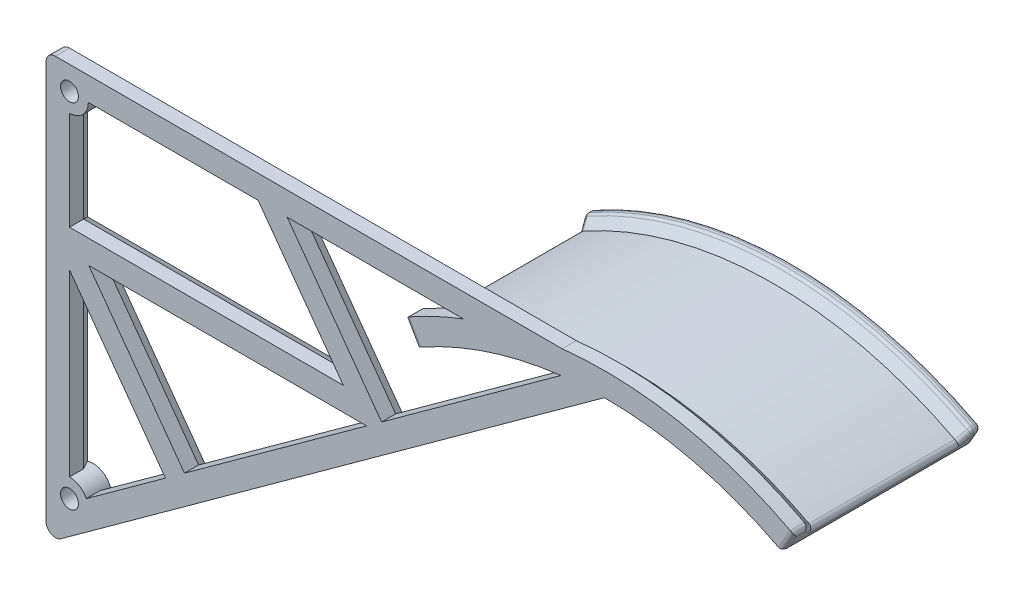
ISO-10303-21;
HEADER;
FILE_DESCRIPTION(('STEP AP214'),'2;1');
FILE_NAME('part.step','',(''),(''),'','','');
FILE_SCHEMA(('AUTOMOTIVE_DESIGN { 1 0 10303 214 1 1 1 1 }'));
ENDSEC;
DATA;
#1=APPLICATION_CONTEXT('core data for automotive mechanical design processes');
#2=APPLICATION_PROTOCOL_DEFINITION('international standard','automotive_design',2000,#1);
#3=PRODUCT_CONTEXT('',#1,'mechanical');
#4=PRODUCT('Part','Part','',(#3));
#5=PRODUCT_RELATED_PRODUCT_CATEGORY('part','',(#4));
#6=PRODUCT_DEFINITION_FORMATION('','',#4);
#7=PRODUCT_DEFINITION_CONTEXT('part definition',#1,'design');
#8=PRODUCT_DEFINITION('design','',#6,#7);
#9=PRODUCT_DEFINITION_SHAPE('','',#8);
#10=(LENGTH_UNIT() NAMED_UNIT(*) SI_UNIT(.MILLI.,.METRE.));
#11=(NAMED_UNIT(*) PLANE_ANGLE_UNIT() SI_UNIT($,.RADIAN.));
#12=(NAMED_UNIT(*) SI_UNIT($,.STERADIAN.) SOLID_ANGLE_UNIT());
#13=UNCERTAINTY_MEASURE_WITH_UNIT(LENGTH_MEASURE(1.E-05),#10,'distance_accuracy_value','');
#14=(GEOMETRIC_REPRESENTATION_CONTEXT(3) GLOBAL_UNCERTAINTY_ASSIGNED_CONTEXT((#13)) GLOBAL_UNIT_ASSIGNED_CONTEXT((#10,
#11,#12)) REPRESENTATION_CONTEXT('',''));
#15=CARTESIAN_POINT('',(0.,0.,0.));
#16=DIRECTION('',(0.,0.,1.));
#17=DIRECTION('',(1.,0.,0.));
#18=AXIS2_PLACEMENT_3D('',#15,#16,#17);
#19=CARTESIAN_POINT('',(0.,0.,0.));
#20=DIRECTION('',(0.,0.,-1.));
#21=DIRECTION('',(-1.,0.,0.));
#22=AXIS2_PLACEMENT_3D('',#19,#20,#21);
#23=PLANE('',#22);
#24=DIRECTION('',(-1.,0.,0.));
#25=VECTOR('',#24,1.);
#26=CARTESIAN_POINT('',(0.,86.7501535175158,0.));
#27=LINE('',#26,#25);
#28=CARTESIAN_POINT('',(45.7087699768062,86.7501535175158,0.));
#29=VERTEX_POINT('',#28);
#30=CARTESIAN_POINT('',(8.82970843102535,86.7501535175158,0.));
#31=VERTEX_POINT('',#30);
#32=EDGE_CURVE('E1322',#29,#31,#27,.T.);
#33=ORIENTED_EDGE('',*,*,#32,.T.);
#34=CARTESIAN_POINT('',(5.,85.5954529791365,0.));
#35=DIRECTION('',(0.,0.,-1.));
#36=DIRECTION('',(1.,0.,0.));
#37=AXIS2_PLACEMENT_3D('',#34,#35,#36);
#38=CIRCLE('',#37,4.);
#39=CARTESIAN_POINT('',(3.84529946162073,81.7657445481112,0.));
#40=VERTEX_POINT('',#39);
#41=EDGE_CURVE('E1172',#31,#40,#38,.T.);
#42=ORIENTED_EDGE('',*,*,#41,.T.);
#43=DIRECTION('',(0.,-1.,0.));
#44=VECTOR('',#43,1.);
#45=CARTESIAN_POINT('',(3.84529946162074,0.,0.));
#46=LINE('',#45,#44);
#47=CARTESIAN_POINT('',(3.84529946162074,59.4407524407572,0.));
#48=VERTEX_POINT('',#47);
#49=EDGE_CURVE('E1313',#40,#48,#46,.T.);
#50=ORIENTED_EDGE('',*,*,#49,.T.);
#51=DIRECTION('',(1.,0.,0.));
#52=VECTOR('',#51,1.);
#53=CARTESIAN_POINT('',(0.,59.4407524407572,0.));
#54=LINE('',#53,#52);
#55=CARTESIAN_POINT('',(65.5016304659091,59.4407524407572,0.));
#56=VERTEX_POINT('',#55);
#57=EDGE_CURVE('E1316',#48,#56,#54,.T.);
#58=ORIENTED_EDGE('',*,*,#57,.T.);
#59=DIRECTION('',(-0.586842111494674,0.809701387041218,0.));
#60=VECTOR('',#59,1.);
#61=CARTESIAN_POINT('',(71.1882153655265,51.5946289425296,0.));
#62=LINE('',#61,#60);
#63=EDGE_CURVE('E1319',#56,#29,#62,.T.);
#64=ORIENTED_EDGE('',*,*,#63,.T.);
#65=EDGE_LOOP('',(#33,#42,#50,#58,#64));
#66=FACE_BOUND('',#65,.T.);
#67=CARTESIAN_POINT('',(118.83240789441,6.08026140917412,0.));
#68=DIRECTION('',(0.,0.,-1.));
#69=DIRECTION('',(1.,0.,0.));
#70=AXIS2_PLACEMENT_3D('',#67,#68,#69);
#71=CIRCLE('',#70,83.);
#72=CARTESIAN_POINT('',(99.3037492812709,86.7501535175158,0.));
#73=VERTEX_POINT('',#72);
#74=CARTESIAN_POINT('',(109.874553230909,88.5954529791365,0.));
#75=VERTEX_POINT('',#74);
#76=EDGE_CURVE('E1607',#73,#75,#71,.T.);
#77=ORIENTED_EDGE('',*,*,#76,.F.);
#78=DIRECTION('',(-1.,0.,0.));
#79=VECTOR('',#78,1.);
#80=CARTESIAN_POINT('',(0.,86.7501535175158,0.));
#81=LINE('',#80,#79);
#82=CARTESIAN_POINT('',(49.0317220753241,86.7501535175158,0.));
#83=VERTEX_POINT('',#82);
#84=EDGE_CURVE('E1337',#73,#83,#81,.T.);
#85=ORIENTED_EDGE('',*,*,#84,.T.);
#86=DIRECTION('',(0.586842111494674,-0.809701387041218,0.));
#87=VECTOR('',#86,1.);
#88=CARTESIAN_POINT('',(73.3667970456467,53.1735856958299,0.));
#89=LINE('',#88,#87);
#90=CARTESIAN_POINT('',(70.7746307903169,56.7501535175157,0.));
#91=VERTEX_POINT('',#90);
#92=EDGE_CURVE('E1331',#83,#91,#89,.T.);
#93=ORIENTED_EDGE('',*,*,#92,.T.);
#94=DIRECTION('',(-1.,0.,0.));
#95=VECTOR('',#94,1.);
#96=CARTESIAN_POINT('',(0.,56.7501535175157,0.));
#97=LINE('',#96,#95);
#98=CARTESIAN_POINT('',(6.83578672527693,56.7501535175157,0.));
#99=VERTEX_POINT('',#98);
#100=EDGE_CURVE('E1325',#91,#99,#97,.T.);
#101=ORIENTED_EDGE('',*,*,#100,.T.);
#102=DIRECTION('',(0.586842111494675,-0.809701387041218,0.));
#103=VECTOR('',#102,1.);
#104=CARTESIAN_POINT('',(31.4474463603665,22.791965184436,0.));
#105=LINE('',#104,#103);
#106=CARTESIAN_POINT('',(29.1908627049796,25.9055094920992,0.));
#107=VERTEX_POINT('',#106);
#108=EDGE_CURVE('E1328',#99,#107,#105,.T.);
#109=ORIENTED_EDGE('',*,*,#108,.T.);
#110=DIRECTION('',(0.809701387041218,0.586842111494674,0.));
#111=VECTOR('',#110,1.);
#112=CARTESIAN_POINT('',(-2.25658365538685,3.11354430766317,0.));
#113=LINE('',#112,#111);
#114=CARTESIAN_POINT('',(71.1102133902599,56.2871300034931,0.));
#115=VERTEX_POINT('',#114);
#116=EDGE_CURVE('E1334',#107,#115,#113,.T.);
#117=ORIENTED_EDGE('',*,*,#116,.T.);
#118=DIRECTION('',(0.809701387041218,0.586842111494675,0.));
#119=VECTOR('',#118,1.);
#120=CARTESIAN_POINT('',(-2.25658365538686,3.11354430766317,0.));
#121=LINE('',#120,#119);
#122=CARTESIAN_POINT('',(71.7490748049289,56.7501535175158,0.));
#123=VERTEX_POINT('',#122);
#124=EDGE_CURVE('E1343',#115,#123,#121,.T.);
#125=ORIENTED_EDGE('',*,*,#124,.T.);
#126=DIRECTION('',(0.809701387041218,0.586842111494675,0.));
#127=VECTOR('',#126,1.);
#128=CARTESIAN_POINT('',(-2.25658365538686,3.11354430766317,0.));
#129=LINE('',#128,#127);
#130=CARTESIAN_POINT('',(111.788942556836,85.7695931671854,0.));
#131=VERTEX_POINT('',#130);
#132=EDGE_CURVE('E1340',#123,#131,#129,.T.);
#133=ORIENTED_EDGE('',*,*,#132,.T.);
#134=CARTESIAN_POINT('',(118.83240789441,6.08026140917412,0.));
#135=DIRECTION('',(0.,0.,-1.));
#136=DIRECTION('',(-1.,0.,0.));
#137=AXIS2_PLACEMENT_3D('',#134,#135,#136);
#138=CIRCLE('',#137,80.);
#139=CARTESIAN_POINT('',(115.251407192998,86.0000739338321,0.));
#140=VERTEX_POINT('',#139);
#141=EDGE_CURVE('E447',#140,#131,#138,.F.);
#142=ORIENTED_EDGE('',*,*,#141,.F.);
#143=DIRECTION('',(-0.809701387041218,-0.586842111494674,0.));
#144=VECTOR('',#143,1.);
#145=CARTESIAN_POINT('',(1.99999999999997,3.9195736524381,0.));
#146=LINE('',#145,#144);
#147=CARTESIAN_POINT('',(2.,3.91957365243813,0.));
#148=VERTEX_POINT('',#147);
#149=EDGE_CURVE('E483',#140,#148,#146,.T.);
#150=ORIENTED_EDGE('',*,*,#149,.T.);
#151=DIRECTION('',(0.,1.,0.));
#152=VECTOR('',#151,1.);
#153=CARTESIAN_POINT('',(1.99999999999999,88.5954529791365,0.));
#154=LINE('',#153,#152);
#155=CARTESIAN_POINT('',(2.,9.34545297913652,0.));
#156=VERTEX_POINT('',#155);
#157=EDGE_CURVE('E480',#148,#156,#154,.T.);
#158=ORIENTED_EDGE('',*,*,#157,.T.);
#159=CARTESIAN_POINT('',(5.00000000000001,10.5954529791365,0.));
#160=DIRECTION('',(0.,0.,-1.));
#161=DIRECTION('',(-1.,0.,0.));
#162=AXIS2_PLACEMENT_3D('',#159,#160,#161);
#163=CIRCLE('',#162,3.25);
#164=CARTESIAN_POINT('',(2.,11.8454529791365,0.));
#165=VERTEX_POINT('',#164);
#166=EDGE_CURVE('E1432',#165,#156,#163,.T.);
#167=ORIENTED_EDGE('',*,*,#166,.F.);
#168=DIRECTION('',(0.,1.,0.));
#169=VECTOR('',#168,1.);
#170=CARTESIAN_POINT('',(1.99999999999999,88.5954529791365,0.));
#171=LINE('',#170,#169);
#172=CARTESIAN_POINT('',(1.99999999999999,84.3454529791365,0.));
#173=VERTEX_POINT('',#172);
#174=EDGE_CURVE('E477',#165,#173,#171,.T.);
#175=ORIENTED_EDGE('',*,*,#174,.T.);
#176=CARTESIAN_POINT('',(5.,85.5954529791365,0.));
#177=DIRECTION('',(0.,0.,-1.));
#178=DIRECTION('',(-1.,0.,0.));
#179=AXIS2_PLACEMENT_3D('',#176,#177,#178);
#180=CIRCLE('',#179,3.25);
#181=CARTESIAN_POINT('',(6.25,88.5954529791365,0.));
#182=VERTEX_POINT('',#181);
#183=EDGE_CURVE('E1136',#182,#173,#180,.T.);
#184=ORIENTED_EDGE('',*,*,#183,.F.);
#185=DIRECTION('',(1.,0.,0.));
#186=VECTOR('',#185,1.);
#187=CARTESIAN_POINT('',(109.766957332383,88.5954529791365,0.));
#188=LINE('',#187,#186);
#189=EDGE_CURVE('E459',#182,#75,#188,.T.);
#190=ORIENTED_EDGE('',*,*,#189,.T.);
#191=EDGE_LOOP('',(#77,#85,#93,#101,#109,#117,#125,#133,#142,#150,#158,#167,#175,#184,#190));
#192=FACE_BOUND('',#191,.T.);
#193=CARTESIAN_POINT('',(5.00000000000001,10.5954529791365,0.));
#194=DIRECTION('',(0.,0.,-1.));
#195=DIRECTION('',(1.,0.,0.));
#196=AXIS2_PLACEMENT_3D('',#193,#194,#195);
#197=CIRCLE('',#196,4.);
#198=CARTESIAN_POINT('',(3.84529946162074,14.4251614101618,0.));
#199=VERTEX_POINT('',#198);
#200=CARTESIAN_POINT('',(8.94859777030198,11.2346522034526,0.));
#201=VERTEX_POINT('',#200);
#202=EDGE_CURVE('E1249',#199,#201,#197,.T.);
#203=ORIENTED_EDGE('',*,*,#202,.T.);
#204=DIRECTION('',(0.809701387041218,0.586842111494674,0.));
#205=VECTOR('',#204,1.);
#206=CARTESIAN_POINT('',(-2.25658365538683,3.11354430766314,0.));
#207=LINE('',#206,#205);
#208=CARTESIAN_POINT('',(27.0122810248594,24.3265527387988,0.));
#209=VERTEX_POINT('',#208);
#210=EDGE_CURVE('E436',#201,#209,#207,.T.);
#211=ORIENTED_EDGE('',*,*,#210,.T.);
#212=DIRECTION('',(-0.586842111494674,0.809701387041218,0.));
#213=VECTOR('',#212,1.);
#214=CARTESIAN_POINT('',(29.2688646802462,21.2130084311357,0.));
#215=LINE('',#214,#213);
#216=CARTESIAN_POINT('',(3.84529946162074,56.2914317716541,0.));
#217=VERTEX_POINT('',#216);
#218=EDGE_CURVE('E1347',#209,#217,#215,.T.);
#219=ORIENTED_EDGE('',*,*,#218,.T.);
#220=DIRECTION('',(0.,-1.,0.));
#221=VECTOR('',#220,1.);
#222=CARTESIAN_POINT('',(3.84529946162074,0.,0.));
#223=LINE('',#222,#221);
#224=EDGE_CURVE('E1350',#217,#199,#223,.T.);
#225=ORIENTED_EDGE('',*,*,#224,.T.);
#226=EDGE_LOOP('',(#203,#211,#219,#225));
#227=FACE_BOUND('',#226,.T.);
#228=ADVANCED_FACE('F41',(#66,#192,#227),#23,.T.);
#229=CARTESIAN_POINT('',(118.83240789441,6.08026140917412,89.3351760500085));
#230=DIRECTION('',(0.,0.,-1.));
#231=DIRECTION('',(-1.,0.,0.));
#232=AXIS2_PLACEMENT_3D('',#229,#230,#231);
#233=CYLINDRICAL_SURFACE('',#232,85.);
#234=DIRECTION('',(0.,0.,-1.));
#235=VECTOR('',#234,1.);
#236=CARTESIAN_POINT('',(77.211754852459,80.1931566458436,89.3351760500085));
#237=LINE('',#236,#235);
#238=CARTESIAN_POINT('',(77.211754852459,80.1931566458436,-34.));
#239=VERTEX_POINT('',#238);
#240=CARTESIAN_POINT('',(77.211754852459,80.1931566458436,-33.414213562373));
#241=VERTEX_POINT('',#240);
#242=EDGE_CURVE('E956',#239,#241,#237,.F.);
#243=ORIENTED_EDGE('',*,*,#242,.T.);
#244=CARTESIAN_POINT('',(118.83240789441,6.08026140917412,-33.414213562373));
#245=DIRECTION('',(0.,0.,-1.));
#246=DIRECTION('',(-1.,0.,0.));
#247=AXIS2_PLACEMENT_3D('',#244,#245,#246);
#248=CIRCLE('',#247,85.);
#249=CARTESIAN_POINT('',(158.270065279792,81.3774803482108,-33.414213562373));
#250=VERTEX_POINT('',#249);
#251=EDGE_CURVE('E962',#241,#250,#248,.T.);
#252=ORIENTED_EDGE('',*,*,#251,.T.);
#253=DIRECTION('',(0.,0.,-1.));
#254=VECTOR('',#253,1.);
#255=CARTESIAN_POINT('',(158.270065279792,81.3774803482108,89.3351760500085));
#256=LINE('',#255,#254);
#257=CARTESIAN_POINT('',(158.270065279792,81.3774803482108,-34.));
#258=VERTEX_POINT('',#257);
#259=EDGE_CURVE('E959',#250,#258,#256,.T.);
#260=ORIENTED_EDGE('',*,*,#259,.T.);
#261=CARTESIAN_POINT('',(118.83240789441,6.08026140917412,-34.));
#262=DIRECTION('',(0.,0.,1.));
#263=DIRECTION('',(1.,0.,0.));
#264=AXIS2_PLACEMENT_3D('',#261,#262,#263);
#265=CIRCLE('',#264,85.);
#266=EDGE_CURVE('E952',#258,#239,#265,.T.);
#267=ORIENTED_EDGE('',*,*,#266,.T.);
#268=EDGE_LOOP('',(#243,#252,#260,#267));
#269=FACE_BOUND('',#268,.T.);
#270=ADVANCED_FACE('F1089',(#269),#233,.T.);
#271=CARTESIAN_POINT('',(118.83240789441,6.08026140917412,5.));
#272=DIRECTION('',(0.,0.,-1.));
#273=DIRECTION('',(-1.,0.,0.));
#274=AXIS2_PLACEMENT_3D('',#271,#272,#273);
#275=CIRCLE('',#274,85.);
#276=CARTESIAN_POINT('',(109.766957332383,90.5954529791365,5.));
#277=VERTEX_POINT('',#276);
#278=CARTESIAN_POINT('',(158.270065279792,81.3774803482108,5.));
#279=VERTEX_POINT('',#278);
#280=EDGE_CURVE('E1670',#277,#279,#275,.T.);
#281=ORIENTED_EDGE('',*,*,#280,.T.);
#282=DIRECTION('',(0.,0.,-1.));
#283=VECTOR('',#282,1.);
#284=CARTESIAN_POINT('',(158.270065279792,81.3774803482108,89.3351760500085));
#285=LINE('',#284,#283);
#286=CARTESIAN_POINT('',(158.270065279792,81.3774803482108,2.00000000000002));
#287=VERTEX_POINT('',#286);
#288=EDGE_CURVE('E1041',#279,#287,#285,.T.);
#289=ORIENTED_EDGE('',*,*,#288,.T.);
#290=CARTESIAN_POINT('',(118.83240789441,6.08026140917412,2.00000000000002));
#291=DIRECTION('',(0.,0.,-1.));
#292=DIRECTION('',(-1.,0.,0.));
#293=AXIS2_PLACEMENT_3D('',#290,#291,#292);
#294=CIRCLE('',#293,85.);
#295=CARTESIAN_POINT('',(109.766957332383,90.5954529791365,2.00000000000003));
#296=VERTEX_POINT('',#295);
#297=EDGE_CURVE('E510',#287,#296,#294,.F.);
#298=ORIENTED_EDGE('',*,*,#297,.T.);
#299=DIRECTION('',(0.,0.,-1.));
#300=VECTOR('',#299,1.);
#301=CARTESIAN_POINT('',(109.766957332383,90.5954529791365,89.3351760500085));
#302=LINE('',#301,#300);
#303=EDGE_CURVE('E1443',#296,#277,#302,.F.);
#304=ORIENTED_EDGE('',*,*,#303,.T.);
#305=EDGE_LOOP('',(#281,#289,#298,#304));
#306=FACE_BOUND('',#305,.T.);
#307=ADVANCED_FACE('F920',(#306),#233,.T.);
#308=CARTESIAN_POINT('',(156.688813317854,76.5564458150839,89.3351760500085));
#309=DIRECTION('',(-0.866025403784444,0.499999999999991,0.));
#310=DIRECTION('',(-0.499999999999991,-0.866025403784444,0.));
#311=AXIS2_PLACEMENT_3D('',#308,#309,#310);
#312=PLANE('',#311);
#313=DIRECTION('',(-0.499999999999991,-0.866025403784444,0.));
#314=VECTOR('',#313,1.);
#315=CARTESIAN_POINT('',(156.688813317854,76.5564458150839,4.));
#316=LINE('',#315,#314);
#317=CARTESIAN_POINT('',(158.672118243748,79.9916307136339,4.));
#318=VERTEX_POINT('',#317);
#319=CARTESIAN_POINT('',(157.170801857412,77.3912744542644,4.));
#320=VERTEX_POINT('',#319);
#321=EDGE_CURVE('E984',#318,#320,#316,.T.);
#322=ORIENTED_EDGE('',*,*,#321,.T.);
#323=DIRECTION('',(0.,0.,1.));
#324=VECTOR('',#323,1.);
#325=CARTESIAN_POINT('',(157.170801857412,77.3912744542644,-35.));
#326=LINE('',#325,#324);
#327=CARTESIAN_POINT('',(157.170801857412,77.3912744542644,-34.));
#328=VERTEX_POINT('',#327);
#329=EDGE_CURVE('E987',#320,#328,#326,.F.);
#330=ORIENTED_EDGE('',*,*,#329,.T.);
#331=DIRECTION('',(0.499999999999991,0.866025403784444,0.));
#332=VECTOR('',#331,1.);
#333=CARTESIAN_POINT('',(156.688813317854,76.5564458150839,-34.));
#334=LINE('',#333,#332);
#335=CARTESIAN_POINT('',(158.672118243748,79.9916307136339,-34.));
#336=VERTEX_POINT('',#335);
#337=EDGE_CURVE('E966',#328,#336,#334,.T.);
#338=ORIENTED_EDGE('',*,*,#337,.T.);
#339=DIRECTION('',(0.,0.,-1.));
#340=VECTOR('',#339,1.);
#341=CARTESIAN_POINT('',(158.672118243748,79.9916307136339,89.3351760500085));
#342=LINE('',#341,#340);
#343=CARTESIAN_POINT('',(158.672118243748,79.9916307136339,-33.414213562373));
#344=VERTEX_POINT('',#343);
#345=EDGE_CURVE('E969',#336,#344,#342,.F.);
#346=ORIENTED_EDGE('',*,*,#345,.T.);
#347=CARTESIAN_POINT('',(192.850816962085,141.222716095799,-102.085067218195));
#348=CARTESIAN_POINT('',(193.736349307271,140.724660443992,-102.073626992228));
#349=CARTESIAN_POINT('',(193.377166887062,140.102538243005,-102.792173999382));
#350=CARTESIAN_POINT('',(189.929761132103,136.164524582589,-96.2455280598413));
#351=CARTESIAN_POINT('',(190.815399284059,135.665426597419,-96.2323429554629));
#352=CARTESIAN_POINT('',(190.456648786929,135.044052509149,-96.9526348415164));
#353=CARTESIAN_POINT('',(187.008620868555,131.106300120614,-90.4060581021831));
#354=CARTESIAN_POINT('',(187.894649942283,130.60654034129,-90.3915172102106));
#355=CARTESIAN_POINT('',(187.536096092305,129.985506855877,-91.1131648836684));
#356=CARTESIAN_POINT('',(181.166038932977,120.989734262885,-78.7273691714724));
#357=CARTESIAN_POINT('',(182.053839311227,120.489959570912,-78.7114419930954));
#358=CARTESIAN_POINT('',(181.69486862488,119.868204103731,-79.4344759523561));
#359=CARTESIAN_POINT('',(178.244597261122,115.931392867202,-72.8881501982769));
#360=CARTESIAN_POINT('',(179.13317281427,115.431216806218,-72.8709824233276));
#361=CARTESIAN_POINT('',(178.774193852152,114.809447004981,-73.5952569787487));
#362=CARTESIAN_POINT('',(172.401281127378,105.814544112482,-61.2100781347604));
#363=CARTESIAN_POINT('',(173.292354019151,105.314621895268,-61.1913791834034));
#364=CARTESIAN_POINT('',(172.932670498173,104.691631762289,-61.9171849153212));
#365=CARTESIAN_POINT('',(169.479406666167,100.756036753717,-55.3712250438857));
#366=CARTESIAN_POINT('',(170.371326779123,100.255254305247,-55.3504862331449));
#367=CARTESIAN_POINT('',(170.011821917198,99.6325736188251,-56.0783318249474));
#368=CARTESIAN_POINT('',(165.096054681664,93.16805790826,-46.6133830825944));
#369=CARTESIAN_POINT('',(165.992176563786,92.6703436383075,-46.5942779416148));
#370=CARTESIAN_POINT('',(165.630328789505,92.0436049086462,-47.3204898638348));
#371=CARTESIAN_POINT('',(163.634846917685,90.6386946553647,-43.6941746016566));
#372=CARTESIAN_POINT('',(164.531800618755,90.140898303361,-43.6742823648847));
#373=CARTESIAN_POINT('',(164.169793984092,89.513884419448,-44.4012813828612));
#374=CARTESIAN_POINT('',(160.712192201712,85.5798714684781,-37.8559518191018));
#375=CARTESIAN_POINT('',(161.611220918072,85.0823058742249,-37.8347900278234));
#376=CARTESIAN_POINT('',(161.248627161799,84.4542750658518,-38.5630586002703));
#377=CARTESIAN_POINT('',(159.250745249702,83.0504115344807,-34.9369375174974));
#378=CARTESIAN_POINT('',(160.150777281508,82.5527432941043,-34.9148137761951));
#379=CARTESIAN_POINT('',(159.787995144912,81.9243862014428,-35.6440442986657));
#380=CARTESIAN_POINT('',(156.327524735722,77.9913528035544,-29.0991610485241));
#381=CARTESIAN_POINT('',(157.230101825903,77.4939850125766,-29.0754912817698));
#382=CARTESIAN_POINT('',(156.866595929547,76.8643743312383,-29.8062678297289));
#383=CARTESIAN_POINT('',(154.865751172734,75.4617540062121,-26.1803988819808));
#384=CARTESIAN_POINT('',(155.769546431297,74.9642288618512,-26.1554983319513));
#385=CARTESIAN_POINT('',(155.405828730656,74.3342513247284,-26.8875056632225));
#386=CARTESIAN_POINT('',(151.941755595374,70.402373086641,-20.3432388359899));
#387=CARTESIAN_POINT('',(152.848726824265,69.9052209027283,-20.3163797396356));
#388=CARTESIAN_POINT('',(152.484113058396,69.2736913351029,-21.050345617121));
#389=CARTESIAN_POINT('',(150.479533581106,67.8725909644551,-17.4248409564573));
#390=CARTESIAN_POINT('',(151.388010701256,67.375186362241,-17.3963510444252));
#391=CARTESIAN_POINT('',(151.023164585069,66.7432543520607,-18.1319477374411));
#392=CARTESIAN_POINT('',(147.554437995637,62.8127601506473,-11.5885790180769));
#393=CARTESIAN_POINT('',(148.467012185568,62.3158685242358,-11.5575711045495));
#394=CARTESIAN_POINT('',(148.10100618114,61.681927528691,-12.2956857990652));
#395=CARTESIAN_POINT('',(146.091564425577,60.282711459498,-8.67071495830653));
#396=CARTESIAN_POINT('',(147.006069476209,59.7854415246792,-8.63750065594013));
#397=CARTESIAN_POINT('',(146.639796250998,59.1510376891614,-9.37782173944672));
#398=CARTESIAN_POINT('',(143.164821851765,55.2221948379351,-2.83578590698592));
#399=CARTESIAN_POINT('',(144.084738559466,54.7255479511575,-2.79908314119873));
#400=CARTESIAN_POINT('',(143.716975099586,54.0885629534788,-3.54289268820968));
#401=CARTESIAN_POINT('',(141.700952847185,52.6917269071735,0.0812790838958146));
#402=CARTESIAN_POINT('',(142.623343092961,52.1943367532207,0.121275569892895));
#403=CARTESIAN_POINT('',(142.255363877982,51.5569780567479,-0.625827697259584));
#404=CARTESIAN_POINT('',(139.503899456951,48.8954843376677,4.45588527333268));
#405=CARTESIAN_POINT('',(140.433836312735,48.4019997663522,4.4958933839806));
#406=CARTESIAN_POINT('',(140.06244367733,47.7587288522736,3.74877849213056));
#407=CARTESIAN_POINT('',(138.77133775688,47.6299761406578,5.91392660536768));
#408=CARTESIAN_POINT('',(139.70323267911,47.1365571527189,5.95550784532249));
#409=CARTESIAN_POINT('',(139.331384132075,46.4924965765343,5.20681982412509));
#410=CARTESIAN_POINT('',(137.30565360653,45.0987169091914,8.82955942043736));
#411=CARTESIAN_POINT('',(138.242183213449,44.6059452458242,8.87408738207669));
#412=CARTESIAN_POINT('',(137.869041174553,43.9596442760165,8.122452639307));
#413=CARTESIAN_POINT('',(136.572531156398,43.8329658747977,10.2871509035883));
#414=CARTESIAN_POINT('',(137.511451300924,43.3402804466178,10.3336232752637));
#415=CARTESIAN_POINT('',(137.137757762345,42.6930242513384,9.58004412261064));
#416=CARTESIAN_POINT('',(135.105520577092,41.3011296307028,13.2017161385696));
#417=CARTESIAN_POINT('',(136.050184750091,40.8092925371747,13.2518514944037));
#418=CARTESIAN_POINT('',(135.674887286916,40.1592582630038,12.4946093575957));
#419=CARTESIAN_POINT('',(134.371632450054,40.0350444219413,14.6586898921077));
#420=CARTESIAN_POINT('',(135.319257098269,39.5432887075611,14.7113275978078));
#421=CARTESIAN_POINT('',(134.943300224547,38.8921123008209,13.9515831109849));
#422=CARTESIAN_POINT('',(132.902763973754,37.5023841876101,17.5717686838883));
#423=CARTESIAN_POINT('',(133.857663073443,37.0117335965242,17.6291319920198));
#424=CARTESIAN_POINT('',(133.479692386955,36.357069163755,16.8646619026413));
#425=CARTESIAN_POINT('',(132.16778362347,36.2358091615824,19.0278737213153));
#426=CARTESIAN_POINT('',(133.126435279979,35.7452099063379,19.0885791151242));
#427=CARTESIAN_POINT('',(132.747671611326,35.089171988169,18.3207669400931));
#428=CARTESIAN_POINT('',(130.696182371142,33.7018978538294,21.9388002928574));
#429=CARTESIAN_POINT('',(131.664378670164,33.2128535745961,22.0057668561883));
#430=CARTESIAN_POINT('',(131.282977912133,32.5522480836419,21.2316935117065));
#431=CARTESIAN_POINT('',(129.959561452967,32.4345615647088,23.3936218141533));
#432=CARTESIAN_POINT('',(130.932704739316,31.9455571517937,23.4651899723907));
#433=CARTESIAN_POINT('',(130.550304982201,31.2832213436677,22.6865150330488));
#434=CARTESIAN_POINT('',(128.483761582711,29.898686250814,26.301233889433));
#435=CARTESIAN_POINT('',(129.469842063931,29.4118046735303,26.3816865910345));
#436=CARTESIAN_POINT('',(129.083955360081,28.743429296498,25.5941271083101));
#437=CARTESIAN_POINT('',(127.744582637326,28.6301472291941,27.7540244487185));
#438=CARTESIAN_POINT('',(128.737316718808,28.1430335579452,27.8414170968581));
#439=CARTESIAN_POINT('',(128.350278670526,27.4726639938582,27.046917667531));
#440=CARTESIAN_POINT('',(126.632446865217,26.7256754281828,29.9305643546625));
#441=CARTESIAN_POINT('',(127.641607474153,26.2452094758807,30.0231653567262));
#442=CARTESIAN_POINT('',(127.248447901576,25.5642371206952,29.2234575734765));
#443=CARTESIAN_POINT('',(126.261171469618,26.0905704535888,30.6556410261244));
#444=CARTESIAN_POINT('',(127.27532129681,25.6107832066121,30.7522154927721));
#445=CARTESIAN_POINT('',(126.880949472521,24.9277111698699,29.9485342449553));
#446=CARTESIAN_POINT('',(125.517056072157,24.819567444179,32.1045595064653));
#447=CARTESIAN_POINT('',(126.542841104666,24.3420902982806,32.2093607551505));
#448=CARTESIAN_POINT('',(126.145345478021,23.6536076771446,31.3974527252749));
#449=CARTESIAN_POINT('',(125.144216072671,24.1836694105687,32.8284013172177));
#450=CARTESIAN_POINT('',(126.176231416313,23.7071036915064,32.9382788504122));
#451=CARTESIAN_POINT('',(125.777239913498,23.016030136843,32.1212945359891));
#452=CARTESIAN_POINT('',(124.396320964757,22.9107084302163,34.2743497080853));
#453=CARTESIAN_POINT('',(125.443079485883,22.437247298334,34.394932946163));
#454=CARTESIAN_POINT('',(125.040170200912,21.7393879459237,33.5672429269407));
#455=CARTESIAN_POINT('',(124.021265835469,22.273645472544,34.9964562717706));
#456=CARTESIAN_POINT('',(125.075943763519,21.8013495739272,35.1238412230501));
#457=CARTESIAN_POINT('',(124.671206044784,21.1003232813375,34.2893494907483));
#458=CARTESIAN_POINT('',(123.456199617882,21.3166910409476,36.077659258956));
#459=CARTESIAN_POINT('',(124.526534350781,20.849744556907,36.2135230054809));
#460=CARTESIAN_POINT('',(124.11680365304,20.1400701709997,35.3705524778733));
#461=CARTESIAN_POINT('',(123.267429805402,20.9974787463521,36.4377350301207));
#462=CARTESIAN_POINT('',(124.342854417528,20.5316015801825,36.5776401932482));
#463=CARTESIAN_POINT('',(123.931843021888,19.8197089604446,35.7306282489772));
#464=CARTESIAN_POINT('',(122.888834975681,20.3584580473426,37.1570531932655));
#465=CARTESIAN_POINT('',(123.975458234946,19.8952527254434,37.3054905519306));
#466=CARTESIAN_POINT('',(123.561516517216,19.178284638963,36.4499464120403));
#467=CARTESIAN_POINT('',(122.69900995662,20.0386496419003,37.5162955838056));
#468=CARTESIAN_POINT('',(123.791597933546,19.5767973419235,37.6695067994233));
#469=CARTESIAN_POINT('',(123.376150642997,18.8572215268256,36.8091888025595));
#470=CARTESIAN_POINT('',(122.508543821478,19.7184720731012,37.8750304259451));
#471=CARTESIAN_POINT('',(123.608192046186,19.2591290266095,38.0323518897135));
#472=CARTESIAN_POINT('',(123.190539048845,18.5357328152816,37.1679236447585));
#473=(BOUNDED_SURFACE() B_SPLINE_SURFACE(3,2,((#347,#348,#349),(#350,#351,#352),(#353,#354,
#355),(#356,#357,#358),(#359,#360,#361),(#362,#363,#364),(#365,#366,#367),(#368,#369,#370),
(#371,#372,#373),(#374,#375,#376),(#377,#378,#379),(#380,#381,#382),(#383,#384,#385),(#386,#387,
#388),(#389,#390,#391),(#392,#393,#394),(#395,#396,#397),(#398,#399,#400),(#401,#402,#403),
(#404,#405,#406),(#407,#408,#409),(#410,#411,#412),(#413,#414,#415),(#416,#417,#418),(#419,#420,
#421),(#422,#423,#424),(#425,#426,#427),(#428,#429,#430),(#431,#432,#433),(#434,#435,#436),
(#437,#438,#439),(#440,#441,#442),(#443,#444,#445),(#446,#447,#448),(#449,#450,#451),(#452,#453,
#454),(#455,#456,#457),(#458,#459,#460),(#461,#462,#463),(#464,#465,#466),(#467,#468,#469),
(#470,#471,#472)),.UNSPECIFIED.,.F.,.F.,.F.) B_SPLINE_SURFACE_WITH_KNOTS((4,2,2,2,2,2,2,2,2,2,2,
2,2,2,2,2,2,2,2,2,4),(3,3),(0.,24.778242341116,49.5564703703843,74.3346599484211,
86.7237612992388,99.1128634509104,111.502004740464,123.891143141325,136.280259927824,
148.669387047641,154.863988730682,161.058588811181,167.253171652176,173.447760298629,
179.642410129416,185.83704375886,188.934397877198,192.031747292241,195.129125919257,
196.677823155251,198.226523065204),(0.,1.),
.UNSPECIFIED.) GEOMETRIC_REPRESENTATION_ITEM() RATIONAL_B_SPLINE_SURFACE(((1.,0.70145515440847,
1.),(1.,0.701236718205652,1.),(1.,0.700998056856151,1.),(1.,0.700448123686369,1.),(1.,
0.700136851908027,1.),(1.,0.699409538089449,1.),(1.,0.698993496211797,1.),(1.,0.698240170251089,
1.),(1.,0.697967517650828,1.),(1.,0.697364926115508,1.),(1.,0.697034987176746,1.),(1.,
0.696297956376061,1.),(1.,0.695890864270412,1.),(1.,0.694969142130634,1.),(1.,0.694454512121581,
1.),(1.,0.693268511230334,1.),(1.,0.692597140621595,1.),(1.,0.691016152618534,1.),(1.,
0.690106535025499,1.),(1.,0.688443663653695,1.),(1.,0.687839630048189,1.),(1.,0.686497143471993,
1.),(1.,0.685758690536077,1.),(1.,0.684097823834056,1.),(1.,0.683175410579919,1.),(1.,
0.681069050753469,1.),(1.,0.679885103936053,1.),(1.,0.67712593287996,1.),(1.,0.675550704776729,
1.),(1.,0.671787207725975,1.),(1.,0.669598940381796,1.),(1.,0.665511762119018,1.),(1.,
0.664015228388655,1.),(1.,0.660647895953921,1.),(1.,0.65877709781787,1.),(1.,0.654507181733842,
1.),(1.,0.652108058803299,1.),(1.,0.647917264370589,1.),(1.,0.646421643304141,1.),(1.,
0.643179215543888,1.),(1.,0.641432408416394,1.),(1.,0.639533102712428,1.))) REPRESENTATION_ITEM('') SURFACE());
#474=CARTESIAN_POINT('',(193.377166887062,140.102538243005,-102.792173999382));
#475=CARTESIAN_POINT('',(190.456648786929,135.044052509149,-96.9526348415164));
#476=CARTESIAN_POINT('',(187.536096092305,129.985506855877,-91.1131648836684));
#477=CARTESIAN_POINT('',(181.69486862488,119.868204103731,-79.4344759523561));
#478=CARTESIAN_POINT('',(178.774193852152,114.809447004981,-73.5952569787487));
#479=CARTESIAN_POINT('',(172.932670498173,104.691631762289,-61.9171849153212));
#480=CARTESIAN_POINT('',(170.011821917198,99.6325736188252,-56.0783318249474));
#481=CARTESIAN_POINT('',(165.630328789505,92.0436049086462,-47.3204898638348));
#482=CARTESIAN_POINT('',(164.169793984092,89.513884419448,-44.4012813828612));
#483=CARTESIAN_POINT('',(161.248627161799,84.4542750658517,-38.5630586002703));
#484=CARTESIAN_POINT('',(159.787995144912,81.9243862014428,-35.6440442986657));
#485=CARTESIAN_POINT('',(156.866595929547,76.8643743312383,-29.8062678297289));
#486=CARTESIAN_POINT('',(155.405828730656,74.3342513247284,-26.8875056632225));
#487=CARTESIAN_POINT('',(152.484113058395,69.2736913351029,-21.050345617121));
#488=CARTESIAN_POINT('',(151.023164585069,66.7432543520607,-18.1319477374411));
#489=CARTESIAN_POINT('',(148.10100618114,61.681927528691,-12.2956857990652));
#490=CARTESIAN_POINT('',(146.639796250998,59.1510376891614,-9.37782173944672));
#491=CARTESIAN_POINT('',(143.716975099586,54.0885629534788,-3.54289268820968));
#492=CARTESIAN_POINT('',(142.255363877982,51.5569780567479,-0.625827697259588));
#493=CARTESIAN_POINT('',(140.06244367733,47.7587288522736,3.74877849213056));
#494=CARTESIAN_POINT('',(139.331384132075,46.4924965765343,5.2068198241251));
#495=CARTESIAN_POINT('',(137.869041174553,43.9596442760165,8.122452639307));
#496=CARTESIAN_POINT('',(137.137757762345,42.6930242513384,9.58004412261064));
#497=CARTESIAN_POINT('',(135.674887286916,40.1592582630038,12.4946093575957));
#498=CARTESIAN_POINT('',(134.943300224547,38.8921123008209,13.9515831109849));
#499=CARTESIAN_POINT('',(133.479692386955,36.357069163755,16.8646619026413));
#500=CARTESIAN_POINT('',(132.747671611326,35.089171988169,18.3207669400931));
#501=CARTESIAN_POINT('',(131.282977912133,32.5522480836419,21.2316935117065));
#502=CARTESIAN_POINT('',(130.550304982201,31.2832213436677,22.6865150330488));
#503=CARTESIAN_POINT('',(129.083955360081,28.743429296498,25.5941271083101));
#504=CARTESIAN_POINT('',(128.350278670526,27.4726639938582,27.046917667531));
#505=CARTESIAN_POINT('',(127.248447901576,25.5642371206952,29.2234575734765));
#506=CARTESIAN_POINT('',(126.880949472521,24.9277111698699,29.9485342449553));
#507=CARTESIAN_POINT('',(126.145345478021,23.6536076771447,31.3974527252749));
#508=CARTESIAN_POINT('',(125.777239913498,23.016030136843,32.1212945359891));
#509=CARTESIAN_POINT('',(125.040170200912,21.7393879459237,33.5672429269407));
#510=CARTESIAN_POINT('',(124.671206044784,21.1003232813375,34.2893494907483));
#511=CARTESIAN_POINT('',(124.11680365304,20.1400701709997,35.3705524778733));
#512=CARTESIAN_POINT('',(123.931843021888,19.8197089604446,35.7306282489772));
#513=CARTESIAN_POINT('',(123.561516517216,19.178284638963,36.4499464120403));
#514=CARTESIAN_POINT('',(123.376150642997,18.8572215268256,36.8091888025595));
#515=CARTESIAN_POINT('',(123.190539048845,18.5357328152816,37.1679236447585));
#516=B_SPLINE_CURVE_WITH_KNOTS('',3,(#474,#475,#476,#477,#478,#479,#480,#481,#482,#483,#484,
#485,#486,#487,#488,#489,#490,#491,#492,#493,#494,#495,#496,#497,#498,#499,#500,#501,#502,#503,
#504,#505,#506,#507,#508,#509,#510,#511,#512,#513,#514,#515),.UNSPECIFIED.,.F.,.F.,(4,2,2,2,2,2,
2,2,2,2,2,2,2,2,2,2,2,2,2,2,4),(0.,24.778242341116,49.5564703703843,74.3346599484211,
86.7237612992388,99.1128634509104,111.502004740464,123.891143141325,136.280259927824,
148.669387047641,154.863988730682,161.058588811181,167.253171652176,173.447760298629,
179.642410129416,185.83704375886,188.934397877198,192.031747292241,195.129125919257,
196.677823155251,198.226523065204),.UNSPECIFIED.);
#517=CARTESIAN_POINT('',(157.671251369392,78.2580784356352,-31.4142135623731));
#518=VERTEX_POINT('',#517);
#519=EDGE_CURVE('E971',#344,#518,#516,.T.);
#520=ORIENTED_EDGE('',*,*,#519,.T.);
#521=DIRECTION('',(0.,0.,1.));
#522=VECTOR('',#521,1.);
#523=CARTESIAN_POINT('',(157.671251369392,78.2580784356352,89.3351760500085));
#524=LINE('',#523,#522);
#525=CARTESIAN_POINT('',(157.671251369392,78.2580784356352,0.41421356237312));
#526=VERTEX_POINT('',#525);
#527=EDGE_CURVE('E977',#518,#526,#524,.T.);
#528=ORIENTED_EDGE('',*,*,#527,.T.);
#529=CARTESIAN_POINT('',(183.664743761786,123.280127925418,52.3729663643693));
#530=CARTESIAN_POINT('',(184.024742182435,123.903663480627,51.6527301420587));
#531=CARTESIAN_POINT('',(183.136367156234,124.401411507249,51.6658595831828));
#532=CARTESIAN_POINT('',(181.553501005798,119.623348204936,48.1518926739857));
#533=CARTESIAN_POINT('',(181.913201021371,120.246366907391,47.4302270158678));
#534=CARTESIAN_POINT('',(181.024616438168,120.74490766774,47.444785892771));
#535=CARTESIAN_POINT('',(179.442229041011,115.966517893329,43.9308774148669));
#536=CARTESIAN_POINT('',(179.801930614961,116.589539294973,43.2083130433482));
#537=CARTESIAN_POINT('',(178.91279428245,117.088375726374,43.2237706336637));
#538=CARTESIAN_POINT('',(175.219594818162,108.652700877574,35.4890278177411));
#539=CARTESIAN_POINT('',(175.579728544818,109.276470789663,34.7653081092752));
#540=CARTESIAN_POINT('',(174.688928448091,109.775223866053,34.7819210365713));
#541=CARTESIAN_POINT('',(173.108232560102,104.995714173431,31.2681934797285));
#542=CARTESIAN_POINT('',(173.468476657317,105.619675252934,30.5435769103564));
#543=CARTESIAN_POINT('',(172.576884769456,106.118603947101,30.5610866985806));
#544=CARTESIAN_POINT('',(168.885386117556,97.681529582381,22.8267702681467));
#545=CARTESIAN_POINT('',(169.246257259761,98.3065767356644,22.1008795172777));
#546=CARTESIAN_POINT('',(168.352497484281,98.8052447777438,22.1196634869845));
#547=CARTESIAN_POINT('',(166.773901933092,94.0243316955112,18.6061813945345));
#548=CARTESIAN_POINT('',(167.134855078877,94.6495208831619,17.8790443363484));
#549=CARTESIAN_POINT('',(166.240153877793,95.1485055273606,17.8990746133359));
#550=CARTESIAN_POINT('',(162.55075622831,86.7096287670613,10.1653582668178));
#551=CARTESIAN_POINT('',(162.912478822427,87.3361506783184,9.43651283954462));
#552=CARTESIAN_POINT('',(162.015030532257,87.8348514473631,9.45825148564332));
#553=CARTESIAN_POINT('',(160.439094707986,83.0521237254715,5.9451240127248));
#554=CARTESIAN_POINT('',(160.800872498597,83.6787412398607,5.21455268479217));
#555=CARTESIAN_POINT('',(159.902250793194,84.177936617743,5.23801723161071));
#556=CARTESIAN_POINT('',(156.215500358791,75.7366437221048,-2.49480390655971));
#557=CARTESIAN_POINT('',(156.578326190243,76.365076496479,-3.22760729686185));
#558=CARTESIAN_POINT('',(155.676023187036,76.8638346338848,-3.20191068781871));
#559=CARTESIAN_POINT('',(154.10356752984,72.0786687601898,-6.71449757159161));
#560=CARTESIAN_POINT('',(154.466416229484,72.7071411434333,-7.44974574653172));
#561=CARTESIAN_POINT('',(153.562575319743,73.2066474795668,-7.42160435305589));
#562=CARTESIAN_POINT('',(149.879267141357,64.7619658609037,-15.1530138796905));
#563=CARTESIAN_POINT('',(150.243457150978,65.3927614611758,-15.8916203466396));
#564=CARTESIAN_POINT('',(149.334604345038,65.8918315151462,-15.860120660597));
#565=CARTESIAN_POINT('',(147.766899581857,61.1032379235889,-19.3718365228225));
#566=CARTESIAN_POINT('',(148.130839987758,61.7336011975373,-20.1144896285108));
#567=CARTESIAN_POINT('',(147.220081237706,62.2342027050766,-20.0789433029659));
#568=CARTESIAN_POINT('',(144.597751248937,55.614111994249,-25.6988757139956));
#569=CARTESIAN_POINT('',(144.965908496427,56.2517790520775,-26.439892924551));
#570=CARTESIAN_POINT('',(144.0468139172,56.7471378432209,-26.4059824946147));
#571=CARTESIAN_POINT('',(143.541268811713,53.7842307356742,-27.8076899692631));
#572=CARTESIAN_POINT('',(143.909789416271,54.4225271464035,-28.550489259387));
#573=CARTESIAN_POINT('',(142.988810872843,54.9180123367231,-28.5147967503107));
#574=CARTESIAN_POINT('',(141.428017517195,50.1239721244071,-32.02474417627));
#575=CARTESIAN_POINT('',(141.797883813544,50.7645993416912,-32.7705820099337));
#576=CARTESIAN_POINT('',(140.872090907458,51.2594581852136,-32.7318509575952));
#577=CARTESIAN_POINT('',(140.371248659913,48.2935947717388,-34.1329841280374));
#578=CARTESIAN_POINT('',(140.741573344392,48.9350159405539,-34.881124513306));
#579=CARTESIAN_POINT('',(139.813373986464,49.4300295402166,-34.8400909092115));
#580=CARTESIAN_POINT('',(138.25729140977,44.6321134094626,-38.3486238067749));
#581=CARTESIAN_POINT('',(138.629357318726,45.2765504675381,-39.1007720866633));
#582=CARTESIAN_POINT('',(137.694891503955,45.7707197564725,-39.0557305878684));
#583=CARTESIAN_POINT('',(137.200103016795,42.8010093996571,-40.4560235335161));
#584=CARTESIAN_POINT('',(137.572679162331,43.4463302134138,-41.2114189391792));
#585=CARTESIAN_POINT('',(136.635125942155,43.9408386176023,-41.1631303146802));
#586=CARTESIAN_POINT('',(135.613825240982,40.0534956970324,-43.6161292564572));
#587=CARTESIAN_POINT('',(135.989623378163,40.7043971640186,-44.3727451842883));
#588=CARTESIAN_POINT('',(135.04423374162,41.1954690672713,-44.3232360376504));
#589=CARTESIAN_POINT('',(135.084983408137,39.1375147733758,-44.6693322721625));
#590=CARTESIAN_POINT('',(135.461321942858,39.7893522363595,-45.4276292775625));
#591=CARTESIAN_POINT('',(134.513728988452,40.2802545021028,-45.3764390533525));
#592=CARTESIAN_POINT('',(134.027080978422,37.3051740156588,-46.7752988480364));
#593=CARTESIAN_POINT('',(134.404854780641,37.9594974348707,-47.5368103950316));
#594=CARTESIAN_POINT('',(133.452168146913,38.4495785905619,-47.4824056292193));
#595=CARTESIAN_POINT('',(133.498020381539,36.3888141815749,-47.8280624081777));
#596=CARTESIAN_POINT('',(133.876484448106,37.0443331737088,-48.5915152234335));
#597=CARTESIAN_POINT('',(132.921112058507,37.5341172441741,-48.5351691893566));
#598=CARTESIAN_POINT('',(132.968823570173,35.4722184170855,-48.8805521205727));
#599=CARTESIAN_POINT('',(133.348769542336,36.1303041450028,-49.6447162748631));
#600=CARTESIAN_POINT('',(132.389711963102,36.6185004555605,-49.5876589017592));
#601=(BOUNDED_SURFACE() B_SPLINE_SURFACE(3,2,((#529,#530,#531),(#532,#533,#534),(#535,#536,
#537),(#538,#539,#540),(#541,#542,#543),(#544,#545,#546),(#547,#548,#549),(#550,#551,#552),
(#553,#554,#555),(#556,#557,#558),(#559,#560,#561),(#562,#563,#564),(#565,#566,#567),(#568,#569,
#570),(#571,#572,#573),(#574,#575,#576),(#577,#578,#579),(#580,#581,#582),(#583,#584,#585),
(#586,#587,#588),(#589,#590,#591),(#592,#593,#594),(#595,#596,#597),(#598,#599,#600)),
.UNSPECIFIED.,.F.,.F.,.F.) B_SPLINE_SURFACE_WITH_KNOTS((4,2,2,2,2,2,2,2,2,2,2,4),(3,3),(0.,
17.9114941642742,35.8229877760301,53.7344782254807,71.6459692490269,89.5574655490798,
107.468960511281,116.424710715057,125.380460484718,134.3362126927,138.814089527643,
143.29196664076),(0.,1.),
.UNSPECIFIED.) GEOMETRIC_REPRESENTATION_ITEM() RATIONAL_B_SPLINE_SURFACE(((1.,0.700632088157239,
1.),(1.,0.700425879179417,1.),(1.,0.700202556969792,1.),(1.,0.699702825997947,1.),(1.,
0.699426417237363,1.),(1.,0.698801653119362,1.),(1.,0.698453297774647,1.),(1.,0.697652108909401,
1.),(1.,0.697199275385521,1.),(1.,0.696133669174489,1.),(1.,0.69552089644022,1.),(1.,
0.694037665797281,1.),(1.,0.693167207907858,1.),(1.,0.691506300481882,1.),(1.,0.690893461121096,
1.),(1.,0.689496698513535,1.),(1.,0.688712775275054,1.),(1.,0.686893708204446,1.),(1.,
0.685858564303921,1.),(1.,0.684007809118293,1.),(1.,0.683341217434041,1.),(1.,0.681875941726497,
1.),(1.,0.681077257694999,1.),(1.,0.680196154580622,1.))) REPRESENTATION_ITEM('') SURFACE());
#602=CARTESIAN_POINT('',(132.968823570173,35.4722184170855,-48.8805521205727));
#603=CARTESIAN_POINT('',(133.498020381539,36.3888141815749,-47.8280624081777));
#604=CARTESIAN_POINT('',(134.027080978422,37.3051740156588,-46.7752988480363));
#605=CARTESIAN_POINT('',(135.084983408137,39.1375147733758,-44.6693322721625));
#606=CARTESIAN_POINT('',(135.613825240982,40.0534956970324,-43.6161292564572));
#607=CARTESIAN_POINT('',(137.200103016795,42.8010093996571,-40.4560235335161));
#608=CARTESIAN_POINT('',(138.25729140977,44.6321134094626,-38.3486238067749));
#609=CARTESIAN_POINT('',(140.371248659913,48.2935947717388,-34.1329841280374));
#610=CARTESIAN_POINT('',(141.428017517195,50.1239721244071,-32.02474417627));
#611=CARTESIAN_POINT('',(143.541268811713,53.7842307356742,-27.8076899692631));
#612=CARTESIAN_POINT('',(144.597751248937,55.614111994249,-25.6988757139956));
#613=CARTESIAN_POINT('',(147.766899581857,61.1032379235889,-19.3718365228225));
#614=CARTESIAN_POINT('',(149.879267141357,64.7619658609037,-15.1530138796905));
#615=CARTESIAN_POINT('',(154.10356752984,72.0786687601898,-6.71449757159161));
#616=CARTESIAN_POINT('',(156.215500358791,75.7366437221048,-2.49480390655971));
#617=CARTESIAN_POINT('',(160.439094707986,83.0521237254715,5.9451240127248));
#618=CARTESIAN_POINT('',(162.55075622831,86.7096287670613,10.1653582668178));
#619=CARTESIAN_POINT('',(166.773901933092,94.0243316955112,18.6061813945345));
#620=CARTESIAN_POINT('',(168.885386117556,97.681529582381,22.8267702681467));
#621=CARTESIAN_POINT('',(173.108232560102,104.995714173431,31.2681934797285));
#622=CARTESIAN_POINT('',(175.219594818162,108.652700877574,35.4890278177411));
#623=CARTESIAN_POINT('',(179.442229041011,115.966517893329,43.9308774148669));
#624=CARTESIAN_POINT('',(181.553501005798,119.623348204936,48.1518926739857));
#625=CARTESIAN_POINT('',(183.664743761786,123.280127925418,52.3729663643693));
#626=B_SPLINE_CURVE_WITH_KNOTS('',3,(#602,#603,#604,#605,#606,#607,#608,#609,#610,#611,#612,
#613,#614,#615,#616,#617,#618,#619,#620,#621,#622,#623,#624,#625),.UNSPECIFIED.,.F.,.F.,(4,2,2,
2,2,2,2,2,2,2,2,4),(0.,4.47787711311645,8.95575394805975,17.9115061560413,26.8672559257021,
35.8230061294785,53.7345010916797,71.6459973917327,89.5574884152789,107.468978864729,
125.380472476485,143.29196664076),.UNSPECIFIED.);
#627=CARTESIAN_POINT('',(158.672118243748,79.9916307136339,2.41421356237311));
#628=VERTEX_POINT('',#627);
#629=EDGE_CURVE('E926',#526,#628,#626,.T.);
#630=ORIENTED_EDGE('',*,*,#629,.T.);
#631=DIRECTION('',(0.,0.,-1.));
#632=VECTOR('',#631,1.);
#633=CARTESIAN_POINT('',(158.672118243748,79.9916307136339,89.3351760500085));
#634=LINE('',#633,#632);
#635=EDGE_CURVE('E981',#628,#318,#634,.F.);
#636=ORIENTED_EDGE('',*,*,#635,.T.);
#637=EDGE_LOOP('',(#322,#330,#338,#346,#520,#528,#630,#636));
#638=FACE_BOUND('',#637,.T.);
#639=ADVANCED_FACE('F916',(#638),#312,.F.);
#640=CARTESIAN_POINT('',(78.8324078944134,75.3622937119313,89.3351760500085));
#641=DIRECTION('',(-0.866025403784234,-0.500000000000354,0.));
#642=DIRECTION('',(0.500000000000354,-0.866025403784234,0.));
#643=AXIS2_PLACEMENT_3D('',#640,#641,#642);
#644=PLANE('',#643);
#645=DIRECTION('',(0.,0.,-1.));
#646=VECTOR('',#645,1.);
#647=CARTESIAN_POINT('',(77.8354567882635,77.0890636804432,-31.));
#648=LINE('',#647,#646);
#649=CARTESIAN_POINT('',(77.8354567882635,77.0890636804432,0.414213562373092));
#650=VERTEX_POINT('',#649);
#651=CARTESIAN_POINT('',(77.8354567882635,77.0890636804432,-31.4142135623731));
#652=VERTEX_POINT('',#651);
#653=EDGE_CURVE('E1069',#650,#652,#648,.T.);
#654=ORIENTED_EDGE('',*,*,#653,.T.);
#655=CARTESIAN_POINT('',(42.0637300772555,139.047511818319,-102.954825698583));
#656=CARTESIAN_POINT('',(41.7085484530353,139.662704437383,-102.244447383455));
#657=CARTESIAN_POINT('',(42.5801979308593,140.162173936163,-102.247718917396));
#658=CARTESIAN_POINT('',(44.9906818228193,133.977882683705,-97.1010477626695));
#659=CARTESIAN_POINT('',(44.6356220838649,134.592864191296,-96.3901733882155));
#660=CARTESIAN_POINT('',(45.5073040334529,135.092632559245,-96.3939409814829));
#661=CARTESIAN_POINT('',(47.9176364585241,128.90824854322,-91.247275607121));
#662=CARTESIAN_POINT('',(47.5626330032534,129.523132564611,-90.5360131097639));
#663=CARTESIAN_POINT('',(48.4344272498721,130.023094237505,-90.5401688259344));
#664=CARTESIAN_POINT('',(53.7715561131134,118.768962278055,-79.5397521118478));
#665=CARTESIAN_POINT('',(53.4164327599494,119.384053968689,-78.8280945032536));
#666=CARTESIAN_POINT('',(54.288735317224,119.884028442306,-78.8326453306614));
#667=CARTESIAN_POINT('',(56.6985211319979,113.699310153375,-73.686000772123));
#668=CARTESIAN_POINT('',(56.3433948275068,114.314406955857,-72.9739896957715));
#669=CARTESIAN_POINT('',(57.2159201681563,114.814500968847,-72.9788939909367));
#670=CARTESIAN_POINT('',(62.5524661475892,103.559979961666,-61.978528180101));
#671=CARTESIAN_POINT('',(62.1971324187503,104.175436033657,-61.2660920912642));
#672=CARTESIAN_POINT('',(63.0703789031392,104.675461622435,-61.271421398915));
#673=CARTESIAN_POINT('',(65.4794461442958,98.490301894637,-56.1248069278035));
#674=CARTESIAN_POINT('',(65.1241583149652,99.1056784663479,-55.4117985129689));
#675=CARTESIAN_POINT('',(65.9976527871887,99.6059497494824,-55.4177001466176));
#676=CARTESIAN_POINT('',(71.3334306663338,88.3509032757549,-44.4174134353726));
#677=CARTESIAN_POINT('',(70.9778536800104,88.9667806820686,-43.7038241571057));
#678=CARTESIAN_POINT('',(71.8523462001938,89.4669510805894,-43.7103066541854));
#679=CARTESIAN_POINT('',(74.2604351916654,83.2811827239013,-38.5637411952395));
#680=CARTESIAN_POINT('',(73.9049326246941,83.8969312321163,-37.8493243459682));
#681=CARTESIAN_POINT('',(74.7797657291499,84.3974642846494,-37.8566344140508));
#682=CARTESIAN_POINT('',(80.1144862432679,73.1416688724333,-26.8564804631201));
#683=CARTESIAN_POINT('',(79.758635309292,73.7580207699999,-26.1410633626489));
#684=CARTESIAN_POINT('',(80.6348542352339,74.2585330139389,-26.1493736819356));
#685=CARTESIAN_POINT('',(83.0415327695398,68.0718755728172,-21.0028919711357));
#686=CARTESIAN_POINT('',(82.6859606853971,68.6877444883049,-20.2858987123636));
#687=CARTESIAN_POINT('',(83.5625232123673,69.1890885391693,-20.2957851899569));
#688=CARTESIAN_POINT('',(87.432167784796,60.4670726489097,-12.2226397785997));
#689=CARTESIAN_POINT('',(87.0749832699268,61.0857343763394,-11.5068140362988));
#690=CARTESIAN_POINT('',(87.9544155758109,61.5849862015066,-11.5155329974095));
#691=CARTESIAN_POINT('',(88.8957236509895,57.9321195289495,-9.29591082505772));
#692=CARTESIAN_POINT('',(88.5384688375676,58.5509030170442,-8.57945137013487));
#693=CARTESIAN_POINT('',(89.4184445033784,59.0502961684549,-8.58880404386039));
#694=CARTESIAN_POINT('',(91.8228693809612,52.8621544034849,-3.44252088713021));
#695=CARTESIAN_POINT('',(91.4651829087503,53.4816855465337,-2.72509934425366));
#696=CARTESIAN_POINT('',(92.3467052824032,53.9809490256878,-2.73541410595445));
#697=CARTESIAN_POINT('',(93.2864592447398,50.32714239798,-0.5158599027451));
#698=CARTESIAN_POINT('',(92.9286970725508,50.946804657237,0.202461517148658));
#699=CARTESIAN_POINT('',(93.8109371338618,51.4462919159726,0.191246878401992));
#700=CARTESIAN_POINT('',(96.2136951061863,45.2570211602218,5.33735002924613));
#701=CARTESIAN_POINT('',(95.8552963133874,45.8777860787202,6.05695884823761));
#702=CARTESIAN_POINT('',(96.739736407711,46.3770304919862,6.04445681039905));
#703=CARTESIAN_POINT('',(97.6773411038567,42.7219119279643,8.26389897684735));
#704=CARTESIAN_POINT('',(97.3188539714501,43.3428298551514,8.98484090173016));
#705=CARTESIAN_POINT('',(98.2043038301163,43.8424261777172,8.97100575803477));
#706=CARTESIAN_POINT('',(100.604731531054,37.6515229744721,14.1167998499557));
#707=CARTESIAN_POINT('',(100.245399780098,38.2739038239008,14.8398797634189));
#708=CARTESIAN_POINT('',(101.134029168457,38.7733079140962,14.8239066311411));
#709=CARTESIAN_POINT('',(102.06847596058,35.1162432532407,17.0431517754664));
#710=CARTESIAN_POINT('',(101.709220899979,35.7384912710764,17.768703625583));
#711=CARTESIAN_POINT('',(102.599187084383,36.2387939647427,17.7502585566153));
#712=CARTESIAN_POINT('',(104.264253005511,31.3130458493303,21.4323589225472));
#713=CARTESIAN_POINT('',(103.902543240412,31.939545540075,22.157802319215));
#714=CARTESIAN_POINT('',(104.797890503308,32.4371607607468,22.1394657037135));
#715=CARTESIAN_POINT('',(104.996205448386,30.0452670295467,22.8953745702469));
#716=CARTESIAN_POINT('',(104.634210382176,30.672260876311,23.6220696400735));
#717=CARTESIAN_POINT('',(105.530952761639,31.1699725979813,23.602481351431));
#718=CARTESIAN_POINT('',(106.460197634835,27.5095581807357,25.8212310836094));
#719=CARTESIAN_POINT('',(106.097151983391,28.1383716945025,26.5501953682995));
#720=CARTESIAN_POINT('',(106.997605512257,28.6356674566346,26.5283378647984));
#721=CARTESIAN_POINT('',(107.192237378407,26.2416281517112,27.2840719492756));
#722=CARTESIAN_POINT('',(106.828799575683,26.8711208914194,28.0148011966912));
#723=CARTESIAN_POINT('',(107.731196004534,27.3685504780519,27.9911787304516));
#724=CARTESIAN_POINT('',(108.656464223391,23.7055128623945,30.2094589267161));
#725=CARTESIAN_POINT('',(108.291537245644,24.3375849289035,30.9435414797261));
#726=CARTESIAN_POINT('',(109.199271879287,24.8344289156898,30.9165657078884));
#727=CARTESIAN_POINT('',(109.388651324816,22.4373276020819,31.6720050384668));
#728=CARTESIAN_POINT('',(109.023260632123,23.0702028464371,32.4089454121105));
#729=CARTESIAN_POINT('',(109.933757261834,23.5674243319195,32.3791118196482));
#730=CARTESIAN_POINT('',(110.487148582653,20.5346745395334,33.8653904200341));
#731=CARTESIAN_POINT('',(110.118995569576,21.1723342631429,34.6043130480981));
#732=CARTESIAN_POINT('',(111.036809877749,21.6670643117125,34.5724972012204));
#733=CARTESIAN_POINT('',(110.853350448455,19.9003943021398,34.5964466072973));
#734=CARTESIAN_POINT('',(110.484651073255,20.5390003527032,35.3370870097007));
#735=CARTESIAN_POINT('',(111.404714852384,21.0336354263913,35.3035533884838));
#736=CARTESIAN_POINT('',(111.585869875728,18.6316334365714,36.0583271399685));
#737=CARTESIAN_POINT('',(111.215548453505,19.2730489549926,36.8023329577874));
#738=CARTESIAN_POINT('',(112.141236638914,19.7668462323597,36.7654339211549));
#739=CARTESIAN_POINT('',(111.952187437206,17.9971528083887,36.7891514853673));
#740=CARTESIAN_POINT('',(111.581042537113,18.6399946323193,37.5353117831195));
#741=CARTESIAN_POINT('',(112.509853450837,19.133485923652,37.4962582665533));
#742=CARTESIAN_POINT('',(112.318584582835,17.3625343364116,37.5198162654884));
#743=CARTESIAN_POINT('',(111.94589912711,18.0080444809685,38.2673798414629));
#744=CARTESIAN_POINT('',(112.878961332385,18.5001697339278,38.226923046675));
#745=(BOUNDED_SURFACE() B_SPLINE_SURFACE(3,2,((#655,#656,#657),(#658,#659,#660),(#661,#662,
#663),(#664,#665,#666),(#667,#668,#669),(#670,#671,#672),(#673,#674,#675),(#676,#677,#678),
(#679,#680,#681),(#682,#683,#684),(#685,#686,#687),(#688,#689,#690),(#691,#692,#693),(#694,#695,
#696),(#697,#698,#699),(#700,#701,#702),(#703,#704,#705),(#706,#707,#708),(#709,#710,#711),
(#712,#713,#714),(#715,#716,#717),(#718,#719,#720),(#721,#722,#723),(#724,#725,#726),(#727,#728,
#729),(#730,#731,#732),(#733,#734,#735),(#736,#737,#738),(#739,#740,#741),(#742,#743,#744)),
.UNSPECIFIED.,.F.,.F.,.F.) B_SPLINE_SURFACE_WITH_KNOTS((4,2,2,2,2,2,2,2,2,2,2,2,2,2,4),(3,3),
(0.,24.8357427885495,49.6714854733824,74.5072278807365,99.3429703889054,124.178713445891,
136.596584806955,149.014456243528,161.432328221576,173.850199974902,180.059136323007,
186.268072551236,192.477009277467,195.581477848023,198.685946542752),(0.,1.),
.UNSPECIFIED.) GEOMETRIC_REPRESENTATION_ITEM() RATIONAL_B_SPLINE_SURFACE(((1.,0.705476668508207,
1.),(1.,0.705413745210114,1.),(1.,0.705345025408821,1.),(1.,0.705186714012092,1.),(1.,
0.705097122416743,1.),(1.,0.704887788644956,1.),(1.,0.704768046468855,1.),(1.,0.704479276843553,
1.),(1.,0.704310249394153,1.),(1.,0.703887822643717,1.),(1.,0.703634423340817,1.),(1.,
0.703122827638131,1.),(1.,0.702930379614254,1.),(1.,0.702476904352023,1.),(1.,0.702215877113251,
1.),(1.,0.701580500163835,1.),(1.,0.701206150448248,1.),(1.,0.700258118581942,1.),(1.,
0.699684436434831,1.),(1.,0.698498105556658,1.),(1.,0.69804836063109,1.),(1.,0.696970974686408,
1.),(1.,0.696343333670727,1.),(1.,0.694787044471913,1.),(1.,0.693858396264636,1.),(1.,
0.692020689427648,1.),(1.,0.691333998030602,1.),(1.,0.689722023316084,1.),(1.,0.688796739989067,
1.),(1.,0.687706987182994,1.))) REPRESENTATION_ITEM('') SURFACE());
#746=CARTESIAN_POINT('',(112.318584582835,17.3625343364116,37.5198162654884));
#747=CARTESIAN_POINT('',(111.952187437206,17.9971528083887,36.7891514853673));
#748=CARTESIAN_POINT('',(111.585869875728,18.6316334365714,36.0583271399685));
#749=CARTESIAN_POINT('',(110.853350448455,19.9003943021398,34.5964466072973));
#750=CARTESIAN_POINT('',(110.487148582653,20.5346745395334,33.8653904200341));
#751=CARTESIAN_POINT('',(109.388651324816,22.4373276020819,31.6720050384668));
#752=CARTESIAN_POINT('',(108.656464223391,23.7055128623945,30.2094589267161));
#753=CARTESIAN_POINT('',(107.192237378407,26.2416281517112,27.2840719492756));
#754=CARTESIAN_POINT('',(106.460197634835,27.5095581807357,25.8212310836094));
#755=CARTESIAN_POINT('',(104.996205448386,30.0452670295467,22.8953745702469));
#756=CARTESIAN_POINT('',(104.264253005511,31.3130458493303,21.4323589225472));
#757=CARTESIAN_POINT('',(102.06847596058,35.1162432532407,17.0431517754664));
#758=CARTESIAN_POINT('',(100.604731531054,37.6515229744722,14.1167998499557));
#759=CARTESIAN_POINT('',(97.6773411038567,42.7219119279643,8.26389897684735));
#760=CARTESIAN_POINT('',(96.2136951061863,45.2570211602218,5.33735002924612));
#761=CARTESIAN_POINT('',(93.2864592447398,50.32714239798,-0.515859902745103));
#762=CARTESIAN_POINT('',(91.8228693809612,52.8621544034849,-3.44252088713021));
#763=CARTESIAN_POINT('',(88.8957236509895,57.9321195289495,-9.29591082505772));
#764=CARTESIAN_POINT('',(87.432167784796,60.4670726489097,-12.2226397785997));
#765=CARTESIAN_POINT('',(83.0415327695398,68.0718755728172,-21.0028919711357));
#766=CARTESIAN_POINT('',(80.1144862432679,73.1416688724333,-26.8564804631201));
#767=CARTESIAN_POINT('',(74.2604351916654,83.2811827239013,-38.5637411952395));
#768=CARTESIAN_POINT('',(71.3334306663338,88.3509032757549,-44.4174134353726));
#769=CARTESIAN_POINT('',(65.4794461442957,98.490301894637,-56.1248069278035));
#770=CARTESIAN_POINT('',(62.5524661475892,103.559979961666,-61.978528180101));
#771=CARTESIAN_POINT('',(56.6985211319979,113.699310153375,-73.686000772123));
#772=CARTESIAN_POINT('',(53.7715561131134,118.768962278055,-79.5397521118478));
#773=CARTESIAN_POINT('',(47.9176364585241,128.90824854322,-91.247275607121));
#774=CARTESIAN_POINT('',(44.9906818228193,133.977882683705,-97.1010477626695));
#775=CARTESIAN_POINT('',(42.0637300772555,139.047511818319,-102.954825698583));
#776=B_SPLINE_CURVE_WITH_KNOTS('',3,(#746,#747,#748,#749,#750,#751,#752,#753,#754,#755,#756,
#757,#758,#759,#760,#761,#762,#763,#764,#765,#766,#767,#768,#769,#770,#771,#772,#773,#774,#775),
.UNSPECIFIED.,.F.,.F.,(4,2,2,2,2,2,2,2,2,2,2,2,2,2,4),(0.,3.10446869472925,6.20893726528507,
12.4178739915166,18.6268102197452,24.8357465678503,37.2536183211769,49.671490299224,
62.0893617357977,74.5072330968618,99.3429761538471,124.178718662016,149.01446106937,
173.850203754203,198.685946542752),.UNSPECIFIED.);
#777=CARTESIAN_POINT('',(76.8353841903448,78.8212402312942,-33.414213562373));
#778=VERTEX_POINT('',#777);
#779=EDGE_CURVE('E713',#652,#778,#776,.T.);
#780=ORIENTED_EDGE('',*,*,#779,.T.);
#781=DIRECTION('',(0.,0.,1.));
#782=VECTOR('',#781,1.);
#783=CARTESIAN_POINT('',(76.8353841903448,78.8212402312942,-35.));
#784=LINE('',#783,#782);
#785=CARTESIAN_POINT('',(76.8353841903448,78.8212402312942,-34.));
#786=VERTEX_POINT('',#785);
#787=EDGE_CURVE('E1075',#778,#786,#784,.F.);
#788=ORIENTED_EDGE('',*,*,#787,.T.);
#789=DIRECTION('',(-0.500000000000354,0.866025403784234,0.));
#790=VECTOR('',#789,1.);
#791=CARTESIAN_POINT('',(78.8324078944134,75.3622937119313,-34.));
#792=LINE('',#791,#790);
#793=CARTESIAN_POINT('',(78.3354944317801,76.2229730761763,-34.));
#794=VERTEX_POINT('',#793);
#795=EDGE_CURVE('E1082',#786,#794,#792,.F.);
#796=ORIENTED_EDGE('',*,*,#795,.T.);
#797=DIRECTION('',(0.,0.,-1.));
#798=VECTOR('',#797,1.);
#799=CARTESIAN_POINT('',(78.3354944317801,76.2229730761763,89.3351760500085));
#800=LINE('',#799,#798);
#801=CARTESIAN_POINT('',(78.3354944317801,76.2229730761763,4.));
#802=VERTEX_POINT('',#801);
#803=EDGE_CURVE('E1081',#794,#802,#800,.F.);
#804=ORIENTED_EDGE('',*,*,#803,.T.);
#805=DIRECTION('',(0.500000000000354,-0.866025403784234,0.));
#806=VECTOR('',#805,1.);
#807=CARTESIAN_POINT('',(76.3324078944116,79.6924207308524,4.));
#808=LINE('',#807,#806);
#809=CARTESIAN_POINT('',(76.8353841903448,78.8212402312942,4.));
#810=VERTEX_POINT('',#809);
#811=EDGE_CURVE('E1652',#802,#810,#808,.F.);
#812=ORIENTED_EDGE('',*,*,#811,.T.);
#813=DIRECTION('',(0.,0.,1.));
#814=VECTOR('',#813,1.);
#815=CARTESIAN_POINT('',(76.8353841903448,78.8212402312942,1.99999999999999));
#816=LINE('',#815,#814);
#817=CARTESIAN_POINT('',(76.8353841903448,78.8212402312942,2.41421356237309));
#818=VERTEX_POINT('',#817);
#819=EDGE_CURVE('E1070',#810,#818,#816,.F.);
#820=ORIENTED_EDGE('',*,*,#819,.T.);
#821=CARTESIAN_POINT('',(58.664300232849,112.306132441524,39.0825002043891));
#822=CARTESIAN_POINT('',(57.7911578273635,111.806807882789,39.0783566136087));
#823=CARTESIAN_POINT('',(58.1467709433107,111.190867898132,39.7896069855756));
#824=CARTESIAN_POINT('',(61.8380005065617,106.809753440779,32.7358721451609));
#825=CARTESIAN_POINT('',(60.9646404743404,106.310174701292,32.7311654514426));
#826=CARTESIAN_POINT('',(61.3201965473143,105.694333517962,33.4429789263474));
#827=CARTESIAN_POINT('',(65.0117293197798,101.313379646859,26.3892537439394));
#828=CARTESIAN_POINT('',(64.1383816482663,100.813093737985,26.3834376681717));
#829=CARTESIAN_POINT('',(64.4936269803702,100.19779077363,27.096360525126));
#830=CARTESIAN_POINT('',(71.3593604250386,90.3206619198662,13.6960753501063));
#831=CARTESIAN_POINT('',(70.4851292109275,89.8202044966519,13.6893325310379));
#832=CARTESIAN_POINT('',(70.8405170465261,89.2046547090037,14.4031821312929));
#833=CARTESIAN_POINT('',(74.5332627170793,84.824317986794,7.3495153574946));
#834=CARTESIAN_POINT('',(73.6586643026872,84.3234804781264,7.34189766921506));
#835=CARTESIAN_POINT('',(74.0139766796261,83.7080613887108,8.05662213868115));
#836=CARTESIAN_POINT('',(80.8813571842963,73.8316794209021,-5.34350713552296));
#837=CARTESIAN_POINT('',(80.0052147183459,73.3309327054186,-5.35213218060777));
#838=CARTESIAN_POINT('',(80.3609446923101,72.714790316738,-4.63640035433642));
#839=CARTESIAN_POINT('',(84.0555493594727,68.3353847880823,-11.6899696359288));
#840=CARTESIAN_POINT('',(83.1791143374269,67.8335773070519,-11.7004960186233));
#841=CARTESIAN_POINT('',(83.5344530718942,67.218112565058,-10.9828628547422));
#842=CARTESIAN_POINT('',(88.8173150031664,60.0910218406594,-21.2095031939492));
#843=CARTESIAN_POINT('',(87.9376049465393,59.5916298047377,-21.2186539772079));
#844=CARTESIAN_POINT('',(88.2947957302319,58.9729572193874,-20.5023964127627));
#845=CARTESIAN_POINT('',(90.4046497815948,57.3429140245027,-24.3826543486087));
#846=CARTESIAN_POINT('',(89.5243923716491,56.8432333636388,-24.3926763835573));
#847=CARTESIAN_POINT('',(89.8815899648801,56.2245489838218,-23.6755475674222));
#848=CARTESIAN_POINT('',(93.5796031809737,51.8467438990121,-30.7288616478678));
#849=CARTESIAN_POINT('',(92.6973919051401,51.3474369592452,-30.7397676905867));
#850=CARTESIAN_POINT('',(93.0552259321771,50.7276502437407,-30.0217548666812));
#851=CARTESIAN_POINT('',(95.1672218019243,49.0986815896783,-33.9019177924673));
#852=CARTESIAN_POINT('',(94.2840370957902,48.599286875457,-33.9137030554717));
#853=CARTESIAN_POINT('',(94.6420676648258,47.979159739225,-33.1948110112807));
#854=CARTESIAN_POINT('',(96.7550447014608,46.3506516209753,-37.0749056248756));
#855=CARTESIAN_POINT('',(95.8698613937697,45.8525586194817,-37.0861388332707));
#856=CARTESIAN_POINT('',(96.2289435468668,45.2306100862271,-36.367798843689));
#857=(BOUNDED_SURFACE() B_SPLINE_SURFACE(3,2,((#821,#822,#823),(#824,#825,#826),(#827,#828,
#829),(#830,#831,#832),(#833,#834,#835),(#836,#837,#838),(#839,#840,#841),(#842,#843,#844),
(#845,#846,#847),(#848,#849,#850),(#851,#852,#853),(#854,#855,#856)),.UNSPECIFIED.,.F.,.F.,
.F.) B_SPLINE_SURFACE_WITH_KNOTS((4,2,2,2,2,4),(3,3),(0.,26.9269358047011,53.8538715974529,
80.7808074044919,94.2442753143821,107.707743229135),(0.,1.),
.UNSPECIFIED.) GEOMETRIC_REPRESENTATION_ITEM() RATIONAL_B_SPLINE_SURFACE(((1.,0.705044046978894,
1.),(1.,0.70493213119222,1.),(1.,0.704810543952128,1.),(1.,0.704508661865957,1.),(1.,
0.704328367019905,1.),(1.,0.703869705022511,1.),(1.,0.703591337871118,1.),(1.,0.703012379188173,
1.),(1.,0.702792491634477,1.),(1.,0.702256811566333,1.),(1.,0.70194101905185,1.),(1.,
0.701556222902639,1.))) REPRESENTATION_ITEM('') SURFACE());
#858=CARTESIAN_POINT('',(58.1467709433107,111.190867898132,39.7896069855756));
#859=CARTESIAN_POINT('',(61.3201965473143,105.694333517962,33.4429789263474));
#860=CARTESIAN_POINT('',(64.4936269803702,100.19779077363,27.096360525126));
#861=CARTESIAN_POINT('',(70.8405170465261,89.2046547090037,14.4031821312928));
#862=CARTESIAN_POINT('',(74.0139766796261,83.7080613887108,8.05662213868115));
#863=CARTESIAN_POINT('',(80.3609446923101,72.714790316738,-4.63640035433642));
#864=CARTESIAN_POINT('',(83.5344530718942,67.218112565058,-10.9828628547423));
#865=CARTESIAN_POINT('',(88.2947957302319,58.9729572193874,-20.5023964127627));
#866=CARTESIAN_POINT('',(89.8815899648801,56.2245489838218,-23.6755475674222));
#867=CARTESIAN_POINT('',(93.0552259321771,50.7276502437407,-30.0217548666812));
#868=CARTESIAN_POINT('',(94.6420676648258,47.979159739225,-33.1948110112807));
#869=CARTESIAN_POINT('',(96.2289435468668,45.2306100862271,-36.367798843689));
#870=B_SPLINE_CURVE_WITH_KNOTS('',3,(#858,#859,#860,#861,#862,#863,#864,#865,#866,#867,#868,
#869),.UNSPECIFIED.,.F.,.F.,(4,2,2,2,2,4),(0.,26.9269358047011,53.8538715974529,
80.7808074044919,94.2442753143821,107.707743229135),.UNSPECIFIED.);
#871=EDGE_CURVE('E1062',#818,#650,#870,.T.);
#872=ORIENTED_EDGE('',*,*,#871,.T.);
#873=EDGE_LOOP('',(#654,#780,#788,#796,#804,#812,#820,#872));
#874=FACE_BOUND('',#873,.T.);
#875=ADVANCED_FACE('F752',(#874),#644,.T.);
#876=CARTESIAN_POINT('',(0.,90.5954529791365,5.));
#877=DIRECTION('',(0.,-1.,0.));
#878=DIRECTION('',(0.,0.,-1.));
#879=AXIS2_PLACEMENT_3D('',#876,#877,#878);
#880=PLANE('',#879);
#881=ORIENTED_EDGE('',*,*,#303,.F.);
#882=DIRECTION('',(-1.,0.,0.));
#883=VECTOR('',#882,1.);
#884=CARTESIAN_POINT('',(1.99999999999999,90.5954529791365,2.00000000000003));
#885=LINE('',#884,#883);
#886=CARTESIAN_POINT('',(1.99999999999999,90.5954529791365,2.00000000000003));
#887=VERTEX_POINT('',#886);
#888=EDGE_CURVE('E504',#296,#887,#885,.T.);
#889=ORIENTED_EDGE('',*,*,#888,.T.);
#890=DIRECTION('',(0.,0.,-1.));
#891=VECTOR('',#890,1.);
#892=CARTESIAN_POINT('',(1.99999999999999,90.5954529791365,5.));
#893=LINE('',#892,#891);
#894=CARTESIAN_POINT('',(1.99999999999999,90.5954529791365,5.));
#895=VERTEX_POINT('',#894);
#896=EDGE_CURVE('E1300',#887,#895,#893,.F.);
#897=ORIENTED_EDGE('',*,*,#896,.T.);
#898=DIRECTION('',(-1.,0.,0.));
#899=VECTOR('',#898,1.);
#900=CARTESIAN_POINT('',(0.,90.5954529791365,5.));
#901=LINE('',#900,#899);
#902=EDGE_CURVE('E1285',#277,#895,#901,.T.);
#903=ORIENTED_EDGE('',*,*,#902,.F.);
#904=EDGE_LOOP('',(#881,#889,#897,#903));
#905=FACE_BOUND('',#904,.T.);
#906=ADVANCED_FACE('F1512',(#905),#880,.F.);
#907=CARTESIAN_POINT('',(109.581019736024,85.5954529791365,5.));
#908=DIRECTION('',(0.,-1.,0.));
#909=DIRECTION('',(0.,0.,-1.));
#910=AXIS2_PLACEMENT_3D('',#907,#908,#909);
#911=PLANE('',#910);
#912=DIRECTION('',(1.,0.,0.));
#913=VECTOR('',#912,1.);
#914=CARTESIAN_POINT('',(109.581019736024,85.5954529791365,2.));
#915=LINE('',#914,#913);
#916=CARTESIAN_POINT('',(51.2946889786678,85.5954529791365,2.));
#917=VERTEX_POINT('',#916);
#918=CARTESIAN_POINT('',(88.7935279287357,85.5954529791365,2.));
#919=VERTEX_POINT('',#918);
#920=EDGE_CURVE('E1359',#917,#919,#915,.T.);
#921=ORIENTED_EDGE('',*,*,#920,.T.);
#922=DIRECTION('',(0.,0.,-1.));
#923=VECTOR('',#922,1.);
#924=CARTESIAN_POINT('',(88.7935279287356,85.5954529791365,89.3351760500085));
#925=LINE('',#924,#923);
#926=CARTESIAN_POINT('',(88.7935279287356,85.5954529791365,5.));
#927=VERTEX_POINT('',#926);
#928=EDGE_CURVE('E1612',#919,#927,#925,.F.);
#929=ORIENTED_EDGE('',*,*,#928,.T.);
#930=DIRECTION('',(-1.,0.,0.));
#931=VECTOR('',#930,1.);
#932=CARTESIAN_POINT('',(109.581019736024,85.5954529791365,5.));
#933=LINE('',#932,#931);
#934=CARTESIAN_POINT('',(51.2946889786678,85.5954529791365,5.));
#935=VERTEX_POINT('',#934);
#936=EDGE_CURVE('E1235',#927,#935,#933,.T.);
#937=ORIENTED_EDGE('',*,*,#936,.T.);
#938=DIRECTION('',(0.,0.,-1.));
#939=VECTOR('',#938,1.);
#940=CARTESIAN_POINT('',(51.2946889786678,85.5954529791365,5.));
#941=LINE('',#940,#939);
#942=EDGE_CURVE('E1245',#935,#917,#941,.T.);
#943=ORIENTED_EDGE('',*,*,#942,.T.);
#944=EDGE_LOOP('',(#921,#929,#937,#943));
#945=FACE_BOUND('',#944,.T.);
#946=ADVANCED_FACE('F1509',(#945),#911,.T.);
#947=CARTESIAN_POINT('',(-2.25658365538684,3.11354430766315,0.));
#948=DIRECTION('',(0.508220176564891,-0.701221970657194,0.499999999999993));
#949=DIRECTION('',(0.809701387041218,0.586842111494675,0.));
#950=AXIS2_PLACEMENT_3D('',#947,#948,#949);
#951=PLANE('',#950);
#952=CARTESIAN_POINT('',(118.83240789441,6.08026140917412,-118.919082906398));
#953=DIRECTION('',(0.508220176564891,-0.701221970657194,0.499999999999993));
#954=DIRECTION('',(0.293421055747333,-0.404850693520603,-0.866025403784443));
#955=AXIS2_PLACEMENT_3D('',#952,#953,#954);
#956=ELLIPSE('',#955,160.000000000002,80.);
#957=CARTESIAN_POINT('',(109.495599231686,85.5335433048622,1.99999999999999));
#958=VERTEX_POINT('',#957);
#959=EDGE_CURVE('E426',#131,#958,#956,.T.);
#960=ORIENTED_EDGE('',*,*,#959,.F.);
#961=ORIENTED_EDGE('',*,*,#132,.F.);
#962=DIRECTION('',(-0.838998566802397,-0.272066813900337,0.471233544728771));
#963=VECTOR('',#962,1.);
#964=CARTESIAN_POINT('',(7.41182657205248,35.8871498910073,36.1357822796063));
#965=LINE('',#964,#963);
#966=CARTESIAN_POINT('',(71.1532708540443,56.556948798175,0.334640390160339));
#967=VERTEX_POINT('',#966);
#968=EDGE_CURVE('E1403',#967,#123,#965,.F.);
#969=ORIENTED_EDGE('',*,*,#968,.F.);
#970=DIRECTION('',(-0.0996656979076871,-0.624553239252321,-0.774596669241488));
#971=VECTOR('',#970,1.);
#972=CARTESIAN_POINT('',(67.0715711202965,30.9790534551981,-31.388119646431));
#973=LINE('',#972,#971);
#974=CARTESIAN_POINT('',(71.3675491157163,57.8997195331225,1.99999999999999));
#975=VERTEX_POINT('',#974);
#976=EDGE_CURVE('E430',#967,#975,#973,.F.);
#977=ORIENTED_EDGE('',*,*,#976,.T.);
#978=DIRECTION('',(-0.809701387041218,-0.586842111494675,0.));
#979=VECTOR('',#978,1.);
#980=CARTESIAN_POINT('',(71.3675491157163,57.8997195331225,1.99999999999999));
#981=LINE('',#980,#979);
#982=EDGE_CURVE('E421',#958,#975,#981,.T.);
#983=ORIENTED_EDGE('',*,*,#982,.F.);
#984=EDGE_LOOP('',(#960,#961,#969,#977,#983));
#985=FACE_BOUND('',#984,.T.);
#986=ADVANCED_FACE('F423',(#985),#951,.F.);
#987=CARTESIAN_POINT('',(0.,0.,5.));
#988=DIRECTION('',(0.,0.,-1.));
#989=DIRECTION('',(-1.,0.,0.));
#990=AXIS2_PLACEMENT_3D('',#987,#988,#989);
#991=PLANE('',#990);
#992=CARTESIAN_POINT('',(77.701409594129,79.3212402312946,5.));
#993=DIRECTION('',(0.,0.,-1.));
#994=DIRECTION('',(-1.,0.,0.));
#995=AXIS2_PLACEMENT_3D('',#992,#993,#994);
#996=CIRCLE('',#995,1.);
#997=CARTESIAN_POINT('',(77.211754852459,80.1931566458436,5.));
#998=VERTEX_POINT('',#997);
#999=CARTESIAN_POINT('',(77.2014095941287,80.1872656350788,5.));
#1000=VERTEX_POINT('',#999);
#1001=EDGE_CURVE('E1029',#998,#1000,#996,.F.);
#1002=ORIENTED_EDGE('',*,*,#1001,.T.);
#1003=DIRECTION('',(0.500000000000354,-0.866025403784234,0.));
#1004=VECTOR('',#1003,1.);
#1005=CARTESIAN_POINT('',(79.6984332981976,75.8622937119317,5.));
#1006=LINE('',#1005,#1004);
#1007=CARTESIAN_POINT('',(79.7015584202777,75.8568808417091,5.));
#1008=VERTEX_POINT('',#1007);
#1009=EDGE_CURVE('E1032',#1000,#1008,#1006,.T.);
#1010=ORIENTED_EDGE('',*,*,#1009,.T.);
#1011=CARTESIAN_POINT('',(118.83240789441,6.08026140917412,5.));
#1012=DIRECTION('',(0.,0.,-1.));
#1013=DIRECTION('',(-1.,0.,0.));
#1014=AXIS2_PLACEMENT_3D('',#1011,#1012,#1013);
#1015=CIRCLE('',#1014,80.);
#1016=CARTESIAN_POINT('',(109.495599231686,85.5335433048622,5.));
#1017=VERTEX_POINT('',#1016);
#1018=EDGE_CURVE('E448',#1008,#1017,#1015,.T.);
#1019=ORIENTED_EDGE('',*,*,#1018,.T.);
#1020=DIRECTION('',(0.809701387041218,0.586842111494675,0.));
#1021=VECTOR('',#1020,1.);
#1022=CARTESIAN_POINT('',(71.3675491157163,57.8997195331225,5.));
#1023=LINE('',#1022,#1021);
#1024=CARTESIAN_POINT('',(71.3675491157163,57.8997195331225,5.));
#1025=VERTEX_POINT('',#1024);
#1026=EDGE_CURVE('E443',#1025,#1017,#1023,.T.);
#1027=ORIENTED_EDGE('',*,*,#1026,.F.);
#1028=DIRECTION('',(0.586842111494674,-0.809701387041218,0.));
#1029=VECTOR('',#1028,1.);
#1030=CARTESIAN_POINT('',(71.3675491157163,57.8997195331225,5.));
#1031=LINE('',#1030,#1029);
#1032=EDGE_CURVE('E1238',#935,#1025,#1031,.T.);
#1033=ORIENTED_EDGE('',*,*,#1032,.F.);
#1034=ORIENTED_EDGE('',*,*,#936,.F.);
#1035=EDGE_CURVE('E1620',#998,#927,#275,.T.);
#1036=ORIENTED_EDGE('',*,*,#1035,.F.);
#1037=EDGE_LOOP('',(#1002,#1010,#1019,#1027,#1033,#1034,#1036));
#1038=FACE_BOUND('',#1037,.T.);
#1039=CARTESIAN_POINT('',(118.770084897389,86.0802371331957,5.));
#1040=VERTEX_POINT('',#1039);
#1041=CARTESIAN_POINT('',(155.804315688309,77.0244509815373,5.));
#1042=VERTEX_POINT('',#1041);
#1043=EDGE_CURVE('E1705',#1040,#1042,#1015,.T.);
#1044=ORIENTED_EDGE('',*,*,#1043,.T.);
#1045=DIRECTION('',(-0.499999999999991,-0.866025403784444,0.));
#1046=VECTOR('',#1045,1.);
#1047=CARTESIAN_POINT('',(83.5006711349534,-48.2091349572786,5.));
#1048=LINE('',#1047,#1046);
#1049=CARTESIAN_POINT('',(158.306092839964,81.3576561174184,5.));
#1050=VERTEX_POINT('',#1049);
#1051=EDGE_CURVE('E1038',#1042,#1050,#1048,.F.);
#1052=ORIENTED_EDGE('',*,*,#1051,.T.);
#1053=CARTESIAN_POINT('',(157.806092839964,80.4916307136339,5.));
#1054=DIRECTION('',(0.,0.,-1.));
#1055=DIRECTION('',(-1.,0.,0.));
#1056=AXIS2_PLACEMENT_3D('',#1053,#1054,#1055);
#1057=CIRCLE('',#1056,1.);
#1058=EDGE_CURVE('E1035',#1050,#279,#1057,.F.);
#1059=ORIENTED_EDGE('',*,*,#1058,.T.);
#1060=ORIENTED_EDGE('',*,*,#280,.F.);
#1061=ORIENTED_EDGE('',*,*,#902,.T.);
#1062=CARTESIAN_POINT('',(1.99999999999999,88.5954529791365,5.));
#1063=DIRECTION('',(0.,0.,-1.));
#1064=DIRECTION('',(-1.,0.,0.));
#1065=AXIS2_PLACEMENT_3D('',#1062,#1063,#1064);
#1066=CIRCLE('',#1065,2.);
#1067=CARTESIAN_POINT('',(0.,88.5954529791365,5.));
#1068=VERTEX_POINT('',#1067);
#1069=EDGE_CURVE('E1306',#895,#1068,#1066,.F.);
#1070=ORIENTED_EDGE('',*,*,#1069,.T.);
#1071=DIRECTION('',(0.,-1.,0.));
#1072=VECTOR('',#1071,1.);
#1073=CARTESIAN_POINT('',(0.,0.,5.));
#1074=LINE('',#1073,#1072);
#1075=CARTESIAN_POINT('',(0.,3.91957365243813,5.));
#1076=VERTEX_POINT('',#1075);
#1077=EDGE_CURVE('E1289',#1068,#1076,#1074,.T.);
#1078=ORIENTED_EDGE('',*,*,#1077,.T.);
#1079=CARTESIAN_POINT('',(2.,3.91957365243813,5.));
#1080=DIRECTION('',(0.,0.,-1.));
#1081=DIRECTION('',(-1.,0.,0.));
#1082=AXIS2_PLACEMENT_3D('',#1079,#1080,#1081);
#1083=CIRCLE('',#1082,2.);
#1084=CARTESIAN_POINT('',(3.17368422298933,2.30017087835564,5.));
#1085=VERTEX_POINT('',#1084);
#1086=EDGE_CURVE('E1303',#1076,#1085,#1083,.F.);
#1087=ORIENTED_EDGE('',*,*,#1086,.T.);
#1088=DIRECTION('',(0.809701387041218,0.586842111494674,0.));
#1089=VECTOR('',#1088,1.);
#1090=CARTESIAN_POINT('',(125.,90.5954529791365,5.));
#1091=LINE('',#1090,#1089);
#1092=EDGE_CURVE('E1281',#1085,#1040,#1091,.T.);
#1093=ORIENTED_EDGE('',*,*,#1092,.T.);
#1094=EDGE_LOOP('',(#1044,#1052,#1059,#1060,#1061,#1070,#1078,#1087,#1093));
#1095=FACE_BOUND('',#1094,.T.);
#1096=CARTESIAN_POINT('',(5.00000000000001,10.5954529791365,5.));
#1097=DIRECTION('',(0.,0.,-1.));
#1098=DIRECTION('',(-1.,0.,0.));
#1099=AXIS2_PLACEMENT_3D('',#1096,#1097,#1098);
#1100=CIRCLE('',#1099,1.9);
#1101=CARTESIAN_POINT('',(3.10000000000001,10.5954529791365,5.));
#1102=VERTEX_POINT('',#1101);
#1103=EDGE_CURVE('E1154',#1102,#1102,#1100,.T.);
#1104=ORIENTED_EDGE('',*,*,#1103,.T.);
#1105=EDGE_LOOP('',(#1104));
#1106=FACE_BOUND('',#1105,.T.);
#1107=CARTESIAN_POINT('',(5.,85.5954529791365,5.));
#1108=DIRECTION('',(0.,0.,-1.));
#1109=DIRECTION('',(-1.,0.,0.));
#1110=AXIS2_PLACEMENT_3D('',#1107,#1108,#1109);
#1111=CIRCLE('',#1110,1.9);
#1112=CARTESIAN_POINT('',(3.1,85.5954529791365,5.));
#1113=VERTEX_POINT('',#1112);
#1114=EDGE_CURVE('E1168',#1113,#1113,#1111,.T.);
#1115=ORIENTED_EDGE('',*,*,#1114,.T.);
#1116=EDGE_LOOP('',(#1115));
#1117=FACE_BOUND('',#1116,.T.);
#1118=DIRECTION('',(0.809701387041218,0.586842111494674,0.));
#1119=VECTOR('',#1118,1.);
#1120=CARTESIAN_POINT('',(29.448198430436,27.5180990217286,5.));
#1121=LINE('',#1120,#1119);
#1122=CARTESIAN_POINT('',(29.448198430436,27.5180990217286,5.));
#1123=VERTEX_POINT('',#1122);
#1124=CARTESIAN_POINT('',(68.1882138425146,55.5954529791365,5.));
#1125=VERTEX_POINT('',#1124);
#1126=EDGE_CURVE('E1211',#1123,#1125,#1121,.T.);
#1127=ORIENTED_EDGE('',*,*,#1126,.F.);
#1128=DIRECTION('',(0.586842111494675,-0.809701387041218,0.));
#1129=VECTOR('',#1128,1.);
#1130=CARTESIAN_POINT('',(29.448198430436,27.5180990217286,5.));
#1131=LINE('',#1130,#1129);
#1132=CARTESIAN_POINT('',(9.09875362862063,55.5954529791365,5.));
#1133=VERTEX_POINT('',#1132);
#1134=EDGE_CURVE('E1218',#1133,#1123,#1131,.T.);
#1135=ORIENTED_EDGE('',*,*,#1134,.F.);
#1136=DIRECTION('',(-1.,0.,0.));
#1137=VECTOR('',#1136,1.);
#1138=CARTESIAN_POINT('',(9.09875362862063,55.5954529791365,5.));
#1139=LINE('',#1138,#1137);
#1140=EDGE_CURVE('E1214',#1125,#1133,#1139,.T.);
#1141=ORIENTED_EDGE('',*,*,#1140,.F.);
#1142=EDGE_LOOP('',(#1127,#1135,#1141));
#1143=FACE_BOUND('',#1142,.T.);
#1144=CARTESIAN_POINT('',(5.00000000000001,10.5954529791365,5.));
#1145=DIRECTION('',(0.,0.,-1.));
#1146=DIRECTION('',(1.,0.,0.));
#1147=AXIS2_PLACEMENT_3D('',#1144,#1145,#1146);
#1148=CIRCLE('',#1147,4.);
#1149=CARTESIAN_POINT('',(5.00000000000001,14.5954529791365,5.));
#1150=VERTEX_POINT('',#1149);
#1151=CARTESIAN_POINT('',(8.5749082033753,12.3898975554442,5.));
#1152=VERTEX_POINT('',#1151);
#1153=EDGE_CURVE('E1250',#1150,#1152,#1148,.T.);
#1154=ORIENTED_EDGE('',*,*,#1153,.F.);
#1155=DIRECTION('',(0.,-1.,0.));
#1156=VECTOR('',#1155,1.);
#1157=CARTESIAN_POINT('',(5.,52.7305708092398,5.));
#1158=LINE('',#1157,#1156);
#1159=CARTESIAN_POINT('',(5.,52.7305708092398,5.));
#1160=VERTEX_POINT('',#1159);
#1161=EDGE_CURVE('E1260',#1160,#1150,#1158,.T.);
#1162=ORIENTED_EDGE('',*,*,#1161,.F.);
#1163=DIRECTION('',(-0.586842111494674,0.809701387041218,0.));
#1164=VECTOR('',#1163,1.);
#1165=CARTESIAN_POINT('',(5.,52.7305708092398,5.));
#1166=LINE('',#1165,#1164);
#1167=CARTESIAN_POINT('',(25.3996914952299,24.5838884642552,5.));
#1168=VERTEX_POINT('',#1167);
#1169=EDGE_CURVE('E1256',#1168,#1160,#1166,.T.);
#1170=ORIENTED_EDGE('',*,*,#1169,.F.);
#1171=DIRECTION('',(0.809701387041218,0.586842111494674,0.));
#1172=VECTOR('',#1171,1.);
#1173=CARTESIAN_POINT('',(8.5749082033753,12.3898975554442,5.));
#1174=LINE('',#1173,#1172);
#1175=EDGE_CURVE('E1253',#1152,#1168,#1174,.T.);
#1176=ORIENTED_EDGE('',*,*,#1175,.F.);
#1177=EDGE_LOOP('',(#1154,#1162,#1170,#1176));
#1178=FACE_BOUND('',#1177,.T.);
#1179=DIRECTION('',(1.,0.,0.));
#1180=VECTOR('',#1179,1.);
#1181=CARTESIAN_POINT('',(5.,60.5954529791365,5.));
#1182=LINE('',#1181,#1180);
#1183=CARTESIAN_POINT('',(5.,60.5954529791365,5.));
#1184=VERTEX_POINT('',#1183);
#1185=CARTESIAN_POINT('',(63.2386635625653,60.5954529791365,5.));
#1186=VERTEX_POINT('',#1185);
#1187=EDGE_CURVE('E1173',#1184,#1186,#1182,.T.);
#1188=ORIENTED_EDGE('',*,*,#1187,.F.);
#1189=DIRECTION('',(0.,-1.,0.));
#1190=VECTOR('',#1189,1.);
#1191=CARTESIAN_POINT('',(5.,81.5954529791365,5.));
#1192=LINE('',#1191,#1190);
#1193=CARTESIAN_POINT('',(5.,81.5954529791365,5.));
#1194=VERTEX_POINT('',#1193);
#1195=EDGE_CURVE('E1186',#1194,#1184,#1192,.T.);
#1196=ORIENTED_EDGE('',*,*,#1195,.F.);
#1197=CARTESIAN_POINT('',(5.,85.5954529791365,5.));
#1198=DIRECTION('',(0.,0.,-1.));
#1199=DIRECTION('',(1.,0.,0.));
#1200=AXIS2_PLACEMENT_3D('',#1197,#1198,#1199);
#1201=CIRCLE('',#1200,4.);
#1202=CARTESIAN_POINT('',(9.00000000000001,85.5954529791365,5.));
#1203=VERTEX_POINT('',#1202);
#1204=EDGE_CURVE('E1182',#1203,#1194,#1201,.T.);
#1205=ORIENTED_EDGE('',*,*,#1204,.F.);
#1206=DIRECTION('',(-1.,0.,0.));
#1207=VECTOR('',#1206,1.);
#1208=CARTESIAN_POINT('',(45.119572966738,85.5954529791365,5.));
#1209=LINE('',#1208,#1207);
#1210=CARTESIAN_POINT('',(45.119572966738,85.5954529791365,5.));
#1211=VERTEX_POINT('',#1210);
#1212=EDGE_CURVE('E1179',#1211,#1203,#1209,.T.);
#1213=ORIENTED_EDGE('',*,*,#1212,.F.);
#1214=DIRECTION('',(-0.586842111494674,0.809701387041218,0.));
#1215=VECTOR('',#1214,1.);
#1216=CARTESIAN_POINT('',(63.2386635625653,60.5954529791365,5.));
#1217=LINE('',#1216,#1215);
#1218=EDGE_CURVE('E1176',#1186,#1211,#1217,.T.);
#1219=ORIENTED_EDGE('',*,*,#1218,.F.);
#1220=EDGE_LOOP('',(#1188,#1196,#1205,#1213,#1219));
#1221=FACE_BOUND('',#1220,.T.);
#1222=ADVANCED_FACE('F1117',(#1038,#1095,#1106,#1117,#1143,#1178,#1221),#991,.F.);
#1223=CARTESIAN_POINT('',(1.99999999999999,86.8454529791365,0.));
#1224=VERTEX_POINT('',#1223);
#1225=CARTESIAN_POINT('',(3.75,88.5954529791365,0.));
#1226=VERTEX_POINT('',#1225);
#1227=EDGE_CURVE('E1129',#1224,#1226,#180,.T.);
#1228=ORIENTED_EDGE('',*,*,#1227,.F.);
#1229=DIRECTION('',(0.,1.,0.));
#1230=VECTOR('',#1229,1.);
#1231=CARTESIAN_POINT('',(1.99999999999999,88.5954529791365,0.));
#1232=LINE('',#1231,#1230);
#1233=CARTESIAN_POINT('',(1.99999999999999,88.5954529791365,0.));
#1234=VERTEX_POINT('',#1233);
#1235=EDGE_CURVE('E474',#1224,#1234,#1232,.T.);
#1236=ORIENTED_EDGE('',*,*,#1235,.T.);
#1237=DIRECTION('',(1.,0.,0.));
#1238=VECTOR('',#1237,1.);
#1239=CARTESIAN_POINT('',(109.766957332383,88.5954529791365,0.));
#1240=LINE('',#1239,#1238);
#1241=EDGE_CURVE('E471',#1234,#1226,#1240,.T.);
#1242=ORIENTED_EDGE('',*,*,#1241,.T.);
#1243=EDGE_LOOP('',(#1228,#1236,#1242));
#1244=FACE_BOUND('',#1243,.T.);
#1245=ADVANCED_FACE('F1107',(#1244),#23,.T.);
#1246=CARTESIAN_POINT('',(125.,90.5954529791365,5.));
#1247=DIRECTION('',(-0.586842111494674,0.809701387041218,0.));
#1248=DIRECTION('',(-0.809701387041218,-0.586842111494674,0.));
#1249=AXIS2_PLACEMENT_3D('',#1246,#1247,#1248);
#1250=PLANE('',#1249);
#1251=DIRECTION('',(0.,0.,-1.));
#1252=VECTOR('',#1251,1.);
#1253=CARTESIAN_POINT('',(3.17368422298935,2.30017087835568,5.));
#1254=LINE('',#1253,#1252);
#1255=CARTESIAN_POINT('',(3.17368422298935,2.30017087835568,2.00000000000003));
#1256=VERTEX_POINT('',#1255);
#1257=EDGE_CURVE('E1309',#1085,#1256,#1254,.T.);
#1258=ORIENTED_EDGE('',*,*,#1257,.T.);
#1259=DIRECTION('',(0.809701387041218,0.586842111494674,0.));
#1260=VECTOR('',#1259,1.);
#1261=CARTESIAN_POINT('',(118.770084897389,86.0802371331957,2.00000000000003));
#1262=LINE('',#1261,#1260);
#1263=CARTESIAN_POINT('',(118.770084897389,86.0802371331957,2.00000000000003));
#1264=VERTEX_POINT('',#1263);
#1265=EDGE_CURVE('E453',#1256,#1264,#1262,.T.);
#1266=ORIENTED_EDGE('',*,*,#1265,.T.);
#1267=DIRECTION('',(0.,0.,-1.));
#1268=VECTOR('',#1267,1.);
#1269=CARTESIAN_POINT('',(118.770084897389,86.0802371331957,89.3351760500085));
#1270=LINE('',#1269,#1268);
#1271=EDGE_CURVE('E1622',#1264,#1040,#1270,.F.);
#1272=ORIENTED_EDGE('',*,*,#1271,.T.);
#1273=ORIENTED_EDGE('',*,*,#1092,.F.);
#1274=EDGE_LOOP('',(#1258,#1266,#1272,#1273));
#1275=FACE_BOUND('',#1274,.T.);
#1276=ADVANCED_FACE('F1116',(#1275),#1250,.F.);
#1277=CARTESIAN_POINT('',(0.,0.,5.));
#1278=DIRECTION('',(1.,0.,0.));
#1279=DIRECTION('',(0.,1.,0.));
#1280=AXIS2_PLACEMENT_3D('',#1277,#1278,#1279);
#1281=PLANE('',#1280);
#1282=DIRECTION('',(0.,0.,-1.));
#1283=VECTOR('',#1282,1.);
#1284=CARTESIAN_POINT('',(0.,88.5954529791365,5.));
#1285=LINE('',#1284,#1283);
#1286=CARTESIAN_POINT('',(0.,88.5954529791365,2.00000000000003));
#1287=VERTEX_POINT('',#1286);
#1288=EDGE_CURVE('E1296',#1068,#1287,#1285,.T.);
#1289=ORIENTED_EDGE('',*,*,#1288,.T.);
#1290=DIRECTION('',(0.,-1.,0.));
#1291=VECTOR('',#1290,1.);
#1292=CARTESIAN_POINT('',(0.,3.91957365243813,2.00000000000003));
#1293=LINE('',#1292,#1291);
#1294=CARTESIAN_POINT('',(0.,3.91957365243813,2.00000000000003));
#1295=VERTEX_POINT('',#1294);
#1296=EDGE_CURVE('E489',#1287,#1295,#1293,.T.);
#1297=ORIENTED_EDGE('',*,*,#1296,.T.);
#1298=DIRECTION('',(0.,0.,-1.));
#1299=VECTOR('',#1298,1.);
#1300=CARTESIAN_POINT('',(0.,3.91957365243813,5.));
#1301=LINE('',#1300,#1299);
#1302=EDGE_CURVE('E1293',#1295,#1076,#1301,.F.);
#1303=ORIENTED_EDGE('',*,*,#1302,.T.);
#1304=ORIENTED_EDGE('',*,*,#1077,.F.);
#1305=EDGE_LOOP('',(#1289,#1297,#1303,#1304));
#1306=FACE_BOUND('',#1305,.T.);
#1307=ADVANCED_FACE('F1123',(#1306),#1281,.F.);
#1308=CARTESIAN_POINT('',(5.00000000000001,10.5954529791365,5.));
#1309=DIRECTION('',(0.,0.,-1.));
#1310=DIRECTION('',(-1.,0.,0.));
#1311=AXIS2_PLACEMENT_3D('',#1308,#1309,#1310);
#1312=CYLINDRICAL_SURFACE('',#1311,4.);
#1313=ORIENTED_EDGE('',*,*,#202,.F.);
#1314=CARTESIAN_POINT('',(5.00000000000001,10.5954529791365,2.00000000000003));
#1315=DIRECTION('',(-0.866025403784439,0.,0.499999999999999));
#1316=DIRECTION('',(-0.499999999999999,0.,-0.86602540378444));
#1317=AXIS2_PLACEMENT_3D('',#1314,#1315,#1316);
#1318=ELLIPSE('',#1317,8.00000000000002,4.);
#1319=CARTESIAN_POINT('',(5.00000000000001,14.5954529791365,2.00000000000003));
#1320=VERTEX_POINT('',#1319);
#1321=EDGE_CURVE('E1398',#199,#1320,#1318,.F.);
#1322=ORIENTED_EDGE('',*,*,#1321,.T.);
#1323=DIRECTION('',(0.,0.,-1.));
#1324=VECTOR('',#1323,1.);
#1325=CARTESIAN_POINT('',(5.00000000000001,14.5954529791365,5.));
#1326=LINE('',#1325,#1324);
#1327=EDGE_CURVE('E1263',#1150,#1320,#1326,.T.);
#1328=ORIENTED_EDGE('',*,*,#1327,.F.);
#1329=ORIENTED_EDGE('',*,*,#1153,.T.);
#1330=DIRECTION('',(0.,0.,-1.));
#1331=VECTOR('',#1330,1.);
#1332=CARTESIAN_POINT('',(8.5749082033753,12.3898975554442,5.));
#1333=LINE('',#1332,#1331);
#1334=CARTESIAN_POINT('',(8.5749082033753,12.3898975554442,2.00000000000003));
#1335=VERTEX_POINT('',#1334);
#1336=EDGE_CURVE('E1277',#1152,#1335,#1333,.T.);
#1337=ORIENTED_EDGE('',*,*,#1336,.T.);
#1338=CARTESIAN_POINT('',(5.00000000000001,10.5954529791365,3.11707303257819));
#1339=DIRECTION('',(0.508220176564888,-0.701221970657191,0.499999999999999));
#1340=DIRECTION('',(0.293421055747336,-0.404850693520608,-0.866025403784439));
#1341=AXIS2_PLACEMENT_3D('',#1338,#1339,#1340);
#1342=ELLIPSE('',#1341,8.00000000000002,4.);
#1343=EDGE_CURVE('E1394',#1335,#201,#1342,.F.);
#1344=ORIENTED_EDGE('',*,*,#1343,.T.);
#1345=EDGE_LOOP('',(#1313,#1322,#1328,#1329,#1337,#1344));
#1346=FACE_BOUND('',#1345,.T.);
#1347=ADVANCED_FACE('F1527',(#1346),#1312,.T.);
#1348=CARTESIAN_POINT('',(8.5749082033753,12.3898975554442,5.));
#1349=DIRECTION('',(-0.586842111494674,0.809701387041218,0.));
#1350=DIRECTION('',(-0.809701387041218,-0.586842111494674,0.));
#1351=AXIS2_PLACEMENT_3D('',#1348,#1349,#1350);
#1352=PLANE('',#1351);
#1353=DIRECTION('',(0.,0.,-1.));
#1354=VECTOR('',#1353,1.);
#1355=CARTESIAN_POINT('',(25.3996914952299,24.5838884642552,5.));
#1356=LINE('',#1355,#1354);
#1357=CARTESIAN_POINT('',(25.3996914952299,24.5838884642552,2.00000000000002));
#1358=VERTEX_POINT('',#1357);
#1359=EDGE_CURVE('E1273',#1168,#1358,#1356,.T.);
#1360=ORIENTED_EDGE('',*,*,#1359,.T.);
#1361=DIRECTION('',(-0.809701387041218,-0.586842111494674,0.));
#1362=VECTOR('',#1361,1.);
#1363=CARTESIAN_POINT('',(8.5749082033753,12.3898975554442,2.00000000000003));
#1364=LINE('',#1363,#1362);
#1365=EDGE_CURVE('E1363',#1358,#1335,#1364,.T.);
#1366=ORIENTED_EDGE('',*,*,#1365,.T.);
#1367=ORIENTED_EDGE('',*,*,#1336,.F.);
#1368=ORIENTED_EDGE('',*,*,#1175,.T.);
#1369=EDGE_LOOP('',(#1360,#1366,#1367,#1368));
#1370=FACE_BOUND('',#1369,.T.);
#1371=ADVANCED_FACE('F1523',(#1370),#1352,.T.);
#1372=CARTESIAN_POINT('',(5.,52.7305708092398,5.));
#1373=DIRECTION('',(-0.809701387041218,-0.586842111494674,0.));
#1374=DIRECTION('',(0.586842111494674,-0.809701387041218,0.));
#1375=AXIS2_PLACEMENT_3D('',#1372,#1373,#1374);
#1376=PLANE('',#1375);
#1377=DIRECTION('',(0.,0.,-1.));
#1378=VECTOR('',#1377,1.);
#1379=CARTESIAN_POINT('',(5.,52.7305708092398,5.));
#1380=LINE('',#1379,#1378);
#1381=CARTESIAN_POINT('',(5.,52.7305708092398,2.00000000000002));
#1382=VERTEX_POINT('',#1381);
#1383=EDGE_CURVE('E1269',#1160,#1382,#1380,.T.);
#1384=ORIENTED_EDGE('',*,*,#1383,.T.);
#1385=DIRECTION('',(0.586842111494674,-0.809701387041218,0.));
#1386=VECTOR('',#1385,1.);
#1387=CARTESIAN_POINT('',(5.,52.7305708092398,2.00000000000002));
#1388=LINE('',#1387,#1386);
#1389=EDGE_CURVE('E1369',#1382,#1358,#1388,.T.);
#1390=ORIENTED_EDGE('',*,*,#1389,.T.);
#1391=ORIENTED_EDGE('',*,*,#1359,.F.);
#1392=ORIENTED_EDGE('',*,*,#1169,.T.);
#1393=EDGE_LOOP('',(#1384,#1390,#1391,#1392));
#1394=FACE_BOUND('',#1393,.T.);
#1395=ADVANCED_FACE('F1519',(#1394),#1376,.T.);
#1396=CARTESIAN_POINT('',(5.,52.7305708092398,5.));
#1397=DIRECTION('',(1.,0.,0.));
#1398=DIRECTION('',(0.,1.,0.));
#1399=AXIS2_PLACEMENT_3D('',#1396,#1397,#1398);
#1400=PLANE('',#1399);
#1401=ORIENTED_EDGE('',*,*,#1327,.T.);
#1402=DIRECTION('',(0.,1.,0.));
#1403=VECTOR('',#1402,1.);
#1404=CARTESIAN_POINT('',(5.,52.7305708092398,2.00000000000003));
#1405=LINE('',#1404,#1403);
#1406=EDGE_CURVE('E1366',#1320,#1382,#1405,.T.);
#1407=ORIENTED_EDGE('',*,*,#1406,.T.);
#1408=ORIENTED_EDGE('',*,*,#1383,.F.);
#1409=ORIENTED_EDGE('',*,*,#1161,.T.);
#1410=EDGE_LOOP('',(#1401,#1407,#1408,#1409));
#1411=FACE_BOUND('',#1410,.T.);
#1412=ADVANCED_FACE('F1516',(#1411),#1400,.T.);
#1413=CARTESIAN_POINT('',(71.3675491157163,57.8997195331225,5.));
#1414=DIRECTION('',(-0.586842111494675,0.809701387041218,0.));
#1415=DIRECTION('',(-0.809701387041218,-0.586842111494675,0.));
#1416=AXIS2_PLACEMENT_3D('',#1413,#1414,#1415);
#1417=PLANE('',#1416);
#1418=DIRECTION('',(0.,0.,-1.));
#1419=VECTOR('',#1418,1.);
#1420=CARTESIAN_POINT('',(109.495599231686,85.5335433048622,89.3351760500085));
#1421=LINE('',#1420,#1419);
#1422=EDGE_CURVE('E440',#958,#1017,#1421,.F.);
#1423=ORIENTED_EDGE('',*,*,#1422,.F.);
#1424=ORIENTED_EDGE('',*,*,#982,.T.);
#1425=DIRECTION('',(0.,0.,-1.));
#1426=VECTOR('',#1425,1.);
#1427=CARTESIAN_POINT('',(71.3675491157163,57.8997195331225,5.));
#1428=LINE('',#1427,#1426);
#1429=EDGE_CURVE('E1241',#1025,#975,#1428,.T.);
#1430=ORIENTED_EDGE('',*,*,#1429,.F.);
#1431=ORIENTED_EDGE('',*,*,#1026,.T.);
#1432=EDGE_LOOP('',(#1423,#1424,#1430,#1431));
#1433=FACE_BOUND('',#1432,.T.);
#1434=ADVANCED_FACE('F441',(#1433),#1417,.T.);
#1435=CARTESIAN_POINT('',(71.3675491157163,57.8997195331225,5.));
#1436=DIRECTION('',(0.809701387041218,0.586842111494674,0.));
#1437=DIRECTION('',(-0.586842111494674,0.809701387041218,0.));
#1438=AXIS2_PLACEMENT_3D('',#1435,#1436,#1437);
#1439=PLANE('',#1438);
#1440=ORIENTED_EDGE('',*,*,#1429,.T.);
#1441=DIRECTION('',(-0.586842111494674,0.809701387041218,0.));
#1442=VECTOR('',#1441,1.);
#1443=CARTESIAN_POINT('',(71.3675491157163,57.8997195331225,1.99999999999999));
#1444=LINE('',#1443,#1442);
#1445=EDGE_CURVE('E435',#975,#917,#1444,.T.);
#1446=ORIENTED_EDGE('',*,*,#1445,.T.);
#1447=ORIENTED_EDGE('',*,*,#942,.F.);
#1448=ORIENTED_EDGE('',*,*,#1032,.T.);
#1449=EDGE_LOOP('',(#1440,#1446,#1447,#1448));
#1450=FACE_BOUND('',#1449,.T.);
#1451=ADVANCED_FACE('F1504',(#1450),#1439,.T.);
#1452=CARTESIAN_POINT('',(29.448198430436,27.5180990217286,5.));
#1453=DIRECTION('',(-0.586842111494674,0.809701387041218,0.));
#1454=DIRECTION('',(-0.809701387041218,-0.586842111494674,0.));
#1455=AXIS2_PLACEMENT_3D('',#1452,#1453,#1454);
#1456=PLANE('',#1455);
#1457=DIRECTION('',(0.,0.,-1.));
#1458=VECTOR('',#1457,1.);
#1459=CARTESIAN_POINT('',(68.1882138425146,55.5954529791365,5.));
#1460=LINE('',#1459,#1458);
#1461=CARTESIAN_POINT('',(68.1882138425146,55.5954529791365,2.));
#1462=VERTEX_POINT('',#1461);
#1463=EDGE_CURVE('E1229',#1125,#1462,#1460,.T.);
#1464=ORIENTED_EDGE('',*,*,#1463,.T.);
#1465=DIRECTION('',(-0.809701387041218,-0.586842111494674,0.));
#1466=VECTOR('',#1465,1.);
#1467=CARTESIAN_POINT('',(29.448198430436,27.5180990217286,2.));
#1468=LINE('',#1467,#1466);
#1469=CARTESIAN_POINT('',(29.448198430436,27.5180990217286,2.));
#1470=VERTEX_POINT('',#1469);
#1471=EDGE_CURVE('E1376',#1462,#1470,#1468,.T.);
#1472=ORIENTED_EDGE('',*,*,#1471,.T.);
#1473=DIRECTION('',(0.,0.,-1.));
#1474=VECTOR('',#1473,1.);
#1475=CARTESIAN_POINT('',(29.448198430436,27.5180990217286,5.));
#1476=LINE('',#1475,#1474);
#1477=EDGE_CURVE('E1221',#1123,#1470,#1476,.T.);
#1478=ORIENTED_EDGE('',*,*,#1477,.F.);
#1479=ORIENTED_EDGE('',*,*,#1126,.T.);
#1480=EDGE_LOOP('',(#1464,#1472,#1478,#1479));
#1481=FACE_BOUND('',#1480,.T.);
#1482=ADVANCED_FACE('F1500',(#1481),#1456,.T.);
#1483=CARTESIAN_POINT('',(9.09875362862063,55.5954529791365,5.));
#1484=DIRECTION('',(0.,-1.,0.));
#1485=DIRECTION('',(0.,0.,-1.));
#1486=AXIS2_PLACEMENT_3D('',#1483,#1484,#1485);
#1487=PLANE('',#1486);
#1488=DIRECTION('',(0.,0.,-1.));
#1489=VECTOR('',#1488,1.);
#1490=CARTESIAN_POINT('',(9.09875362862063,55.5954529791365,5.));
#1491=LINE('',#1490,#1489);
#1492=CARTESIAN_POINT('',(9.09875362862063,55.5954529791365,2.));
#1493=VERTEX_POINT('',#1492);
#1494=EDGE_CURVE('E1225',#1133,#1493,#1491,.T.);
#1495=ORIENTED_EDGE('',*,*,#1494,.T.);
#1496=DIRECTION('',(1.,0.,0.));
#1497=VECTOR('',#1496,1.);
#1498=CARTESIAN_POINT('',(9.09875362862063,55.5954529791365,2.));
#1499=LINE('',#1498,#1497);
#1500=EDGE_CURVE('E1379',#1493,#1462,#1499,.T.);
#1501=ORIENTED_EDGE('',*,*,#1500,.T.);
#1502=ORIENTED_EDGE('',*,*,#1463,.F.);
#1503=ORIENTED_EDGE('',*,*,#1140,.T.);
#1504=EDGE_LOOP('',(#1495,#1501,#1502,#1503));
#1505=FACE_BOUND('',#1504,.T.);
#1506=ADVANCED_FACE('F1496',(#1505),#1487,.T.);
#1507=CARTESIAN_POINT('',(29.448198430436,27.5180990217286,5.));
#1508=DIRECTION('',(0.809701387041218,0.586842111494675,0.));
#1509=DIRECTION('',(-0.586842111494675,0.809701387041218,0.));
#1510=AXIS2_PLACEMENT_3D('',#1507,#1508,#1509);
#1511=PLANE('',#1510);
#1512=ORIENTED_EDGE('',*,*,#1477,.T.);
#1513=DIRECTION('',(-0.586842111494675,0.809701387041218,0.));
#1514=VECTOR('',#1513,1.);
#1515=CARTESIAN_POINT('',(29.448198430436,27.5180990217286,2.00000000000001));
#1516=LINE('',#1515,#1514);
#1517=EDGE_CURVE('E1372',#1470,#1493,#1516,.T.);
#1518=ORIENTED_EDGE('',*,*,#1517,.T.);
#1519=ORIENTED_EDGE('',*,*,#1494,.F.);
#1520=ORIENTED_EDGE('',*,*,#1134,.T.);
#1521=EDGE_LOOP('',(#1512,#1518,#1519,#1520));
#1522=FACE_BOUND('',#1521,.T.);
#1523=ADVANCED_FACE('F1493',(#1522),#1511,.T.);
#1524=CARTESIAN_POINT('',(5.,60.5954529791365,5.));
#1525=DIRECTION('',(0.,1.,0.));
#1526=DIRECTION('',(0.,0.,1.));
#1527=AXIS2_PLACEMENT_3D('',#1524,#1525,#1526);
#1528=PLANE('',#1527);
#1529=DIRECTION('',(0.,0.,-1.));
#1530=VECTOR('',#1529,1.);
#1531=CARTESIAN_POINT('',(63.2386635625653,60.5954529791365,5.));
#1532=LINE('',#1531,#1530);
#1533=CARTESIAN_POINT('',(63.2386635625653,60.5954529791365,2.00000000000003));
#1534=VERTEX_POINT('',#1533);
#1535=EDGE_CURVE('E1207',#1186,#1534,#1532,.T.);
#1536=ORIENTED_EDGE('',*,*,#1535,.T.);
#1537=DIRECTION('',(-1.,0.,0.));
#1538=VECTOR('',#1537,1.);
#1539=CARTESIAN_POINT('',(5.,60.5954529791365,2.00000000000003));
#1540=LINE('',#1539,#1538);
#1541=CARTESIAN_POINT('',(5.,60.5954529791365,2.00000000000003));
#1542=VERTEX_POINT('',#1541);
#1543=EDGE_CURVE('E1388',#1534,#1542,#1540,.T.);
#1544=ORIENTED_EDGE('',*,*,#1543,.T.);
#1545=DIRECTION('',(0.,0.,-1.));
#1546=VECTOR('',#1545,1.);
#1547=CARTESIAN_POINT('',(5.,60.5954529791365,5.));
#1548=LINE('',#1547,#1546);
#1549=EDGE_CURVE('E1189',#1184,#1542,#1548,.T.);
#1550=ORIENTED_EDGE('',*,*,#1549,.F.);
#1551=ORIENTED_EDGE('',*,*,#1187,.T.);
#1552=EDGE_LOOP('',(#1536,#1544,#1550,#1551));
#1553=FACE_BOUND('',#1552,.T.);
#1554=ADVANCED_FACE('F1470',(#1553),#1528,.T.);
#1555=CARTESIAN_POINT('',(63.2386635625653,60.5954529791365,5.));
#1556=DIRECTION('',(-0.809701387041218,-0.586842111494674,0.));
#1557=DIRECTION('',(0.586842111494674,-0.809701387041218,0.));
#1558=AXIS2_PLACEMENT_3D('',#1555,#1556,#1557);
#1559=PLANE('',#1558);
#1560=DIRECTION('',(0.,0.,-1.));
#1561=VECTOR('',#1560,1.);
#1562=CARTESIAN_POINT('',(45.119572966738,85.5954529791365,5.));
#1563=LINE('',#1562,#1561);
#1564=CARTESIAN_POINT('',(45.119572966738,85.5954529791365,2.00000000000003));
#1565=VERTEX_POINT('',#1564);
#1566=EDGE_CURVE('E1203',#1211,#1565,#1563,.T.);
#1567=ORIENTED_EDGE('',*,*,#1566,.T.);
#1568=DIRECTION('',(0.586842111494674,-0.809701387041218,0.));
#1569=VECTOR('',#1568,1.);
#1570=CARTESIAN_POINT('',(63.2386635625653,60.5954529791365,2.00000000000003));
#1571=LINE('',#1570,#1569);
#1572=EDGE_CURVE('E1385',#1565,#1534,#1571,.T.);
#1573=ORIENTED_EDGE('',*,*,#1572,.T.);
#1574=ORIENTED_EDGE('',*,*,#1535,.F.);
#1575=ORIENTED_EDGE('',*,*,#1218,.T.);
#1576=EDGE_LOOP('',(#1567,#1573,#1574,#1575));
#1577=FACE_BOUND('',#1576,.T.);
#1578=ADVANCED_FACE('F1473',(#1577),#1559,.T.);
#1579=CARTESIAN_POINT('',(45.119572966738,85.5954529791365,5.));
#1580=DIRECTION('',(0.,-1.,0.));
#1581=DIRECTION('',(0.,0.,-1.));
#1582=AXIS2_PLACEMENT_3D('',#1579,#1580,#1581);
#1583=PLANE('',#1582);
#1584=DIRECTION('',(0.,0.,-1.));
#1585=VECTOR('',#1584,1.);
#1586=CARTESIAN_POINT('',(9.00000000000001,85.5954529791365,5.));
#1587=LINE('',#1586,#1585);
#1588=CARTESIAN_POINT('',(9.00000000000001,85.5954529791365,2.00000000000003));
#1589=VERTEX_POINT('',#1588);
#1590=EDGE_CURVE('E1199',#1203,#1589,#1587,.T.);
#1591=ORIENTED_EDGE('',*,*,#1590,.T.);
#1592=DIRECTION('',(1.,0.,0.));
#1593=VECTOR('',#1592,1.);
#1594=CARTESIAN_POINT('',(45.119572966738,85.5954529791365,2.00000000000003));
#1595=LINE('',#1594,#1593);
#1596=EDGE_CURVE('E1382',#1589,#1565,#1595,.T.);
#1597=ORIENTED_EDGE('',*,*,#1596,.T.);
#1598=ORIENTED_EDGE('',*,*,#1566,.F.);
#1599=ORIENTED_EDGE('',*,*,#1212,.T.);
#1600=EDGE_LOOP('',(#1591,#1597,#1598,#1599));
#1601=FACE_BOUND('',#1600,.T.);
#1602=ADVANCED_FACE('F1476',(#1601),#1583,.T.);
#1603=CARTESIAN_POINT('',(5.,85.5954529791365,5.));
#1604=DIRECTION('',(0.,0.,-1.));
#1605=DIRECTION('',(-1.,0.,0.));
#1606=AXIS2_PLACEMENT_3D('',#1603,#1604,#1605);
#1607=CYLINDRICAL_SURFACE('',#1606,4.);
#1608=ORIENTED_EDGE('',*,*,#41,.F.);
#1609=CARTESIAN_POINT('',(5.,85.5954529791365,2.00000000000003));
#1610=DIRECTION('',(0.,0.866025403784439,0.499999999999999));
#1611=DIRECTION('',(0.,0.499999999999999,-0.866025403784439));
#1612=AXIS2_PLACEMENT_3D('',#1609,#1610,#1611);
#1613=ELLIPSE('',#1612,8.00000000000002,4.);
#1614=EDGE_CURVE('E462',#31,#1589,#1613,.F.);
#1615=ORIENTED_EDGE('',*,*,#1614,.T.);
#1616=ORIENTED_EDGE('',*,*,#1590,.F.);
#1617=ORIENTED_EDGE('',*,*,#1204,.T.);
#1618=DIRECTION('',(0.,0.,-1.));
#1619=VECTOR('',#1618,1.);
#1620=CARTESIAN_POINT('',(5.,81.5954529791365,5.));
#1621=LINE('',#1620,#1619);
#1622=CARTESIAN_POINT('',(5.,81.5954529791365,2.00000000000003));
#1623=VERTEX_POINT('',#1622);
#1624=EDGE_CURVE('E1195',#1194,#1623,#1621,.T.);
#1625=ORIENTED_EDGE('',*,*,#1624,.T.);
#1626=CARTESIAN_POINT('',(5.,85.5954529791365,2.00000000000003));
#1627=DIRECTION('',(-0.866025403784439,0.,0.499999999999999));
#1628=DIRECTION('',(-0.499999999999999,0.,-0.866025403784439));
#1629=AXIS2_PLACEMENT_3D('',#1626,#1627,#1628);
#1630=ELLIPSE('',#1629,8.00000000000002,4.);
#1631=EDGE_CURVE('E454',#1623,#40,#1630,.F.);
#1632=ORIENTED_EDGE('',*,*,#1631,.T.);
#1633=EDGE_LOOP('',(#1608,#1615,#1616,#1617,#1625,#1632));
#1634=FACE_BOUND('',#1633,.T.);
#1635=ADVANCED_FACE('F1461',(#1634),#1607,.T.);
#1636=CARTESIAN_POINT('',(5.,81.5954529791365,5.));
#1637=DIRECTION('',(1.,0.,0.));
#1638=DIRECTION('',(0.,1.,0.));
#1639=AXIS2_PLACEMENT_3D('',#1636,#1637,#1638);
#1640=PLANE('',#1639);
#1641=ORIENTED_EDGE('',*,*,#1549,.T.);
#1642=DIRECTION('',(0.,1.,0.));
#1643=VECTOR('',#1642,1.);
#1644=CARTESIAN_POINT('',(5.,81.5954529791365,2.00000000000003));
#1645=LINE('',#1644,#1643);
#1646=EDGE_CURVE('E1391',#1542,#1623,#1645,.T.);
#1647=ORIENTED_EDGE('',*,*,#1646,.T.);
#1648=ORIENTED_EDGE('',*,*,#1624,.F.);
#1649=ORIENTED_EDGE('',*,*,#1195,.T.);
#1650=EDGE_LOOP('',(#1641,#1647,#1648,#1649));
#1651=FACE_BOUND('',#1650,.T.);
#1652=ADVANCED_FACE('F1458',(#1651),#1640,.T.);
#1653=CARTESIAN_POINT('',(1.99999999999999,88.5954529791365,5.));
#1654=DIRECTION('',(0.,0.,-1.));
#1655=DIRECTION('',(-1.,0.,0.));
#1656=AXIS2_PLACEMENT_3D('',#1653,#1654,#1655);
#1657=CYLINDRICAL_SURFACE('',#1656,2.);
#1658=ORIENTED_EDGE('',*,*,#896,.F.);
#1659=CARTESIAN_POINT('',(1.99999999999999,88.5954529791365,2.00000000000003));
#1660=DIRECTION('',(0.,0.,-1.));
#1661=DIRECTION('',(-1.,0.,0.));
#1662=AXIS2_PLACEMENT_3D('',#1659,#1660,#1661);
#1663=CIRCLE('',#1662,2.);
#1664=EDGE_CURVE('E501',#887,#1287,#1663,.F.);
#1665=ORIENTED_EDGE('',*,*,#1664,.T.);
#1666=ORIENTED_EDGE('',*,*,#1288,.F.);
#1667=ORIENTED_EDGE('',*,*,#1069,.F.);
#1668=EDGE_LOOP('',(#1658,#1665,#1666,#1667));
#1669=FACE_BOUND('',#1668,.T.);
#1670=ADVANCED_FACE('F1559',(#1669),#1657,.T.);
#1671=CARTESIAN_POINT('',(2.,3.91957365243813,5.));
#1672=DIRECTION('',(0.,0.,-1.));
#1673=DIRECTION('',(-1.,0.,0.));
#1674=AXIS2_PLACEMENT_3D('',#1671,#1672,#1673);
#1675=CYLINDRICAL_SURFACE('',#1674,2.);
#1676=ORIENTED_EDGE('',*,*,#1302,.F.);
#1677=CARTESIAN_POINT('',(2.,3.91957365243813,2.00000000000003));
#1678=DIRECTION('',(0.,0.,-1.));
#1679=DIRECTION('',(-1.,0.,0.));
#1680=AXIS2_PLACEMENT_3D('',#1677,#1678,#1679);
#1681=CIRCLE('',#1680,2.);
#1682=EDGE_CURVE('E486',#1295,#1256,#1681,.F.);
#1683=ORIENTED_EDGE('',*,*,#1682,.T.);
#1684=ORIENTED_EDGE('',*,*,#1257,.F.);
#1685=ORIENTED_EDGE('',*,*,#1086,.F.);
#1686=EDGE_LOOP('',(#1676,#1683,#1684,#1685));
#1687=FACE_BOUND('',#1686,.T.);
#1688=ADVANCED_FACE('F1562',(#1687),#1675,.T.);
#1689=CARTESIAN_POINT('',(5.,85.5954529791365,0.));
#1690=DIRECTION('',(0.,0.,-1.));
#1691=DIRECTION('',(-1.,0.,0.));
#1692=AXIS2_PLACEMENT_3D('',#1689,#1690,#1691);
#1693=CYLINDRICAL_SURFACE('',#1692,1.9);
#1694=ORIENTED_EDGE('',*,*,#1114,.F.);
#1695=EDGE_LOOP('',(#1694));
#1696=FACE_BOUND('',#1695,.T.);
#1697=CARTESIAN_POINT('',(5.,85.5954529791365,2.));
#1698=DIRECTION('',(0.,0.,-1.));
#1699=DIRECTION('',(-1.,0.,0.));
#1700=AXIS2_PLACEMENT_3D('',#1697,#1698,#1699);
#1701=CIRCLE('',#1700,1.9);
#1702=CARTESIAN_POINT('',(3.1,85.5954529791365,2.));
#1703=VERTEX_POINT('',#1702);
#1704=EDGE_CURVE('E1164',#1703,#1703,#1701,.T.);
#1705=ORIENTED_EDGE('',*,*,#1704,.T.);
#1706=EDGE_LOOP('',(#1705));
#1707=FACE_BOUND('',#1706,.T.);
#1708=ADVANCED_FACE('F1566',(#1696,#1707),#1693,.F.);
#1709=CARTESIAN_POINT('',(6.9,85.5954529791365,2.));
#1710=DIRECTION('',(0.,0.,1.));
#1711=DIRECTION('',(1.,0.,0.));
#1712=AXIS2_PLACEMENT_3D('',#1709,#1710,#1711);
#1713=PLANE('',#1712);
#1714=ORIENTED_EDGE('',*,*,#1704,.F.);
#1715=EDGE_LOOP('',(#1714));
#1716=FACE_BOUND('',#1715,.T.);
#1717=CARTESIAN_POINT('',(5.,85.5954529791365,2.));
#1718=DIRECTION('',(0.,0.,-1.));
#1719=DIRECTION('',(-1.,0.,0.));
#1720=AXIS2_PLACEMENT_3D('',#1717,#1718,#1719);
#1721=CIRCLE('',#1720,3.25);
#1722=CARTESIAN_POINT('',(1.75,85.5954529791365,2.));
#1723=VERTEX_POINT('',#1722);
#1724=EDGE_CURVE('E1135',#1723,#1723,#1721,.T.);
#1725=ORIENTED_EDGE('',*,*,#1724,.T.);
#1726=EDGE_LOOP('',(#1725));
#1727=FACE_BOUND('',#1726,.T.);
#1728=ADVANCED_FACE('F2157',(#1716,#1727),#1713,.F.);
#1729=CARTESIAN_POINT('',(5.,85.5954529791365,0.));
#1730=DIRECTION('',(0.,0.,-1.));
#1731=DIRECTION('',(-1.,0.,0.));
#1732=AXIS2_PLACEMENT_3D('',#1729,#1730,#1731);
#1733=CYLINDRICAL_SURFACE('',#1732,3.25);
#1734=ORIENTED_EDGE('',*,*,#1724,.F.);
#1735=EDGE_LOOP('',(#1734));
#1736=FACE_BOUND('',#1735,.T.);
#1737=ORIENTED_EDGE('',*,*,#183,.T.);
#1738=CARTESIAN_POINT('',(5.,85.5954529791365,-3.00000000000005));
#1739=DIRECTION('',(-0.707106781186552,0.,-0.707106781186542));
#1740=DIRECTION('',(0.707106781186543,0.,-0.707106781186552));
#1741=AXIS2_PLACEMENT_3D('',#1738,#1739,#1740);
#1742=ELLIPSE('',#1741,4.59619407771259,3.25);
#1743=EDGE_CURVE('E498',#173,#1224,#1742,.T.);
#1744=ORIENTED_EDGE('',*,*,#1743,.T.);
#1745=ORIENTED_EDGE('',*,*,#1227,.T.);
#1746=CARTESIAN_POINT('',(5.,85.5954529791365,-3.00000000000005));
#1747=DIRECTION('',(0.,0.707106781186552,-0.707106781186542));
#1748=DIRECTION('',(0.,-0.707106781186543,-0.707106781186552));
#1749=AXIS2_PLACEMENT_3D('',#1746,#1747,#1748);
#1750=ELLIPSE('',#1749,4.59619407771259,3.25);
#1751=EDGE_CURVE('E495',#1226,#182,#1750,.T.);
#1752=ORIENTED_EDGE('',*,*,#1751,.T.);
#1753=EDGE_LOOP('',(#1737,#1744,#1745,#1752));
#1754=FACE_BOUND('',#1753,.T.);
#1755=ADVANCED_FACE('F1149',(#1736,#1754),#1733,.F.);
#1756=CARTESIAN_POINT('',(5.00000000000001,10.5954529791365,0.));
#1757=DIRECTION('',(0.,0.,-1.));
#1758=DIRECTION('',(-1.,0.,0.));
#1759=AXIS2_PLACEMENT_3D('',#1756,#1757,#1758);
#1760=CYLINDRICAL_SURFACE('',#1759,1.9);
#1761=ORIENTED_EDGE('',*,*,#1103,.F.);
#1762=EDGE_LOOP('',(#1761));
#1763=FACE_BOUND('',#1762,.T.);
#1764=CARTESIAN_POINT('',(5.00000000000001,10.5954529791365,2.));
#1765=DIRECTION('',(0.,0.,-1.));
#1766=DIRECTION('',(-1.,0.,0.));
#1767=AXIS2_PLACEMENT_3D('',#1764,#1765,#1766);
#1768=CIRCLE('',#1767,1.9);
#1769=CARTESIAN_POINT('',(3.10000000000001,10.5954529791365,2.));
#1770=VERTEX_POINT('',#1769);
#1771=EDGE_CURVE('E1157',#1770,#1770,#1768,.T.);
#1772=ORIENTED_EDGE('',*,*,#1771,.T.);
#1773=EDGE_LOOP('',(#1772));
#1774=FACE_BOUND('',#1773,.T.);
#1775=ADVANCED_FACE('F1833',(#1763,#1774),#1760,.F.);
#1776=CARTESIAN_POINT('',(6.90000000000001,10.5954529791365,2.));
#1777=DIRECTION('',(0.,0.,1.));
#1778=DIRECTION('',(1.,0.,0.));
#1779=AXIS2_PLACEMENT_3D('',#1776,#1777,#1778);
#1780=PLANE('',#1779);
#1781=ORIENTED_EDGE('',*,*,#1771,.F.);
#1782=EDGE_LOOP('',(#1781));
#1783=FACE_BOUND('',#1782,.T.);
#1784=CARTESIAN_POINT('',(5.00000000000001,10.5954529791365,2.));
#1785=DIRECTION('',(0.,0.,-1.));
#1786=DIRECTION('',(-1.,0.,0.));
#1787=AXIS2_PLACEMENT_3D('',#1784,#1785,#1786);
#1788=CIRCLE('',#1787,3.25);
#1789=CARTESIAN_POINT('',(1.75000000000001,10.5954529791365,2.));
#1790=VERTEX_POINT('',#1789);
#1791=EDGE_CURVE('E1826',#1790,#1790,#1788,.T.);
#1792=ORIENTED_EDGE('',*,*,#1791,.T.);
#1793=EDGE_LOOP('',(#1792));
#1794=FACE_BOUND('',#1793,.T.);
#1795=ADVANCED_FACE('F1835',(#1783,#1794),#1780,.F.);
#1796=CARTESIAN_POINT('',(5.00000000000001,10.5954529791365,0.));
#1797=DIRECTION('',(0.,0.,-1.));
#1798=DIRECTION('',(-1.,0.,0.));
#1799=AXIS2_PLACEMENT_3D('',#1796,#1797,#1798);
#1800=CYLINDRICAL_SURFACE('',#1799,3.25);
#1801=ORIENTED_EDGE('',*,*,#1791,.F.);
#1802=EDGE_LOOP('',(#1801));
#1803=FACE_BOUND('',#1802,.T.);
#1804=ORIENTED_EDGE('',*,*,#166,.T.);
#1805=CARTESIAN_POINT('',(5.00000000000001,10.5954529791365,-3.00000000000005));
#1806=DIRECTION('',(-0.707106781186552,0.,-0.707106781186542));
#1807=DIRECTION('',(0.707106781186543,0.,-0.707106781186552));
#1808=AXIS2_PLACEMENT_3D('',#1805,#1806,#1807);
#1809=ELLIPSE('',#1808,4.59619407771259,3.25);
#1810=EDGE_CURVE('E492',#156,#165,#1809,.T.);
#1811=ORIENTED_EDGE('',*,*,#1810,.T.);
#1812=EDGE_LOOP('',(#1804,#1811));
#1813=FACE_BOUND('',#1812,.T.);
#1814=ADVANCED_FACE('F643',(#1803,#1813),#1800,.F.);
#1815=CARTESIAN_POINT('',(0.,56.7501535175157,0.));
#1816=DIRECTION('',(0.,0.866025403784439,0.5));
#1817=DIRECTION('',(-1.,0.,0.));
#1818=AXIS2_PLACEMENT_3D('',#1815,#1816,#1817);
#1819=PLANE('',#1818);
#1820=DIRECTION('',(-0.838998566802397,-0.272066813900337,0.471233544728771));
#1821=VECTOR('',#1820,1.);
#1822=CARTESIAN_POINT('',(7.41182657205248,35.8871498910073,36.1357822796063));
#1823=LINE('',#1822,#1821);
#1824=EDGE_CURVE('E1417',#1462,#967,#1823,.F.);
#1825=ORIENTED_EDGE('',*,*,#1824,.F.);
#1826=ORIENTED_EDGE('',*,*,#1500,.F.);
#1827=DIRECTION('',(-0.699889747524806,0.357125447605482,-0.618559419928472));
#1828=VECTOR('',#1827,1.);
#1829=CARTESIAN_POINT('',(27.3794975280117,46.2675283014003,18.1564394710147));
#1830=LINE('',#1829,#1828);
#1831=EDGE_CURVE('E1429',#99,#1493,#1830,.F.);
#1832=ORIENTED_EDGE('',*,*,#1831,.F.);
#1833=ORIENTED_EDGE('',*,*,#100,.F.);
#1834=DIRECTION('',(-0.699889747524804,0.357125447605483,-0.618559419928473));
#1835=VECTOR('',#1834,1.);
#1836=CARTESIAN_POINT('',(72.9383497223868,55.6460952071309,1.91228508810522));
#1837=LINE('',#1836,#1835);
#1838=EDGE_CURVE('E1421',#967,#91,#1837,.T.);
#1839=ORIENTED_EDGE('',*,*,#1838,.F.);
#1840=EDGE_LOOP('',(#1825,#1826,#1832,#1833,#1839));
#1841=FACE_BOUND('',#1840,.T.);
#1842=ADVANCED_FACE('F636',(#1841),#1819,.F.);
#1843=CARTESIAN_POINT('',(31.4474463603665,22.791965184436,0.));
#1844=DIRECTION('',(-0.701221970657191,-0.508220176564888,0.5));
#1845=DIRECTION('',(0.586842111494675,-0.809701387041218,0.));
#1846=AXIS2_PLACEMENT_3D('',#1843,#1844,#1845);
#1847=PLANE('',#1846);
#1848=ORIENTED_EDGE('',*,*,#1831,.T.);
#1849=ORIENTED_EDGE('',*,*,#1517,.F.);
#1850=DIRECTION('',(0.0996656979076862,0.624553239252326,0.774596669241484));
#1851=VECTOR('',#1850,1.);
#1852=CARTESIAN_POINT('',(29.0194705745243,24.8314838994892,-1.33205080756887));
#1853=LINE('',#1852,#1851);
#1854=EDGE_CURVE('E1413',#107,#1470,#1853,.T.);
#1855=ORIENTED_EDGE('',*,*,#1854,.F.);
#1856=ORIENTED_EDGE('',*,*,#108,.F.);
#1857=EDGE_LOOP('',(#1848,#1849,#1855,#1856));
#1858=FACE_BOUND('',#1857,.T.);
#1859=ADVANCED_FACE('F642',(#1858),#1847,.F.);
#1860=CARTESIAN_POINT('',(0.,86.7501535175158,0.));
#1861=DIRECTION('',(0.,0.866025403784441,0.499999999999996));
#1862=DIRECTION('',(-1.,0.,0.));
#1863=AXIS2_PLACEMENT_3D('',#1860,#1861,#1862);
#1864=PLANE('',#1863);
#1865=ORIENTED_EDGE('',*,*,#84,.F.);
#1866=CARTESIAN_POINT('',(99.3037492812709,86.7501535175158,0.));
#1867=CARTESIAN_POINT('',(98.4197826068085,86.6732392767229,0.133219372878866));
#1868=CARTESIAN_POINT('',(97.5375651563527,86.5913265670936,0.275096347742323));
#1869=CARTESIAN_POINT('',(95.7773892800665,86.4177878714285,0.575674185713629));
#1870=CARTESIAN_POINT('',(94.8994290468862,86.3261664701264,0.73436710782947));
#1871=CARTESIAN_POINT('',(93.1477107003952,86.1334228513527,1.06820884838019));
#1872=CARTESIAN_POINT('',(92.273952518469,86.0323007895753,1.24335739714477));
#1873=CARTESIAN_POINT('',(90.5305075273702,85.8207697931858,1.60973983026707));
#1874=CARTESIAN_POINT('',(89.6608228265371,85.7103565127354,1.80098124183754));
#1875=CARTESIAN_POINT('',(88.7935279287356,85.5954529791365,2.));
#1876=B_SPLINE_CURVE_WITH_KNOTS('',3,(#1866,#1867,#1868,#1869,#1870,#1871,#1872,#1873,#1874,
#1875),.UNSPECIFIED.,.F.,.F.,(4,2,2,2,4),(0.,2.69168373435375,5.38210199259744,8.07247616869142,
10.7641157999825),.UNSPECIFIED.);
#1877=EDGE_CURVE('E662',#73,#919,#1876,.T.);
#1878=ORIENTED_EDGE('',*,*,#1877,.T.);
#1879=ORIENTED_EDGE('',*,*,#920,.F.);
#1880=DIRECTION('',(-0.699889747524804,0.35712544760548,-0.618559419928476));
#1881=VECTOR('',#1880,1.);
#1882=CARTESIAN_POINT('',(69.3445636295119,76.3853315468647,17.952398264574));
#1883=LINE('',#1882,#1881);
#1884=EDGE_CURVE('E1425',#83,#917,#1883,.F.);
#1885=ORIENTED_EDGE('',*,*,#1884,.F.);
#1886=EDGE_LOOP('',(#1865,#1878,#1879,#1885));
#1887=FACE_BOUND('',#1886,.T.);
#1888=ADVANCED_FACE('F650',(#1887),#1864,.F.);
#1889=CARTESIAN_POINT('',(73.3667970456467,53.1735856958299,0.));
#1890=DIRECTION('',(-0.701221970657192,-0.508220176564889,0.499999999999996));
#1891=DIRECTION('',(0.586842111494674,-0.809701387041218,0.));
#1892=AXIS2_PLACEMENT_3D('',#1889,#1890,#1891);
#1893=PLANE('',#1892);
#1894=ORIENTED_EDGE('',*,*,#1884,.T.);
#1895=ORIENTED_EDGE('',*,*,#1445,.F.);
#1896=ORIENTED_EDGE('',*,*,#976,.F.);
#1897=ORIENTED_EDGE('',*,*,#1838,.T.);
#1898=ORIENTED_EDGE('',*,*,#92,.F.);
#1899=EDGE_LOOP('',(#1894,#1895,#1896,#1897,#1898));
#1900=FACE_BOUND('',#1899,.T.);
#1901=ADVANCED_FACE('F658',(#1900),#1893,.F.);
#1902=CARTESIAN_POINT('',(-2.25658365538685,3.11354430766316,0.));
#1903=DIRECTION('',(0.508220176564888,-0.701221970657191,0.499999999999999));
#1904=DIRECTION('',(0.809701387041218,0.586842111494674,0.));
#1905=AXIS2_PLACEMENT_3D('',#1902,#1903,#1904);
#1906=PLANE('',#1905);
#1907=ORIENTED_EDGE('',*,*,#1471,.F.);
#1908=ORIENTED_EDGE('',*,*,#1824,.T.);
#1909=DIRECTION('',(-0.0996656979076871,-0.624553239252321,-0.774596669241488));
#1910=VECTOR('',#1909,1.);
#1911=CARTESIAN_POINT('',(67.0715711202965,30.9790534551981,-31.388119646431));
#1912=LINE('',#1911,#1910);
#1913=EDGE_CURVE('E1406',#115,#967,#1912,.F.);
#1914=ORIENTED_EDGE('',*,*,#1913,.F.);
#1915=ORIENTED_EDGE('',*,*,#116,.F.);
#1916=ORIENTED_EDGE('',*,*,#1854,.T.);
#1917=EDGE_LOOP('',(#1907,#1908,#1914,#1915,#1916));
#1918=FACE_BOUND('',#1917,.T.);
#1919=ADVANCED_FACE('F1573',(#1918),#1906,.F.);
#1920=CARTESIAN_POINT('',(-2.25658365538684,3.11354430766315,0.));
#1921=DIRECTION('',(0.508220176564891,-0.701221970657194,0.499999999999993));
#1922=DIRECTION('',(0.809701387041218,0.586842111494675,0.));
#1923=AXIS2_PLACEMENT_3D('',#1920,#1921,#1922);
#1924=PLANE('',#1923);
#1925=ORIENTED_EDGE('',*,*,#124,.F.);
#1926=ORIENTED_EDGE('',*,*,#1913,.T.);
#1927=ORIENTED_EDGE('',*,*,#968,.T.);
#1928=EDGE_LOOP('',(#1925,#1926,#1927));
#1929=FACE_BOUND('',#1928,.T.);
#1930=ADVANCED_FACE('F623',(#1929),#1924,.F.);
#1931=CARTESIAN_POINT('',(3.84529946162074,0.,0.));
#1932=DIRECTION('',(-0.866025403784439,0.,0.499999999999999));
#1933=DIRECTION('',(0.,-1.,0.));
#1934=AXIS2_PLACEMENT_3D('',#1931,#1932,#1933);
#1935=PLANE('',#1934);
#1936=ORIENTED_EDGE('',*,*,#1321,.F.);
#1937=ORIENTED_EDGE('',*,*,#224,.F.);
#1938=DIRECTION('',(-0.272066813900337,0.838998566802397,-0.471233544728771));
#1939=VECTOR('',#1938,1.);
#1940=CARTESIAN_POINT('',(16.6945880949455,16.6668462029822,22.2556207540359));
#1941=LINE('',#1940,#1939);
#1942=EDGE_CURVE('E1407',#1382,#217,#1941,.T.);
#1943=ORIENTED_EDGE('',*,*,#1942,.F.);
#1944=ORIENTED_EDGE('',*,*,#1406,.F.);
#1945=EDGE_LOOP('',(#1936,#1937,#1943,#1944));
#1946=FACE_BOUND('',#1945,.T.);
#1947=ADVANCED_FACE('F615',(#1946),#1935,.F.);
#1948=CARTESIAN_POINT('',(29.2688646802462,21.2130084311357,0.));
#1949=DIRECTION('',(0.701221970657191,0.508220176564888,0.499999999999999));
#1950=DIRECTION('',(-0.586842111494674,0.809701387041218,0.));
#1951=AXIS2_PLACEMENT_3D('',#1948,#1949,#1950);
#1952=PLANE('',#1951);
#1953=ORIENTED_EDGE('',*,*,#1942,.T.);
#1954=ORIENTED_EDGE('',*,*,#218,.F.);
#1955=DIRECTION('',(-0.624553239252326,0.099665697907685,0.774596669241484));
#1956=VECTOR('',#1955,1.);
#1957=CARTESIAN_POINT('',(16.915906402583,25.9377239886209,12.5219399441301));
#1958=LINE('',#1957,#1956);
#1959=EDGE_CURVE('E1433',#1358,#209,#1958,.F.);
#1960=ORIENTED_EDGE('',*,*,#1959,.F.);
#1961=ORIENTED_EDGE('',*,*,#1389,.F.);
#1962=EDGE_LOOP('',(#1953,#1954,#1960,#1961));
#1963=FACE_BOUND('',#1962,.T.);
#1964=ADVANCED_FACE('F622',(#1963),#1952,.F.);
#1965=CARTESIAN_POINT('',(-2.25658365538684,3.11354430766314,0.));
#1966=DIRECTION('',(0.508220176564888,-0.701221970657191,0.499999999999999));
#1967=DIRECTION('',(0.809701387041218,0.586842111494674,0.));
#1968=AXIS2_PLACEMENT_3D('',#1965,#1966,#1967);
#1969=PLANE('',#1968);
#1970=ORIENTED_EDGE('',*,*,#1343,.F.);
#1971=ORIENTED_EDGE('',*,*,#1365,.F.);
#1972=ORIENTED_EDGE('',*,*,#1959,.T.);
#1973=ORIENTED_EDGE('',*,*,#210,.F.);
#1974=EDGE_LOOP('',(#1970,#1971,#1972,#1973));
#1975=FACE_BOUND('',#1974,.T.);
#1976=ADVANCED_FACE('F593',(#1975),#1969,.F.);
#1977=CARTESIAN_POINT('',(3.84529946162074,0.,0.));
#1978=DIRECTION('',(-0.866025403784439,0.,0.499999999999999));
#1979=DIRECTION('',(0.,-1.,0.));
#1980=AXIS2_PLACEMENT_3D('',#1977,#1978,#1979);
#1981=PLANE('',#1980);
#1982=ORIENTED_EDGE('',*,*,#1631,.F.);
#1983=ORIENTED_EDGE('',*,*,#1646,.F.);
#1984=DIRECTION('',(-0.447213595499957,-0.447213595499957,-0.774596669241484));
#1985=VECTOR('',#1984,1.);
#1986=CARTESIAN_POINT('',(3.07623956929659,58.6716925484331,-1.33205080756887));
#1987=LINE('',#1986,#1985);
#1988=EDGE_CURVE('E465',#48,#1542,#1987,.F.);
#1989=ORIENTED_EDGE('',*,*,#1988,.F.);
#1990=ORIENTED_EDGE('',*,*,#49,.F.);
#1991=EDGE_LOOP('',(#1982,#1983,#1989,#1990));
#1992=FACE_BOUND('',#1991,.T.);
#1993=ADVANCED_FACE('F585',(#1992),#1981,.F.);
#1994=CARTESIAN_POINT('',(0.,59.4407524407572,0.));
#1995=DIRECTION('',(0.,-0.866025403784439,0.499999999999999));
#1996=DIRECTION('',(1.,0.,0.));
#1997=AXIS2_PLACEMENT_3D('',#1994,#1995,#1996);
#1998=PLANE('',#1997);
#1999=ORIENTED_EDGE('',*,*,#1988,.T.);
#2000=ORIENTED_EDGE('',*,*,#1543,.F.);
#2001=DIRECTION('',(0.699889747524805,-0.357125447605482,-0.618559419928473));
#2002=VECTOR('',#2001,1.);
#2003=CARTESIAN_POINT('',(70.2483057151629,57.0187159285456,-4.1950902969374));
#2004=LINE('',#2003,#2002);
#2005=EDGE_CURVE('E1442',#56,#1534,#2004,.F.);
#2006=ORIENTED_EDGE('',*,*,#2005,.F.);
#2007=ORIENTED_EDGE('',*,*,#57,.F.);
#2008=EDGE_LOOP('',(#1999,#2000,#2006,#2007));
#2009=FACE_BOUND('',#2008,.T.);
#2010=ADVANCED_FACE('F592',(#2009),#1998,.F.);
#2011=CARTESIAN_POINT('',(71.1882153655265,51.5946289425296,0.));
#2012=DIRECTION('',(0.701221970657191,0.508220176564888,0.499999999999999));
#2013=DIRECTION('',(-0.586842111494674,0.809701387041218,0.));
#2014=AXIS2_PLACEMENT_3D('',#2011,#2012,#2013);
#2015=PLANE('',#2014);
#2016=ORIENTED_EDGE('',*,*,#2005,.T.);
#2017=ORIENTED_EDGE('',*,*,#1572,.F.);
#2018=DIRECTION('',(0.247210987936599,0.484480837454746,-0.83914542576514));
#2019=VECTOR('',#2018,1.);
#2020=CARTESIAN_POINT('',(42.9153574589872,81.2756604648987,9.48210011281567));
#2021=LINE('',#2020,#2019);
#2022=EDGE_CURVE('E1439',#29,#1565,#2021,.F.);
#2023=ORIENTED_EDGE('',*,*,#2022,.F.);
#2024=ORIENTED_EDGE('',*,*,#63,.F.);
#2025=EDGE_LOOP('',(#2016,#2017,#2023,#2024));
#2026=FACE_BOUND('',#2025,.T.);
#2027=ADVANCED_FACE('F600',(#2026),#2015,.F.);
#2028=CARTESIAN_POINT('',(0.,86.7501535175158,0.));
#2029=DIRECTION('',(0.,0.866025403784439,0.499999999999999));
#2030=DIRECTION('',(-1.,0.,0.));
#2031=AXIS2_PLACEMENT_3D('',#2028,#2029,#2030);
#2032=PLANE('',#2031);
#2033=ORIENTED_EDGE('',*,*,#2022,.T.);
#2034=ORIENTED_EDGE('',*,*,#1596,.F.);
#2035=ORIENTED_EDGE('',*,*,#1614,.F.);
#2036=ORIENTED_EDGE('',*,*,#32,.F.);
#2037=EDGE_LOOP('',(#2033,#2034,#2035,#2036));
#2038=FACE_BOUND('',#2037,.T.);
#2039=ADVANCED_FACE('F606',(#2038),#2032,.F.);
#2040=CARTESIAN_POINT('',(118.83240789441,6.08026140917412,1.99999999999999));
#2041=DIRECTION('',(0.,0.,-1.));
#2042=DIRECTION('',(-1.,0.,0.));
#2043=AXIS2_PLACEMENT_3D('',#2040,#2041,#2042);
#2044=CIRCLE('',#2043,85.);
#2045=CARTESIAN_POINT('',(77.211754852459,80.1931566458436,1.99999999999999));
#2046=VERTEX_POINT('',#2045);
#2047=EDGE_CURVE('E671',#919,#2046,#2044,.F.);
#2048=ORIENTED_EDGE('',*,*,#2047,.T.);
#2049=DIRECTION('',(0.,0.,-1.));
#2050=VECTOR('',#2049,1.);
#2051=CARTESIAN_POINT('',(77.211754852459,80.1931566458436,89.3351760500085));
#2052=LINE('',#2051,#2050);
#2053=EDGE_CURVE('E712',#2046,#998,#2052,.F.);
#2054=ORIENTED_EDGE('',*,*,#2053,.T.);
#2055=ORIENTED_EDGE('',*,*,#1035,.T.);
#2056=ORIENTED_EDGE('',*,*,#928,.F.);
#2057=EDGE_LOOP('',(#2048,#2054,#2055,#2056));
#2058=FACE_BOUND('',#2057,.T.);
#2059=ADVANCED_FACE('F612',(#2058),#233,.T.);
#2060=CARTESIAN_POINT('',(118.83240789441,6.08026140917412,89.3351760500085));
#2061=DIRECTION('',(0.,0.,-1.));
#2062=DIRECTION('',(-1.,0.,0.));
#2063=AXIS2_PLACEMENT_3D('',#2060,#2061,#2062);
#2064=CYLINDRICAL_SURFACE('',#2063,80.);
#2065=DIRECTION('',(0.,0.,-1.));
#2066=VECTOR('',#2065,1.);
#2067=CARTESIAN_POINT('',(155.842154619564,77.0047187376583,89.3351760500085));
#2068=LINE('',#2067,#2066);
#2069=CARTESIAN_POINT('',(155.842154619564,77.0047187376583,-34.));
#2070=VERTEX_POINT('',#2069);
#2071=CARTESIAN_POINT('',(155.842154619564,77.0047187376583,4.99909068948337));
#2072=VERTEX_POINT('',#2071);
#2073=EDGE_CURVE('E1007',#2070,#2072,#2068,.F.);
#2074=ORIENTED_EDGE('',*,*,#2073,.T.);
#2075=CARTESIAN_POINT('',(155.842154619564,77.0047187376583,4.99909068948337));
#2076=CARTESIAN_POINT('',(155.835851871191,77.0080076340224,4.99939377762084));
#2077=CARTESIAN_POINT('',(155.829547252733,77.0112964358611,4.99962109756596));
#2078=CARTESIAN_POINT('',(155.816934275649,77.0178738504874,4.9999242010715));
#2079=CARTESIAN_POINT('',(155.810625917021,77.0211624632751,4.99999998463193));
#2080=CARTESIAN_POINT('',(155.804315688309,77.0244509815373,5.));
#2081=B_SPLINE_CURVE_WITH_KNOTS('',3,(#2075,#2076,#2077,#2078,#2079,#2080),.UNSPECIFIED.,.F.,
.F.,(4,2,4),(0.,0.0213434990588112,0.042686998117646),.UNSPECIFIED.);
#2082=EDGE_CURVE('E1022',#2072,#1042,#2081,.T.);
#2083=ORIENTED_EDGE('',*,*,#2082,.T.);
#2084=ORIENTED_EDGE('',*,*,#1043,.F.);
#2085=ORIENTED_EDGE('',*,*,#1271,.F.);
#2086=CARTESIAN_POINT('',(118.83240789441,6.08026140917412,66.8126650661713));
#2087=DIRECTION('',(0.414960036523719,-0.572545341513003,-0.707106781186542));
#2088=DIRECTION('',(-0.414960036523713,0.572545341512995,-0.707106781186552));
#2089=AXIS2_PLACEMENT_3D('',#2086,#2087,#2088);
#2090=ELLIPSE('',#2089,113.137084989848,80.);
#2091=EDGE_CURVE('E507',#1264,#140,#2090,.F.);
#2092=ORIENTED_EDGE('',*,*,#2091,.T.);
#2093=ORIENTED_EDGE('',*,*,#141,.T.);
#2094=ORIENTED_EDGE('',*,*,#959,.T.);
#2095=ORIENTED_EDGE('',*,*,#1422,.T.);
#2096=ORIENTED_EDGE('',*,*,#1018,.F.);
#2097=CARTESIAN_POINT('',(79.7015584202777,75.8568808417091,5.));
#2098=CARTESIAN_POINT('',(79.6997635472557,75.8558742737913,4.99999999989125));
#2099=CARTESIAN_POINT('',(79.6979687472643,75.8548676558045,4.99999364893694));
#2100=CARTESIAN_POINT('',(79.6943792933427,75.8528543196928,4.99996824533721));
#2101=CARTESIAN_POINT('',(79.6925846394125,75.851847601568,4.99994919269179));
#2102=CARTESIAN_POINT('',(79.690790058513,75.8508408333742,4.99992378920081));
#2103=B_SPLINE_CURVE_WITH_KNOTS('',3,(#2097,#2098,#2099,#2100,#2101,#2102),.UNSPECIFIED.,.F.,
.F.,(4,2,4),(0.,0.00617346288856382,0.0123469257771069),.UNSPECIFIED.);
#2104=CARTESIAN_POINT('',(79.690790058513,75.8508408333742,4.99992378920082));
#2105=VERTEX_POINT('',#2104);
#2106=EDGE_CURVE('E999',#1008,#2105,#2103,.T.);
#2107=ORIENTED_EDGE('',*,*,#2106,.T.);
#2108=DIRECTION('',(0.,0.,-1.));
#2109=VECTOR('',#2108,1.);
#2110=CARTESIAN_POINT('',(79.690790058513,75.8508408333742,89.3351760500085));
#2111=LINE('',#2110,#2109);
#2112=CARTESIAN_POINT('',(79.690790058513,75.8508408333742,-34.));
#2113=VERTEX_POINT('',#2112);
#2114=EDGE_CURVE('E996',#2105,#2113,#2111,.T.);
#2115=ORIENTED_EDGE('',*,*,#2114,.T.);
#2116=CARTESIAN_POINT('',(118.83240789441,6.08026140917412,-34.));
#2117=DIRECTION('',(0.,0.,1.));
#2118=DIRECTION('',(1.,0.,0.));
#2119=AXIS2_PLACEMENT_3D('',#2116,#2117,#2118);
#2120=CIRCLE('',#2119,80.);
#2121=EDGE_CURVE('E993',#2113,#2070,#2120,.F.);
#2122=ORIENTED_EDGE('',*,*,#2121,.T.);
#2123=EDGE_LOOP('',(#2074,#2083,#2084,#2085,#2092,#2093,#2094,#2095,#2096,#2107,#2115,#2122));
#2124=FACE_BOUND('',#2123,.T.);
#2125=ADVANCED_FACE('F450',(#2124),#2064,.F.);
#2126=CARTESIAN_POINT('',(118.83240789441,6.08026140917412,-35.));
#2127=DIRECTION('',(0.,0.,1.));
#2128=DIRECTION('',(1.,0.,0.));
#2129=AXIS2_PLACEMENT_3D('',#2126,#2127,#2128);
#2130=PLANE('',#2129);
#2131=DIRECTION('',(-0.500000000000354,0.866025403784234,0.));
#2132=VECTOR('',#2131,1.);
#2133=CARTESIAN_POINT('',(77.1984332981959,80.1924207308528,-35.));
#2134=LINE('',#2133,#2132);
#2135=CARTESIAN_POINT('',(79.2015198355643,76.7229730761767,-35.));
#2136=VERTEX_POINT('',#2135);
#2137=CARTESIAN_POINT('',(77.701409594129,79.3212402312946,-35.));
#2138=VERTEX_POINT('',#2137);
#2139=EDGE_CURVE('E1683',#2136,#2138,#2134,.T.);
#2140=ORIENTED_EDGE('',*,*,#2139,.T.);
#2141=CARTESIAN_POINT('',(118.83240789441,6.08026140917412,-35.));
#2142=DIRECTION('',(0.,0.,1.));
#2143=DIRECTION('',(1.,0.,0.));
#2144=AXIS2_PLACEMENT_3D('',#2141,#2142,#2143);
#2145=CIRCLE('',#2144,84.);
#2146=CARTESIAN_POINT('',(157.806092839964,80.4916307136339,-35.));
#2147=VERTEX_POINT('',#2146);
#2148=EDGE_CURVE('E1098',#2138,#2147,#2145,.F.);
#2149=ORIENTED_EDGE('',*,*,#2148,.T.);
#2150=DIRECTION('',(0.499999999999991,0.866025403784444,0.));
#2151=VECTOR('',#2150,1.);
#2152=CARTESIAN_POINT('',(115.841603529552,7.8070031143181,-35.));
#2153=LINE('',#2152,#2151);
#2154=CARTESIAN_POINT('',(156.304776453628,77.8912744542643,-35.));
#2155=VERTEX_POINT('',#2154);
#2156=EDGE_CURVE('E1694',#2147,#2155,#2153,.F.);
#2157=ORIENTED_EDGE('',*,*,#2156,.T.);
#2158=CARTESIAN_POINT('',(118.83240789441,6.08026140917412,-35.));
#2159=DIRECTION('',(0.,0.,1.));
#2160=DIRECTION('',(1.,0.,0.));
#2161=AXIS2_PLACEMENT_3D('',#2158,#2159,#2160);
#2162=CIRCLE('',#2161,81.);
#2163=EDGE_CURVE('E1692',#2155,#2136,#2162,.T.);
#2164=ORIENTED_EDGE('',*,*,#2163,.T.);
#2165=EDGE_LOOP('',(#2140,#2149,#2157,#2164));
#2166=FACE_BOUND('',#2165,.T.);
#2167=ADVANCED_FACE('F2024',(#2166),#2130,.F.);
#2168=CARTESIAN_POINT('',(118.83240789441,6.08026140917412,-33.));
#2169=DIRECTION('',(0.,0.,1.));
#2170=DIRECTION('',(1.,0.,0.));
#2171=AXIS2_PLACEMENT_3D('',#2168,#2169,#2170);
#2172=CYLINDRICAL_SURFACE('',#2171,83.);
#2173=CARTESIAN_POINT('',(157.268309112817,79.6443932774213,0.));
#2174=VERTEX_POINT('',#2173);
#2175=EDGE_CURVE('E527',#75,#2174,#71,.T.);
#2176=ORIENTED_EDGE('',*,*,#2175,.T.);
#2177=DIRECTION('',(0.,0.,1.));
#2178=VECTOR('',#2177,1.);
#2179=CARTESIAN_POINT('',(157.268309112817,79.6443932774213,-33.));
#2180=LINE('',#2179,#2178);
#2181=CARTESIAN_POINT('',(157.268309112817,79.6443932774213,-31.));
#2182=VERTEX_POINT('',#2181);
#2183=EDGE_CURVE('E1640',#2174,#2182,#2180,.F.);
#2184=ORIENTED_EDGE('',*,*,#2183,.T.);
#2185=CARTESIAN_POINT('',(118.83240789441,6.08026140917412,-31.));
#2186=DIRECTION('',(0.,0.,1.));
#2187=DIRECTION('',(1.,0.,0.));
#2188=AXIS2_PLACEMENT_3D('',#2185,#2186,#2187);
#2189=CIRCLE('',#2188,83.);
#2190=CARTESIAN_POINT('',(78.2120806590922,78.4611222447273,-31.));
#2191=VERTEX_POINT('',#2190);
#2192=EDGE_CURVE('E540',#2182,#2191,#2189,.T.);
#2193=ORIENTED_EDGE('',*,*,#2192,.T.);
#2194=DIRECTION('',(0.,0.,1.));
#2195=VECTOR('',#2194,1.);
#2196=CARTESIAN_POINT('',(78.2120806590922,78.4611222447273,-33.));
#2197=LINE('',#2196,#2195);
#2198=CARTESIAN_POINT('',(78.2120806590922,78.4611222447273,0.));
#2199=VERTEX_POINT('',#2198);
#2200=EDGE_CURVE('E1638',#2191,#2199,#2197,.T.);
#2201=ORIENTED_EDGE('',*,*,#2200,.T.);
#2202=EDGE_CURVE('E1668',#2199,#73,#71,.T.);
#2203=ORIENTED_EDGE('',*,*,#2202,.T.);
#2204=ORIENTED_EDGE('',*,*,#76,.T.);
#2205=EDGE_LOOP('',(#2176,#2184,#2193,#2201,#2203,#2204));
#2206=FACE_BOUND('',#2205,.T.);
#2207=ADVANCED_FACE('F556',(#2206),#2172,.T.);
#2208=CARTESIAN_POINT('',(0.,90.5954529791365,2.00000000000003));
#2209=DIRECTION('',(0.,0.707106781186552,-0.707106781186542));
#2210=DIRECTION('',(1.,0.,0.));
#2211=AXIS2_PLACEMENT_3D('',#2208,#2209,#2210);
#2212=PLANE('',#2211);
#2213=DIRECTION('',(0.,-0.707106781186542,-0.707106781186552));
#2214=VECTOR('',#2213,1.);
#2215=CARTESIAN_POINT('',(1.99999999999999,90.5954529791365,2.00000000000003));
#2216=LINE('',#2215,#2214);
#2217=EDGE_CURVE('E523',#887,#1234,#2216,.T.);
#2218=ORIENTED_EDGE('',*,*,#2217,.F.);
#2219=ORIENTED_EDGE('',*,*,#888,.F.);
#2220=CARTESIAN_POINT('',(109.766957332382,90.5954529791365,2.00000000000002));
#2221=CARTESIAN_POINT('',(109.784783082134,90.2621167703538,1.6666637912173));
#2222=CARTESIAN_POINT('',(109.802662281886,89.9287819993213,1.33332902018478));
#2223=CARTESIAN_POINT('',(109.838527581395,89.2621153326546,0.66666235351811));
#2224=CARTESIAN_POINT('',(109.856513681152,88.9287834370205,0.333330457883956));
#2225=CARTESIAN_POINT('',(109.874553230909,88.5954529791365,0.));
#2226=B_SPLINE_CURVE_WITH_KNOTS('',3,(#2220,#2221,#2222,#2223,#2224,#2225),.UNSPECIFIED.,.F.,
.F.,(4,2,4),(0.,1.41523646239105,2.83047292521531),.UNSPECIFIED.);
#2227=EDGE_CURVE('E530',#296,#75,#2226,.T.);
#2228=ORIENTED_EDGE('',*,*,#2227,.T.);
#2229=ORIENTED_EDGE('',*,*,#189,.F.);
#2230=ORIENTED_EDGE('',*,*,#1751,.F.);
#2231=ORIENTED_EDGE('',*,*,#1241,.F.);
#2232=EDGE_LOOP('',(#2218,#2219,#2228,#2229,#2230,#2231));
#2233=FACE_BOUND('',#2232,.T.);
#2234=ADVANCED_FACE('F547',(#2233),#2212,.T.);
#2235=CARTESIAN_POINT('',(1.99999999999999,88.5954529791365,2.00000000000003));
#2236=DIRECTION('',(0.,0.,1.));
#2237=DIRECTION('',(1.,0.,0.));
#2238=AXIS2_PLACEMENT_3D('',#2235,#2236,#2237);
#2239=CONICAL_SURFACE('',#2238,2.,0.785398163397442);
#2240=ORIENTED_EDGE('',*,*,#1664,.F.);
#2241=ORIENTED_EDGE('',*,*,#2217,.T.);
#2242=DIRECTION('',(0.707106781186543,0.,-0.707106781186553));
#2243=VECTOR('',#2242,1.);
#2244=CARTESIAN_POINT('',(0.,88.5954529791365,2.00000000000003));
#2245=LINE('',#2244,#2243);
#2246=EDGE_CURVE('E519',#1287,#1234,#2245,.T.);
#2247=ORIENTED_EDGE('',*,*,#2246,.F.);
#2248=EDGE_LOOP('',(#2240,#2241,#2247));
#2249=FACE_BOUND('',#2248,.T.);
#2250=ADVANCED_FACE('F555',(#2249),#2239,.T.);
#2251=CARTESIAN_POINT('',(0.,0.,2.00000000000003));
#2252=DIRECTION('',(-0.707106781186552,0.,-0.707106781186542));
#2253=DIRECTION('',(0.,1.,0.));
#2254=AXIS2_PLACEMENT_3D('',#2251,#2252,#2253);
#2255=PLANE('',#2254);
#2256=DIRECTION('',(0.707106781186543,0.,-0.707106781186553));
#2257=VECTOR('',#2256,1.);
#2258=CARTESIAN_POINT('',(0.,3.91957365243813,2.00000000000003));
#2259=LINE('',#2258,#2257);
#2260=EDGE_CURVE('E515',#1295,#148,#2259,.T.);
#2261=ORIENTED_EDGE('',*,*,#2260,.F.);
#2262=ORIENTED_EDGE('',*,*,#1296,.F.);
#2263=ORIENTED_EDGE('',*,*,#2246,.T.);
#2264=ORIENTED_EDGE('',*,*,#1235,.F.);
#2265=ORIENTED_EDGE('',*,*,#1743,.F.);
#2266=ORIENTED_EDGE('',*,*,#174,.F.);
#2267=ORIENTED_EDGE('',*,*,#1810,.F.);
#2268=ORIENTED_EDGE('',*,*,#157,.F.);
#2269=EDGE_LOOP('',(#2261,#2262,#2263,#2264,#2265,#2266,#2267,#2268));
#2270=FACE_BOUND('',#2269,.T.);
#2271=ADVANCED_FACE('F563',(#2270),#2255,.T.);
#2272=CARTESIAN_POINT('',(2.,3.91957365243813,2.00000000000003));
#2273=DIRECTION('',(0.,0.,1.));
#2274=DIRECTION('',(1.,0.,0.));
#2275=AXIS2_PLACEMENT_3D('',#2272,#2273,#2274);
#2276=CONICAL_SURFACE('',#2275,2.,0.785398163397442);
#2277=ORIENTED_EDGE('',*,*,#1682,.F.);
#2278=ORIENTED_EDGE('',*,*,#2260,.T.);
#2279=DIRECTION('',(-0.414960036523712,0.572545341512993,-0.707106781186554));
#2280=VECTOR('',#2279,1.);
#2281=CARTESIAN_POINT('',(3.17368422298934,2.30017087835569,2.00000000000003));
#2282=LINE('',#2281,#2280);
#2283=EDGE_CURVE('E511',#1256,#148,#2282,.T.);
#2284=ORIENTED_EDGE('',*,*,#2283,.F.);
#2285=EDGE_LOOP('',(#2277,#2278,#2284));
#2286=FACE_BOUND('',#2285,.T.);
#2287=ADVANCED_FACE('F570',(#2286),#2276,.T.);
#2288=CARTESIAN_POINT('',(125.,90.5954529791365,2.00000000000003));
#2289=DIRECTION('',(0.414960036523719,-0.572545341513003,-0.707106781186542));
#2290=DIRECTION('',(-0.809701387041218,-0.586842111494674,0.));
#2291=AXIS2_PLACEMENT_3D('',#2288,#2289,#2290);
#2292=PLANE('',#2291);
#2293=ORIENTED_EDGE('',*,*,#2283,.T.);
#2294=ORIENTED_EDGE('',*,*,#149,.F.);
#2295=ORIENTED_EDGE('',*,*,#2091,.F.);
#2296=ORIENTED_EDGE('',*,*,#1265,.F.);
#2297=EDGE_LOOP('',(#2293,#2294,#2295,#2296));
#2298=FACE_BOUND('',#2297,.T.);
#2299=ADVANCED_FACE('F577',(#2298),#2292,.T.);
#2300=CARTESIAN_POINT('',(118.83240789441,6.08026140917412,2.00000000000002));
#2301=DIRECTION('',(0.,0.,1.));
#2302=DIRECTION('',(1.,0.,0.));
#2303=AXIS2_PLACEMENT_3D('',#2300,#2301,#2302);
#2304=CONICAL_SURFACE('',#2303,85.,0.785398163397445);
#2305=ORIENTED_EDGE('',*,*,#297,.F.);
#2306=CARTESIAN_POINT('',(158.270065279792,81.3774803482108,2.00000000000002));
#2307=CARTESIAN_POINT('',(158.271859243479,81.3765407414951,1.99999999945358));
#2308=CARTESIAN_POINT('',(158.273650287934,81.375595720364,1.99999392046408));
#2309=CARTESIAN_POINT('',(158.277226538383,81.3736948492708,1.99996960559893));
#2310=CARTESIAN_POINT('',(158.279011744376,81.3727389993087,1.99995136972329));
#2311=CARTESIAN_POINT('',(158.280794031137,81.3717777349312,1.99992705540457));
#2312=B_SPLINE_CURVE_WITH_KNOTS('',3,(#2306,#2307,#2308,#2309,#2310,#2311),.UNSPECIFIED.,.F.,
.F.,(4,2,4),(0.,0.00607523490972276,0.0121504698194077),.UNSPECIFIED.);
#2313=CARTESIAN_POINT('',(158.280794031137,81.3717777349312,1.99992705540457));
#2314=VERTEX_POINT('',#2313);
#2315=EDGE_CURVE('E1051',#287,#2314,#2312,.T.);
#2316=ORIENTED_EDGE('',*,*,#2315,.T.);
#2317=CARTESIAN_POINT('',(183.136367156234,124.401411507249,51.6658595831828));
#2318=CARTESIAN_POINT('',(181.024616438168,120.74490766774,47.444785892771));
#2319=CARTESIAN_POINT('',(178.91279428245,117.088375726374,43.2237706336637));
#2320=CARTESIAN_POINT('',(174.688928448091,109.775223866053,34.7819210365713));
#2321=CARTESIAN_POINT('',(172.576884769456,106.118603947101,30.5610866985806));
#2322=CARTESIAN_POINT('',(168.352497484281,98.8052447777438,22.1196634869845));
#2323=CARTESIAN_POINT('',(166.240153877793,95.1485055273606,17.8990746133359));
#2324=CARTESIAN_POINT('',(162.015030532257,87.8348514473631,9.45825148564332));
#2325=CARTESIAN_POINT('',(159.902250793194,84.177936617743,5.2380172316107));
#2326=CARTESIAN_POINT('',(155.676023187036,76.8638346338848,-3.20191068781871));
#2327=CARTESIAN_POINT('',(153.562575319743,73.2066474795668,-7.42160435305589));
#2328=CARTESIAN_POINT('',(149.334604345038,65.8918315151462,-15.860120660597));
#2329=CARTESIAN_POINT('',(147.220081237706,62.2342027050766,-20.0789433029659));
#2330=CARTESIAN_POINT('',(144.0468139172,56.7471378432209,-26.4059824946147));
#2331=CARTESIAN_POINT('',(142.988810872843,54.9180123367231,-28.5147967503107));
#2332=CARTESIAN_POINT('',(140.872090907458,51.2594581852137,-32.7318509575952));
#2333=CARTESIAN_POINT('',(139.813373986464,49.4300295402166,-34.8400909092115));
#2334=CARTESIAN_POINT('',(137.694891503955,45.7707197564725,-39.0557305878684));
#2335=CARTESIAN_POINT('',(136.635125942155,43.9408386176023,-41.1631303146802));
#2336=CARTESIAN_POINT('',(135.04423374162,41.1954690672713,-44.3232360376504));
#2337=CARTESIAN_POINT('',(134.513728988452,40.2802545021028,-45.3764390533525));
#2338=CARTESIAN_POINT('',(133.452168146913,38.4495785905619,-47.4824056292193));
#2339=CARTESIAN_POINT('',(132.921112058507,37.5341172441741,-48.5351691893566));
#2340=CARTESIAN_POINT('',(132.389711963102,36.6185004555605,-49.5876589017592));
#2341=B_SPLINE_CURVE_WITH_KNOTS('',3,(#2317,#2318,#2319,#2320,#2321,#2322,#2323,#2324,#2325,
#2326,#2327,#2328,#2329,#2330,#2331,#2332,#2333,#2334,#2335,#2336,#2337,#2338,#2339,#2340),
.UNSPECIFIED.,.F.,.F.,(4,2,2,2,2,2,2,2,2,2,2,4),(0.,17.9114941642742,35.8229877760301,
53.7344782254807,71.6459692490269,89.5574655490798,107.468960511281,116.424710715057,
125.380460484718,134.3362126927,138.814089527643,143.29196664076),.UNSPECIFIED.);
#2342=CARTESIAN_POINT('',(157.279307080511,79.6385596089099,-7.65598696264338E-05));
#2343=VERTEX_POINT('',#2342);
#2344=EDGE_CURVE('E67',#2314,#2343,#2341,.T.);
#2345=ORIENTED_EDGE('',*,*,#2344,.T.);
#2346=CARTESIAN_POINT('',(157.279307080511,79.6385596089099,-7.65598696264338E-05));
#2347=CARTESIAN_POINT('',(157.2774802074,79.6395432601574,-5.1040514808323E-05));
#2348=CARTESIAN_POINT('',(157.275650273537,79.6405212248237,-3.19008482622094E-05));
#2349=CARTESIAN_POINT('',(157.271984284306,79.6424657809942,-6.3808917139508E-06));
#2350=CARTESIAN_POINT('',(157.270148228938,79.6434323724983,-6.01711831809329E-10));
#2351=CARTESIAN_POINT('',(157.268309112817,79.6443932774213,0.));
#2352=B_SPLINE_CURVE_WITH_KNOTS('',3,(#2346,#2347,#2348,#2349,#2350,#2351),.UNSPECIFIED.,.F.,
.F.,(4,2,4),(0.,0.00622486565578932,0.0124497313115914),.UNSPECIFIED.);
#2353=EDGE_CURVE('E1679',#2343,#2174,#2352,.T.);
#2354=ORIENTED_EDGE('',*,*,#2353,.T.);
#2355=ORIENTED_EDGE('',*,*,#2175,.F.);
#2356=ORIENTED_EDGE('',*,*,#2227,.F.);
#2357=EDGE_LOOP('',(#2305,#2316,#2345,#2354,#2355,#2356));
#2358=FACE_BOUND('',#2357,.T.);
#2359=ADVANCED_FACE('F543',(#2358),#2304,.T.);
#2360=CARTESIAN_POINT('',(118.83240789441,6.08026140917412,-33.));
#2361=DIRECTION('',(0.,0.,-1.));
#2362=DIRECTION('',(-1.,0.,0.));
#2363=AXIS2_PLACEMENT_3D('',#2360,#2361,#2362);
#2364=CONICAL_SURFACE('',#2363,85.0000000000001,0.78539816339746);
#2365=CARTESIAN_POINT('',(157.268309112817,79.6443932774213,-31.));
#2366=CARTESIAN_POINT('',(157.270148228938,79.6434323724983,-30.9999999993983));
#2367=CARTESIAN_POINT('',(157.271984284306,79.6424657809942,-30.9999936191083));
#2368=CARTESIAN_POINT('',(157.275650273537,79.6405212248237,-30.9999680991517));
#2369=CARTESIAN_POINT('',(157.2774802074,79.6395432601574,-30.9999489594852));
#2370=CARTESIAN_POINT('',(157.279307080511,79.6385596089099,-30.9999234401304));
#2371=B_SPLINE_CURVE_WITH_KNOTS('',3,(#2365,#2366,#2367,#2368,#2369,#2370),.UNSPECIFIED.,.F.,
.F.,(4,2,4),(0.,0.00622486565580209,0.0124497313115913),.UNSPECIFIED.);
#2372=CARTESIAN_POINT('',(157.279307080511,79.6385596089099,-30.9999234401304));
#2373=VERTEX_POINT('',#2372);
#2374=EDGE_CURVE('E801',#2182,#2373,#2371,.T.);
#2375=ORIENTED_EDGE('',*,*,#2374,.T.);
#2376=CARTESIAN_POINT('',(122.508543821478,19.7184720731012,37.8750304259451));
#2377=CARTESIAN_POINT('',(122.69900995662,20.0386496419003,37.5162955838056));
#2378=CARTESIAN_POINT('',(122.888834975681,20.3584580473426,37.1570531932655));
#2379=CARTESIAN_POINT('',(123.267429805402,20.9974787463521,36.4377350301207));
#2380=CARTESIAN_POINT('',(123.456199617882,21.3166910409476,36.077659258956));
#2381=CARTESIAN_POINT('',(124.021265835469,22.273645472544,34.9964562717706));
#2382=CARTESIAN_POINT('',(124.396320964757,22.9107084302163,34.2743497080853));
#2383=CARTESIAN_POINT('',(125.144216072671,24.1836694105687,32.8284013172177));
#2384=CARTESIAN_POINT('',(125.517056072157,24.819567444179,32.1045595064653));
#2385=CARTESIAN_POINT('',(126.261171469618,26.0905704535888,30.6556410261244));
#2386=CARTESIAN_POINT('',(126.632446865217,26.7256754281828,29.9305643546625));
#2387=CARTESIAN_POINT('',(127.744582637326,28.6301472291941,27.7540244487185));
#2388=CARTESIAN_POINT('',(128.483761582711,29.898686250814,26.301233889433));
#2389=CARTESIAN_POINT('',(129.959561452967,32.4345615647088,23.3936218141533));
#2390=CARTESIAN_POINT('',(130.696182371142,33.7018978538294,21.9388002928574));
#2391=CARTESIAN_POINT('',(132.16778362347,36.2358091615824,19.0278737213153));
#2392=CARTESIAN_POINT('',(132.902763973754,37.5023841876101,17.5717686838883));
#2393=CARTESIAN_POINT('',(134.371632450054,40.0350444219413,14.6586898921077));
#2394=CARTESIAN_POINT('',(135.105520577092,41.3011296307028,13.2017161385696));
#2395=CARTESIAN_POINT('',(136.572531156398,43.8329658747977,10.2871509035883));
#2396=CARTESIAN_POINT('',(137.30565360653,45.0987169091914,8.82955942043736));
#2397=CARTESIAN_POINT('',(138.77133775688,47.6299761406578,5.91392660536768));
#2398=CARTESIAN_POINT('',(139.503899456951,48.8954843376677,4.45588527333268));
#2399=CARTESIAN_POINT('',(141.700952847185,52.6917269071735,0.0812790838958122));
#2400=CARTESIAN_POINT('',(143.164821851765,55.2221948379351,-2.83578590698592));
#2401=CARTESIAN_POINT('',(146.091564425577,60.282711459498,-8.67071495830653));
#2402=CARTESIAN_POINT('',(147.554437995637,62.8127601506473,-11.5885790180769));
#2403=CARTESIAN_POINT('',(150.479533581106,67.8725909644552,-17.4248409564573));
#2404=CARTESIAN_POINT('',(151.941755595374,70.402373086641,-20.3432388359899));
#2405=CARTESIAN_POINT('',(154.865751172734,75.4617540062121,-26.1803988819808));
#2406=CARTESIAN_POINT('',(156.327524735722,77.9913528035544,-29.0991610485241));
#2407=CARTESIAN_POINT('',(159.250745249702,83.0504115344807,-34.9369375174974));
#2408=CARTESIAN_POINT('',(160.712192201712,85.5798714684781,-37.8559518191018));
#2409=CARTESIAN_POINT('',(163.634846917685,90.6386946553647,-43.6941746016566));
#2410=CARTESIAN_POINT('',(165.096054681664,93.16805790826,-46.6133830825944));
#2411=CARTESIAN_POINT('',(169.479406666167,100.756036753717,-55.3712250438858));
#2412=CARTESIAN_POINT('',(172.401281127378,105.814544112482,-61.2100781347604));
#2413=CARTESIAN_POINT('',(178.244597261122,115.931392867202,-72.8881501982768));
#2414=CARTESIAN_POINT('',(181.166038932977,120.989734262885,-78.7273691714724));
#2415=CARTESIAN_POINT('',(187.008620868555,131.106300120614,-90.4060581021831));
#2416=CARTESIAN_POINT('',(189.929761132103,136.164524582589,-96.2455280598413));
#2417=CARTESIAN_POINT('',(192.850816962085,141.222716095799,-102.085067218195));
#2418=B_SPLINE_CURVE_WITH_KNOTS('',3,(#2376,#2377,#2378,#2379,#2380,#2381,#2382,#2383,#2384,
#2385,#2386,#2387,#2388,#2389,#2390,#2391,#2392,#2393,#2394,#2395,#2396,#2397,#2398,#2399,#2400,
#2401,#2402,#2403,#2404,#2405,#2406,#2407,#2408,#2409,#2410,#2411,#2412,#2413,#2414,#2415,#2416,
#2417),.UNSPECIFIED.,.F.,.F.,(4,2,2,2,2,2,2,2,2,2,2,2,2,2,2,2,2,2,2,2,4),(0.,1.54869990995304,
3.09739714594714,6.1947757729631,9.29212518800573,12.389479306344,18.5841129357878,
24.7787627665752,30.9733514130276,37.1679342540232,43.3625343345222,49.557136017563,
61.9462631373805,74.335379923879,86.7245183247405,99.1136596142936,111.502761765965,
123.891863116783,148.67005269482,173.448280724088,198.226523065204),.UNSPECIFIED.);
#2419=CARTESIAN_POINT('',(158.13417089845,81.1180209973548,-32.7071067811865));
#2420=VERTEX_POINT('',#2419);
#2421=EDGE_CURVE('E59',#2373,#2420,#2418,.T.);
#2422=ORIENTED_EDGE('',*,*,#2421,.T.);
#2423=CARTESIAN_POINT('',(118.83240789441,6.08026140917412,-32.7071067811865));
#2424=DIRECTION('',(0.,0.,1.));
#2425=DIRECTION('',(1.,0.,0.));
#2426=AXIS2_PLACEMENT_3D('',#2423,#2424,#2425);
#2427=CIRCLE('',#2426,84.7071067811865);
#2428=CARTESIAN_POINT('',(77.355171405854,79.9377782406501,-32.7071067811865));
#2429=VERTEX_POINT('',#2428);
#2430=EDGE_CURVE('E953',#2420,#2429,#2427,.T.);
#2431=ORIENTED_EDGE('',*,*,#2430,.T.);
#2432=CARTESIAN_POINT('',(42.5801979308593,140.162173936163,-102.247718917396));
#2433=CARTESIAN_POINT('',(45.5073040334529,135.092632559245,-96.3939409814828));
#2434=CARTESIAN_POINT('',(48.4344272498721,130.023094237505,-90.5401688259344));
#2435=CARTESIAN_POINT('',(54.2887353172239,119.884028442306,-78.8326453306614));
#2436=CARTESIAN_POINT('',(57.2159201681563,114.814500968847,-72.9788939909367));
#2437=CARTESIAN_POINT('',(63.0703789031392,104.675461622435,-61.271421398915));
#2438=CARTESIAN_POINT('',(65.9976527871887,99.6059497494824,-55.4177001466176));
#2439=CARTESIAN_POINT('',(71.8523462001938,89.4669510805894,-43.7103066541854));
#2440=CARTESIAN_POINT('',(74.7797657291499,84.3974642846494,-37.8566344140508));
#2441=CARTESIAN_POINT('',(80.6348542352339,74.2585330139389,-26.1493736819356));
#2442=CARTESIAN_POINT('',(83.5625232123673,69.1890885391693,-20.2957851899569));
#2443=CARTESIAN_POINT('',(87.9544155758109,61.5849862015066,-11.5155329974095));
#2444=CARTESIAN_POINT('',(89.4184445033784,59.0502961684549,-8.58880404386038));
#2445=CARTESIAN_POINT('',(92.3467052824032,53.9809490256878,-2.73541410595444));
#2446=CARTESIAN_POINT('',(93.8109371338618,51.4462919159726,0.191246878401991));
#2447=CARTESIAN_POINT('',(96.739736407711,46.3770304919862,6.04445681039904));
#2448=CARTESIAN_POINT('',(98.2043038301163,43.8424261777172,8.97100575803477));
#2449=CARTESIAN_POINT('',(101.134029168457,38.7733079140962,14.8239066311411));
#2450=CARTESIAN_POINT('',(102.599187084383,36.2387939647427,17.7502585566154));
#2451=CARTESIAN_POINT('',(104.797890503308,32.4371607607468,22.1394657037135));
#2452=CARTESIAN_POINT('',(105.530952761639,31.1699725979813,23.602481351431));
#2453=CARTESIAN_POINT('',(106.997605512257,28.6356674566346,26.5283378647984));
#2454=CARTESIAN_POINT('',(107.731196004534,27.3685504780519,27.9911787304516));
#2455=CARTESIAN_POINT('',(109.199271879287,24.8344289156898,30.9165657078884));
#2456=CARTESIAN_POINT('',(109.933757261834,23.5674243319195,32.3791118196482));
#2457=CARTESIAN_POINT('',(111.036809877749,21.6670643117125,34.5724972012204));
#2458=CARTESIAN_POINT('',(111.404714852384,21.0336354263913,35.3035533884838));
#2459=CARTESIAN_POINT('',(112.141236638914,19.7668462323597,36.7654339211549));
#2460=CARTESIAN_POINT('',(112.509853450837,19.133485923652,37.4962582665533));
#2461=CARTESIAN_POINT('',(112.878961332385,18.5001697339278,38.226923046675));
#2462=B_SPLINE_CURVE_WITH_KNOTS('',3,(#2432,#2433,#2434,#2435,#2436,#2437,#2438,#2439,#2440,
#2441,#2442,#2443,#2444,#2445,#2446,#2447,#2448,#2449,#2450,#2451,#2452,#2453,#2454,#2455,#2456,
#2457,#2458,#2459,#2460,#2461),.UNSPECIFIED.,.F.,.F.,(4,2,2,2,2,2,2,2,2,2,2,2,2,2,4),(0.,
24.8357427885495,49.6714854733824,74.5072278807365,99.3429703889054,124.178713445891,
136.596584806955,149.014456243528,161.432328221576,173.850199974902,180.059136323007,
186.268072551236,192.477009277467,195.581477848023,198.685946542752),.UNSPECIFIED.);
#2463=CARTESIAN_POINT('',(78.2089388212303,78.4593589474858,-31.));
#2464=VERTEX_POINT('',#2463);
#2465=EDGE_CURVE('E670',#2429,#2464,#2462,.T.);
#2466=ORIENTED_EDGE('',*,*,#2465,.T.);
#2467=CARTESIAN_POINT('',(78.2089388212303,78.4593589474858,-31.));
#2468=CARTESIAN_POINT('',(78.2094629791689,78.4596519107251,-30.9999989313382));
#2469=CARTESIAN_POINT('',(78.2099868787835,78.4599453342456,-30.9999983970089));
#2470=CARTESIAN_POINT('',(78.2110341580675,78.4605330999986,-30.9999983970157));
#2471=CARTESIAN_POINT('',(78.2115575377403,78.4608274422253,-30.9999989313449));
#2472=CARTESIAN_POINT('',(78.2120806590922,78.4611222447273,-31.));
#2473=B_SPLINE_CURVE_WITH_KNOTS('',3,(#2467,#2468,#2469,#2470,#2471,#2472),.UNSPECIFIED.,.F.,
.F.,(4,2,4),(0.,0.00180142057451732,0.00360282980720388),.UNSPECIFIED.);
#2474=EDGE_CURVE('E11',#2464,#2191,#2473,.T.);
#2475=ORIENTED_EDGE('',*,*,#2474,.T.);
#2476=ORIENTED_EDGE('',*,*,#2192,.F.);
#2477=EDGE_LOOP('',(#2375,#2422,#2431,#2466,#2475,#2476));
#2478=FACE_BOUND('',#2477,.T.);
#2479=ADVANCED_FACE('F685',(#2478),#2364,.T.);
#2480=CARTESIAN_POINT('',(118.83240789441,6.08026140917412,1.99999999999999));
#2481=DIRECTION('',(0.,0.,1.));
#2482=DIRECTION('',(1.,0.,0.));
#2483=AXIS2_PLACEMENT_3D('',#2480,#2481,#2482);
#2484=CONICAL_SURFACE('',#2483,85.,0.785398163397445);
#2485=ORIENTED_EDGE('',*,*,#2202,.F.);
#2486=CARTESIAN_POINT('',(78.2120806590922,78.4611222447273,0.));
#2487=CARTESIAN_POINT('',(78.2115570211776,78.4608283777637,-4.22446439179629E-12));
#2488=CARTESIAN_POINT('',(78.2110336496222,78.4605340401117,-5.34316881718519E-07));
#2489=CARTESIAN_POINT('',(78.2099874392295,78.459944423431,-2.67155906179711E-06));
#2490=CARTESIAN_POINT('',(78.2094646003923,78.4596491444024,-4.27448858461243E-06));
#2491=CARTESIAN_POINT('',(78.2089420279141,78.4593533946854,-6.41172654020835E-06));
#2492=B_SPLINE_CURVE_WITH_KNOTS('',3,(#2486,#2487,#2488,#2489,#2490,#2491),.UNSPECIFIED.,.F.,
.F.,(4,2,4),(0.,0.0018013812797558,0.00360276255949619),.UNSPECIFIED.);
#2493=CARTESIAN_POINT('',(78.2089388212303,78.4593589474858,0.));
#2494=VERTEX_POINT('',#2493);
#2495=EDGE_CURVE('E51',#2199,#2494,#2492,.T.);
#2496=ORIENTED_EDGE('',*,*,#2495,.T.);
#2497=CARTESIAN_POINT('',(96.7550447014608,46.3506516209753,-37.0749056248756));
#2498=CARTESIAN_POINT('',(95.1672218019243,49.0986815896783,-33.9019177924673));
#2499=CARTESIAN_POINT('',(93.5796031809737,51.8467438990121,-30.7288616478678));
#2500=CARTESIAN_POINT('',(90.4046497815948,57.3429140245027,-24.3826543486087));
#2501=CARTESIAN_POINT('',(88.8173150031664,60.0910218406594,-21.2095031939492));
#2502=CARTESIAN_POINT('',(84.0555493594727,68.3353847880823,-11.6899696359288));
#2503=CARTESIAN_POINT('',(80.8813571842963,73.8316794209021,-5.34350713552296));
#2504=CARTESIAN_POINT('',(74.5332627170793,84.824317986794,7.3495153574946));
#2505=CARTESIAN_POINT('',(71.3593604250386,90.3206619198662,13.6960753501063));
#2506=CARTESIAN_POINT('',(65.0117293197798,101.313379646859,26.3892537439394));
#2507=CARTESIAN_POINT('',(61.8380005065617,106.809753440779,32.7358721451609));
#2508=CARTESIAN_POINT('',(58.664300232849,112.306132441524,39.0825002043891));
#2509=B_SPLINE_CURVE_WITH_KNOTS('',3,(#2497,#2498,#2499,#2500,#2501,#2502,#2503,#2504,#2505,
#2506,#2507,#2508),.UNSPECIFIED.,.F.,.F.,(4,2,2,2,2,4),(0.,13.4634679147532,26.9269358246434,
53.8538716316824,80.7808074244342,107.707743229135),.UNSPECIFIED.);
#2510=CARTESIAN_POINT('',(77.2086889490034,80.1914347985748,1.99999999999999));
#2511=VERTEX_POINT('',#2510);
#2512=EDGE_CURVE('E703',#2494,#2511,#2509,.T.);
#2513=ORIENTED_EDGE('',*,*,#2512,.T.);
#2514=EDGE_CURVE('E1626',#2046,#2511,#2044,.F.);
#2515=ORIENTED_EDGE('',*,*,#2514,.F.);
#2516=ORIENTED_EDGE('',*,*,#2047,.F.);
#2517=ORIENTED_EDGE('',*,*,#1877,.F.);
#2518=EDGE_LOOP('',(#2485,#2496,#2513,#2515,#2516,#2517));
#2519=FACE_BOUND('',#2518,.T.);
#2520=ADVANCED_FACE('F679',(#2519),#2484,.T.);
#2521=CARTESIAN_POINT('',(156.304776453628,77.8912744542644,89.3351760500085));
#2522=DIRECTION('',(0.,0.,-1.));
#2523=DIRECTION('',(-1.,0.,0.));
#2524=AXIS2_PLACEMENT_3D('',#2521,#2522,#2523);
#2525=CYLINDRICAL_SURFACE('',#2524,1.);
#2526=CARTESIAN_POINT('',(156.304776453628,77.8912744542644,-34.));
#2527=DIRECTION('',(0.,0.,-1.));
#2528=DIRECTION('',(-1.,0.,0.));
#2529=AXIS2_PLACEMENT_3D('',#2526,#2527,#2528);
#2530=CIRCLE('',#2529,1.);
#2531=EDGE_CURVE('E1714',#328,#2070,#2530,.T.);
#2532=ORIENTED_EDGE('',*,*,#2531,.F.);
#2533=ORIENTED_EDGE('',*,*,#329,.F.);
#2534=CARTESIAN_POINT('',(156.304776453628,77.8912744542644,4.));
#2535=DIRECTION('',(-0.353553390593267,-0.612372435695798,-0.707106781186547));
#2536=DIRECTION('',(-0.353553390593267,-0.612372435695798,0.707106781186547));
#2537=AXIS2_PLACEMENT_3D('',#2534,#2535,#2536);
#2538=ELLIPSE('',#2537,1.41421356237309,1.);
#2539=EDGE_CURVE('E45',#2072,#320,#2538,.F.);
#2540=ORIENTED_EDGE('',*,*,#2539,.F.);
#2541=ORIENTED_EDGE('',*,*,#2073,.F.);
#2542=EDGE_LOOP('',(#2532,#2533,#2540,#2541));
#2543=FACE_BOUND('',#2542,.T.);
#2544=ADVANCED_FACE('F43',(#2543),#2525,.T.);
#2545=CARTESIAN_POINT('',(155.82278791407,77.0564458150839,4.));
#2546=DIRECTION('',(-0.499999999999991,-0.866025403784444,0.));
#2547=DIRECTION('',(0.866025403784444,-0.499999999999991,0.));
#2548=AXIS2_PLACEMENT_3D('',#2545,#2546,#2547);
#2549=CYLINDRICAL_SURFACE('',#2548,1.);
#2550=ORIENTED_EDGE('',*,*,#2539,.T.);
#2551=ORIENTED_EDGE('',*,*,#321,.F.);
#2552=CARTESIAN_POINT('',(157.806092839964,80.4916307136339,4.00000000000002));
#2553=DIRECTION('',(0.353553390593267,0.612372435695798,-0.707106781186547));
#2554=DIRECTION('',(-0.353553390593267,-0.612372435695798,-0.707106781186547));
#2555=AXIS2_PLACEMENT_3D('',#2552,#2553,#2554);
#2556=ELLIPSE('',#2555,1.41421356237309,1.);
#2557=EDGE_CURVE('E1708',#1050,#318,#2556,.T.);
#2558=ORIENTED_EDGE('',*,*,#2557,.F.);
#2559=ORIENTED_EDGE('',*,*,#1051,.F.);
#2560=ORIENTED_EDGE('',*,*,#2082,.F.);
#2561=EDGE_LOOP('',(#2550,#2551,#2558,#2559,#2560));
#2562=FACE_BOUND('',#2561,.T.);
#2563=ADVANCED_FACE('F1016',(#2562),#2549,.T.);
#2564=CARTESIAN_POINT('',(92.6231617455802,53.4760073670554,4.));
#2565=DIRECTION('',(-0.500000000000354,0.866025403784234,0.));
#2566=DIRECTION('',(-0.866025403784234,-0.500000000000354,0.));
#2567=AXIS2_PLACEMENT_3D('',#2564,#2565,#2566);
#2568=CYLINDRICAL_SURFACE('',#2567,1.);
#2569=CARTESIAN_POINT('',(77.701409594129,79.3212402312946,4.));
#2570=DIRECTION('',(-0.353553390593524,0.61237243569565,-0.707106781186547));
#2571=DIRECTION('',(0.353553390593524,-0.61237243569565,-0.707106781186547));
#2572=AXIS2_PLACEMENT_3D('',#2569,#2570,#2571);
#2573=ELLIPSE('',#2572,1.41421356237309,1.);
#2574=EDGE_CURVE('E1706',#810,#1000,#2573,.T.);
#2575=ORIENTED_EDGE('',*,*,#2574,.F.);
#2576=ORIENTED_EDGE('',*,*,#811,.F.);
#2577=CARTESIAN_POINT('',(79.2015198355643,76.7229730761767,4.));
#2578=DIRECTION('',(0.353553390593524,-0.61237243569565,-0.707106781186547));
#2579=DIRECTION('',(-0.353553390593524,0.61237243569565,-0.707106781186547));
#2580=AXIS2_PLACEMENT_3D('',#2577,#2578,#2579);
#2581=ELLIPSE('',#2580,1.41421356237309,1.);
#2582=EDGE_CURVE('E1727',#2105,#802,#2581,.T.);
#2583=ORIENTED_EDGE('',*,*,#2582,.F.);
#2584=ORIENTED_EDGE('',*,*,#2106,.F.);
#2585=ORIENTED_EDGE('',*,*,#1009,.F.);
#2586=EDGE_LOOP('',(#2575,#2576,#2583,#2584,#2585));
#2587=FACE_BOUND('',#2586,.T.);
#2588=ADVANCED_FACE('F1011',(#2587),#2568,.T.);
#2589=CARTESIAN_POINT('',(79.2015198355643,76.7229730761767,89.3351760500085));
#2590=DIRECTION('',(0.,0.,-1.));
#2591=DIRECTION('',(-1.,0.,0.));
#2592=AXIS2_PLACEMENT_3D('',#2589,#2590,#2591);
#2593=CYLINDRICAL_SURFACE('',#2592,1.);
#2594=ORIENTED_EDGE('',*,*,#2582,.T.);
#2595=ORIENTED_EDGE('',*,*,#803,.F.);
#2596=CARTESIAN_POINT('',(79.2015198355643,76.7229730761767,-34.));
#2597=DIRECTION('',(0.,0.,-1.));
#2598=DIRECTION('',(-1.,0.,0.));
#2599=AXIS2_PLACEMENT_3D('',#2596,#2597,#2598);
#2600=CIRCLE('',#2599,1.);
#2601=EDGE_CURVE('E1709',#2113,#794,#2600,.T.);
#2602=ORIENTED_EDGE('',*,*,#2601,.F.);
#2603=ORIENTED_EDGE('',*,*,#2114,.F.);
#2604=EDGE_LOOP('',(#2594,#2595,#2602,#2603));
#2605=FACE_BOUND('',#2604,.T.);
#2606=ADVANCED_FACE('F1015',(#2605),#2593,.T.);
#2607=CARTESIAN_POINT('',(118.83240789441,6.08026140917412,-34.));
#2608=DIRECTION('',(0.,0.,1.));
#2609=DIRECTION('',(1.,0.,0.));
#2610=AXIS2_PLACEMENT_3D('',#2607,#2608,#2609);
#2611=TOROIDAL_SURFACE('',#2610,81.,1.);
#2612=CARTESIAN_POINT('',(156.304776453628,77.8912744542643,-34.));
#2613=DIRECTION('',(0.88655571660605,-0.462621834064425,0.));
#2614=DIRECTION('',(0.462621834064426,0.88655571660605,0.));
#2615=AXIS2_PLACEMENT_3D('',#2612,#2613,#2614);
#2616=CIRCLE('',#2615,1.);
#2617=EDGE_CURVE('E1724',#2070,#2155,#2616,.T.);
#2618=ORIENTED_EDGE('',*,*,#2617,.F.);
#2619=ORIENTED_EDGE('',*,*,#2121,.F.);
#2620=CARTESIAN_POINT('',(79.2015198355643,76.7229730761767,-34.));
#2621=DIRECTION('',(-0.872132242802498,-0.489270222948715,0.));
#2622=DIRECTION('',(0.489270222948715,-0.872132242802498,0.));
#2623=AXIS2_PLACEMENT_3D('',#2620,#2621,#2622);
#2624=CIRCLE('',#2623,1.);
#2625=EDGE_CURVE('E1717',#2136,#2113,#2624,.T.);
#2626=ORIENTED_EDGE('',*,*,#2625,.F.);
#2627=ORIENTED_EDGE('',*,*,#2163,.F.);
#2628=EDGE_LOOP('',(#2618,#2619,#2626,#2627));
#2629=FACE_BOUND('',#2628,.T.);
#2630=ADVANCED_FACE('F1787',(#2629),#2611,.T.);
#2631=CARTESIAN_POINT('',(156.304776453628,77.8912744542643,-34.));
#2632=DIRECTION('',(0.,0.,1.));
#2633=DIRECTION('',(1.,0.,0.));
#2634=AXIS2_PLACEMENT_3D('',#2631,#2632,#2633);
#2635=SPHERICAL_SURFACE('',#2634,1.);
#2636=ORIENTED_EDGE('',*,*,#2531,.T.);
#2637=ORIENTED_EDGE('',*,*,#2617,.T.);
#2638=CARTESIAN_POINT('',(156.304776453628,77.8912744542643,-34.));
#2639=DIRECTION('',(-0.499999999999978,-0.866025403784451,0.));
#2640=DIRECTION('',(0.866025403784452,-0.499999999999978,0.));
#2641=AXIS2_PLACEMENT_3D('',#2638,#2639,#2640);
#2642=CIRCLE('',#2641,1.);
#2643=EDGE_CURVE('E1797',#328,#2155,#2642,.F.);
#2644=ORIENTED_EDGE('',*,*,#2643,.F.);
#2645=EDGE_LOOP('',(#2636,#2637,#2644));
#2646=FACE_BOUND('',#2645,.T.);
#2647=ADVANCED_FACE('F1778',(#2646),#2635,.T.);
#2648=CARTESIAN_POINT('',(157.806092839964,80.4916307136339,89.3351760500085));
#2649=DIRECTION('',(0.,0.,-1.));
#2650=DIRECTION('',(-1.,0.,0.));
#2651=AXIS2_PLACEMENT_3D('',#2648,#2649,#2650);
#2652=CYLINDRICAL_SURFACE('',#2651,1.);
#2653=ORIENTED_EDGE('',*,*,#2557,.T.);
#2654=ORIENTED_EDGE('',*,*,#635,.F.);
#2655=CARTESIAN_POINT('',(158.280794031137,81.3717777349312,1.99992705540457));
#2656=CARTESIAN_POINT('',(158.304118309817,81.3591989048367,1.99960843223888));
#2657=CARTESIAN_POINT('',(158.326934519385,81.3456945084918,1.99972734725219));
#2658=CARTESIAN_POINT('',(158.37140564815,81.3169324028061,2.00083520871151));
#2659=CARTESIAN_POINT('',(158.393060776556,81.3016750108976,2.00182399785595));
#2660=CARTESIAN_POINT('',(158.455931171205,81.2535261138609,2.00607765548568));
#2661=CARTESIAN_POINT('',(158.495217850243,81.2181678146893,2.0106276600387));
#2662=CARTESIAN_POINT('',(158.567479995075,81.1420520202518,2.0229732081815));
#2663=CARTESIAN_POINT('',(158.600456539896,81.101295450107,2.03076819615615));
#2664=CARTESIAN_POINT('',(158.659417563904,81.0155985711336,2.04930912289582));
#2665=CARTESIAN_POINT('',(158.685399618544,80.9706568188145,2.0600560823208));
#2666=CARTESIAN_POINT('',(158.730556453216,80.8765574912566,2.08447358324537));
#2667=CARTESIAN_POINT('',(158.749515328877,80.8273161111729,2.09821893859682));
#2668=CARTESIAN_POINT('',(158.779376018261,80.7271190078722,2.12799493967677));
#2669=CARTESIAN_POINT('',(158.790275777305,80.676162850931,2.14402616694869));
#2670=CARTESIAN_POINT('',(158.804536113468,80.5701699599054,2.17911537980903));
#2671=CARTESIAN_POINT('',(158.807310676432,80.5150989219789,2.19830710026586));
#2672=CARTESIAN_POINT('',(158.803901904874,80.4057810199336,2.23825132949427));
#2673=CARTESIAN_POINT('',(158.79771244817,80.351534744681,2.25900489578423));
#2674=CARTESIAN_POINT('',(158.776795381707,80.2453437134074,2.30145508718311));
#2675=CARTESIAN_POINT('',(158.762097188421,80.1933916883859,2.32314822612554));
#2676=CARTESIAN_POINT('',(158.72467502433,80.0927862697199,2.36701391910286));
#2677=CARTESIAN_POINT('',(158.70196916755,80.0441257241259,2.38918528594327));
#2678=CARTESIAN_POINT('',(158.674426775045,79.9956452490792,2.41229421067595));
#2679=CARTESIAN_POINT('',(158.673275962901,79.9936358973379,2.41325391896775));
#2680=CARTESIAN_POINT('',(158.672118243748,79.9916307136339,2.41421356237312));
#2681=B_SPLINE_CURVE_WITH_KNOTS('',3,(#2655,#2656,#2657,#2658,#2659,#2660,#2661,#2662,#2663,
#2664,#2665,#2666,#2667,#2668,#2669,#2670,#2671,#2672,#2673,#2674,#2675,#2676,#2677,#2678,#2679,
#2680),.UNSPECIFIED.,.F.,.F.,(4,2,2,2,2,2,2,2,2,2,2,2,4),(0.,0.079455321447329,
0.158896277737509,0.317217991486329,0.475512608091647,0.633862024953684,0.796739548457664,
0.959658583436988,1.13406928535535,1.30859916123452,1.48252922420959,1.65606833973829,
1.66358799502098),.UNSPECIFIED.);
#2682=EDGE_CURVE('E1665',#2314,#628,#2681,.T.);
#2683=ORIENTED_EDGE('',*,*,#2682,.F.);
#2684=ORIENTED_EDGE('',*,*,#2315,.F.);
#2685=ORIENTED_EDGE('',*,*,#288,.F.);
#2686=ORIENTED_EDGE('',*,*,#1058,.F.);
#2687=EDGE_LOOP('',(#2653,#2654,#2683,#2684,#2685,#2686));
#2688=FACE_BOUND('',#2687,.T.);
#2689=ADVANCED_FACE('F1772',(#2688),#2652,.T.);
#2690=CARTESIAN_POINT('',(77.701409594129,79.3212402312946,89.3351760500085));
#2691=DIRECTION('',(0.,0.,-1.));
#2692=DIRECTION('',(-1.,0.,0.));
#2693=AXIS2_PLACEMENT_3D('',#2690,#2691,#2692);
#2694=CYLINDRICAL_SURFACE('',#2693,1.);
#2695=ORIENTED_EDGE('',*,*,#2053,.F.);
#2696=ORIENTED_EDGE('',*,*,#2514,.T.);
#2697=CARTESIAN_POINT('',(77.2086920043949,80.1914295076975,1.99999389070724));
#2698=CARTESIAN_POINT('',(77.185575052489,80.1783412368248,1.99990125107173));
#2699=CARTESIAN_POINT('',(77.1629910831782,80.1643354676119,2.00024813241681));
#2700=CARTESIAN_POINT('',(77.1190322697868,80.1345920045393,2.001813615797));
#2701=CARTESIAN_POINT('',(77.0976571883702,80.1188546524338,2.00303204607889));
#2702=CARTESIAN_POINT('',(77.0356957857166,80.0693107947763,2.00797199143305));
#2703=CARTESIAN_POINT('',(76.9971047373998,80.0330766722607,2.01297762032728));
#2704=CARTESIAN_POINT('',(76.9263818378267,79.9553514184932,2.02621265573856));
#2705=CARTESIAN_POINT('',(76.8942484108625,79.9138615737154,2.03444127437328));
#2706=CARTESIAN_POINT('',(76.8370806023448,79.8268541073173,2.05381366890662));
#2707=CARTESIAN_POINT('',(76.8120488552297,79.7813349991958,2.06495852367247));
#2708=CARTESIAN_POINT('',(76.7688524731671,79.6861411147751,2.09016141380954));
#2709=CARTESIAN_POINT('',(76.750920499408,79.6363819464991,2.10429791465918));
#2710=CARTESIAN_POINT('',(76.7231863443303,79.535313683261,2.1348106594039));
#2711=CARTESIAN_POINT('',(76.7133866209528,79.4840041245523,2.15118757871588));
#2712=CARTESIAN_POINT('',(76.7014463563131,79.3773932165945,2.18695985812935));
#2713=CARTESIAN_POINT('',(76.6999052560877,79.3220693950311,2.2064874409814));
#2714=CARTESIAN_POINT('',(76.705830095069,79.212447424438,2.24704007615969));
#2715=CARTESIAN_POINT('',(76.7133000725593,79.15814974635,2.26806579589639));
#2716=CARTESIAN_POINT('',(76.7358886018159,79.0561410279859,2.30933861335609));
#2717=CARTESIAN_POINT('',(76.7503454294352,79.0082510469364,2.32951284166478));
#2718=CARTESIAN_POINT('',(76.7861281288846,78.9153733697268,2.37024275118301));
#2719=CARTESIAN_POINT('',(76.8074395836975,78.8703798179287,2.39079754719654));
#2720=CARTESIAN_POINT('',(76.8330750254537,78.8252558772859,2.41229473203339));
#2721=CARTESIAN_POINT('',(76.8342261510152,78.8232459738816,2.41325417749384));
#2722=CARTESIAN_POINT('',(76.8353841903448,78.8212402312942,2.41421356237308));
#2723=B_SPLINE_CURVE_WITH_KNOTS('',3,(#2697,#2698,#2699,#2700,#2701,#2702,#2703,#2704,#2705,
#2706,#2707,#2708,#2709,#2710,#2711,#2712,#2713,#2714,#2715,#2716,#2717,#2718,#2719,#2720,#2721,
#2722),.UNSPECIFIED.,.F.,.F.,(4,2,2,2,2,2,2,2,2,2,2,2,4),(0.,0.0796444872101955,
0.159273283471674,0.317956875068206,0.47660169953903,0.635305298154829,0.798848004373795,
0.962440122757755,1.13775996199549,1.31315839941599,1.47448470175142,1.63547388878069,
1.64299500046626),.UNSPECIFIED.);
#2724=EDGE_CURVE('E1660',#818,#2511,#2723,.F.);
#2725=ORIENTED_EDGE('',*,*,#2724,.F.);
#2726=ORIENTED_EDGE('',*,*,#819,.F.);
#2727=ORIENTED_EDGE('',*,*,#2574,.T.);
#2728=ORIENTED_EDGE('',*,*,#1001,.F.);
#2729=EDGE_LOOP('',(#2695,#2696,#2725,#2726,#2727,#2728));
#2730=FACE_BOUND('',#2729,.T.);
#2731=ADVANCED_FACE('F1661',(#2730),#2694,.T.);
#2732=CARTESIAN_POINT('',(79.2015198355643,76.7229730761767,-34.));
#2733=DIRECTION('',(0.,0.,1.));
#2734=DIRECTION('',(1.,0.,0.));
#2735=AXIS2_PLACEMENT_3D('',#2732,#2733,#2734);
#2736=SPHERICAL_SURFACE('',#2735,1.);
#2737=ORIENTED_EDGE('',*,*,#2625,.T.);
#2738=ORIENTED_EDGE('',*,*,#2601,.T.);
#2739=CARTESIAN_POINT('',(79.2015198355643,76.7229730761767,-34.));
#2740=DIRECTION('',(0.500000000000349,-0.866025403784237,0.));
#2741=DIRECTION('',(0.866025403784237,0.500000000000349,0.));
#2742=AXIS2_PLACEMENT_3D('',#2739,#2740,#2741);
#2743=CIRCLE('',#2742,1.);
#2744=EDGE_CURVE('E1666',#2136,#794,#2743,.F.);
#2745=ORIENTED_EDGE('',*,*,#2744,.F.);
#2746=EDGE_LOOP('',(#2737,#2738,#2745));
#2747=FACE_BOUND('',#2746,.T.);
#2748=ADVANCED_FACE('F1771',(#2747),#2736,.T.);
#2749=CARTESIAN_POINT('',(155.82278791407,77.0564458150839,-34.));
#2750=DIRECTION('',(0.499999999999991,0.866025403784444,0.));
#2751=DIRECTION('',(-0.866025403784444,0.499999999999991,0.));
#2752=AXIS2_PLACEMENT_3D('',#2749,#2750,#2751);
#2753=CYLINDRICAL_SURFACE('',#2752,1.);
#2754=ORIENTED_EDGE('',*,*,#2643,.T.);
#2755=ORIENTED_EDGE('',*,*,#2156,.F.);
#2756=CARTESIAN_POINT('',(157.806092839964,80.4916307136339,-34.));
#2757=DIRECTION('',(0.499999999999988,0.866025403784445,0.));
#2758=DIRECTION('',(-0.866025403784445,0.499999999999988,0.));
#2759=AXIS2_PLACEMENT_3D('',#2756,#2757,#2758);
#2760=CIRCLE('',#2759,1.);
#2761=EDGE_CURVE('E879',#336,#2147,#2760,.T.);
#2762=ORIENTED_EDGE('',*,*,#2761,.F.);
#2763=ORIENTED_EDGE('',*,*,#337,.F.);
#2764=EDGE_LOOP('',(#2754,#2755,#2762,#2763));
#2765=FACE_BOUND('',#2764,.T.);
#2766=ADVANCED_FACE('F910',(#2765),#2753,.T.);
#2767=ORIENTED_EDGE('',*,*,#2682,.T.);
#2768=ORIENTED_EDGE('',*,*,#629,.F.);
#2769=CARTESIAN_POINT('',(157.279307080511,79.6385596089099,-7.65598696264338E-05));
#2770=CARTESIAN_POINT('',(157.302638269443,79.6259982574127,-0.000402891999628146));
#2771=CARTESIAN_POINT('',(157.325462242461,79.6125110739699,-0.000291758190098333));
#2772=CARTESIAN_POINT('',(157.36995053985,79.5837826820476,0.000800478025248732));
#2773=CARTESIAN_POINT('',(157.391615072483,79.5685417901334,0.00178142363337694));
#2774=CARTESIAN_POINT('',(157.454516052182,79.5204408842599,0.00601163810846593));
#2775=CARTESIAN_POINT('',(157.493826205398,79.4851127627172,0.0105460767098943));
#2776=CARTESIAN_POINT('',(157.566140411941,79.4090525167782,0.0228612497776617));
#2777=CARTESIAN_POINT('',(157.599145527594,79.3683213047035,0.0306414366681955));
#2778=CARTESIAN_POINT('',(157.658167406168,79.2826698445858,0.0491539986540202));
#2779=CARTESIAN_POINT('',(157.684181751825,79.2377481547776,0.0598873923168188));
#2780=CARTESIAN_POINT('',(157.729405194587,79.1436868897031,0.084278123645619));
#2781=CARTESIAN_POINT('',(157.748398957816,79.0944635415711,0.0980101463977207));
#2782=CARTESIAN_POINT('',(157.778331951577,78.9942969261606,0.127761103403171));
#2783=CARTESIAN_POINT('',(157.789269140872,78.943353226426,0.143780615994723));
#2784=CARTESIAN_POINT('',(157.803608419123,78.8373822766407,0.178846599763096));
#2785=CARTESIAN_POINT('',(157.806424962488,78.7823203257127,0.198026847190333));
#2786=CARTESIAN_POINT('',(157.80310190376,78.6730138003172,0.237950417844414));
#2787=CARTESIAN_POINT('',(157.796956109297,78.61876981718,0.258694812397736));
#2788=CARTESIAN_POINT('',(157.776099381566,78.5124360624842,0.30118494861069));
#2789=CARTESIAN_POINT('',(157.761395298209,78.4603446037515,0.32292987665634));
#2790=CARTESIAN_POINT('',(157.723920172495,78.3594741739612,0.366902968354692));
#2791=CARTESIAN_POINT('',(157.701167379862,78.3106880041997,0.389129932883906));
#2792=CARTESIAN_POINT('',(157.673559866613,78.2620929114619,0.412294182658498));
#2793=CARTESIAN_POINT('',(157.672409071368,78.2600835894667,0.41325390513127));
#2794=CARTESIAN_POINT('',(157.671251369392,78.2580784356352,0.414213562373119));
#2795=B_SPLINE_CURVE_WITH_KNOTS('',3,(#2769,#2770,#2771,#2772,#2773,#2774,#2775,#2776,#2777,
#2778,#2779,#2780,#2781,#2782,#2783,#2784,#2785,#2786,#2787,#2788,#2789,#2790,#2791,#2792,#2793,
#2794),.UNSPECIFIED.,.F.,.F.,(4,2,2,2,2,2,2,2,2,2,2,2,4),(0.,0.0794489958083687,
0.15888367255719,0.317193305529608,0.475476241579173,0.633813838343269,0.796668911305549,
0.959565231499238,1.13394503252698,1.30844537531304,1.48280624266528,1.65677427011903,
1.66429384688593),.UNSPECIFIED.);
#2796=EDGE_CURVE('E873',#2343,#526,#2795,.T.);
#2797=ORIENTED_EDGE('',*,*,#2796,.F.);
#2798=ORIENTED_EDGE('',*,*,#2344,.F.);
#2799=EDGE_LOOP('',(#2767,#2768,#2797,#2798));
#2800=FACE_BOUND('',#2799,.T.);
#2801=ADVANCED_FACE('F906',(#2800),#601,.T.);
#2802=ORIENTED_EDGE('',*,*,#2724,.T.);
#2803=ORIENTED_EDGE('',*,*,#2512,.F.);
#2804=CARTESIAN_POINT('',(78.2089420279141,78.4593533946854,-6.41172653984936E-06));
#2805=CARTESIAN_POINT('',(78.1858229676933,78.4462701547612,-0.000101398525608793));
#2806=CARTESIAN_POINT('',(78.1632366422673,78.4322693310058,0.000243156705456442));
#2807=CARTESIAN_POINT('',(78.1192726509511,78.4025355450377,0.00180403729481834));
#2808=CARTESIAN_POINT('',(78.097894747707,78.3868029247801,0.00302019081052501));
#2809=CARTESIAN_POINT('',(78.0359242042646,78.3372728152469,0.00795340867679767));
#2810=CARTESIAN_POINT('',(77.9973261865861,78.3010473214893,0.0129546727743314));
#2811=CARTESIAN_POINT('',(77.926587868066,78.2233378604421,0.0261808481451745));
#2812=CARTESIAN_POINT('',(77.8944459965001,78.1818551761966,0.0344049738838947));
#2813=CARTESIAN_POINT('',(77.8372602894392,78.09486053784,0.0537691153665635));
#2814=CARTESIAN_POINT('',(77.8122190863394,78.0493470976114,0.0649102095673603));
#2815=CARTESIAN_POINT('',(77.7690031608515,77.954163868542,0.0901052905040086));
#2816=CARTESIAN_POINT('',(77.7510609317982,77.9044096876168,0.104237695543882));
#2817=CARTESIAN_POINT('',(77.7233055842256,77.803349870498,0.134743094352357));
#2818=CARTESIAN_POINT('',(77.7134949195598,77.7520437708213,0.151116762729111));
#2819=CARTESIAN_POINT('',(77.7015315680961,77.6454387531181,0.186882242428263));
#2820=CARTESIAN_POINT('',(77.6999781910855,77.5901172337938,0.206406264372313));
#2821=CARTESIAN_POINT('',(77.7058779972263,77.4804980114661,0.246952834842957));
#2822=CARTESIAN_POINT('',(77.7133352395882,77.4262007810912,0.267976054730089));
#2823=CARTESIAN_POINT('',(77.7359081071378,77.3241505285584,0.309260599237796));
#2824=CARTESIAN_POINT('',(77.7503680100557,77.2762203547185,0.329449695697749));
#2825=CARTESIAN_POINT('',(77.7861678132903,77.1832663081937,0.370210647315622));
#2826=CARTESIAN_POINT('',(77.8074932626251,77.1382365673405,0.390781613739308));
#2827=CARTESIAN_POINT('',(77.8331476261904,77.0930793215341,0.412294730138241));
#2828=CARTESIAN_POINT('',(77.834298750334,77.0910694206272,0.413254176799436));
#2829=CARTESIAN_POINT('',(77.8354567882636,77.0890636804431,0.414213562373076));
#2830=B_SPLINE_CURVE_WITH_KNOTS('',3,(#2804,#2805,#2806,#2807,#2808,#2809,#2810,#2811,#2812,
#2813,#2814,#2815,#2816,#2817,#2818,#2819,#2820,#2821,#2822,#2823,#2824,#2825,#2826,#2827,#2828,
#2829),.UNSPECIFIED.,.F.,.F.,(4,2,2,2,2,2,2,2,2,2,2,2,4),(0.,0.0796425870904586,
0.159269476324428,0.317949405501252,0.476590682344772,0.635290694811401,0.798826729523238,
0.962412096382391,1.13772287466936,1.31311265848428,1.47456392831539,1.63567756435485,
1.64319866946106),.UNSPECIFIED.);
#2831=EDGE_CURVE('E789',#650,#2494,#2830,.F.);
#2832=ORIENTED_EDGE('',*,*,#2831,.F.);
#2833=ORIENTED_EDGE('',*,*,#871,.F.);
#2834=EDGE_LOOP('',(#2802,#2803,#2832,#2833));
#2835=FACE_BOUND('',#2834,.T.);
#2836=ADVANCED_FACE('F696',(#2835),#857,.T.);
#2837=CARTESIAN_POINT('',(119.698433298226,6.58026140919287,-34.));
#2838=DIRECTION('',(0.500000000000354,-0.866025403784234,0.));
#2839=DIRECTION('',(0.866025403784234,0.500000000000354,0.));
#2840=AXIS2_PLACEMENT_3D('',#2837,#2838,#2839);
#2841=CYLINDRICAL_SURFACE('',#2840,1.);
#2842=ORIENTED_EDGE('',*,*,#2744,.T.);
#2843=ORIENTED_EDGE('',*,*,#795,.F.);
#2844=CARTESIAN_POINT('',(77.701409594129,79.3212402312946,-34.));
#2845=DIRECTION('',(-0.500000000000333,0.866025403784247,0.));
#2846=DIRECTION('',(-0.866025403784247,-0.500000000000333,0.));
#2847=AXIS2_PLACEMENT_3D('',#2844,#2845,#2846);
#2848=CIRCLE('',#2847,1.);
#2849=EDGE_CURVE('E858',#2138,#786,#2848,.T.);
#2850=ORIENTED_EDGE('',*,*,#2849,.F.);
#2851=ORIENTED_EDGE('',*,*,#2139,.F.);
#2852=EDGE_LOOP('',(#2842,#2843,#2850,#2851));
#2853=FACE_BOUND('',#2852,.T.);
#2854=ADVANCED_FACE('F1773',(#2853),#2841,.T.);
#2855=CARTESIAN_POINT('',(118.83240789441,6.08026140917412,-34.));
#2856=DIRECTION('',(0.,0.,1.));
#2857=DIRECTION('',(1.,0.,0.));
#2858=AXIS2_PLACEMENT_3D('',#2855,#2856,#2857);
#2859=TOROIDAL_SURFACE('',#2858,84.,1.);
#2860=CARTESIAN_POINT('',(157.806092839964,80.4916307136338,-34.));
#2861=DIRECTION('',(0.885849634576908,-0.463972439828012,0.));
#2862=DIRECTION('',(0.463972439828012,0.885849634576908,0.));
#2863=AXIS2_PLACEMENT_3D('',#2860,#2861,#2862);
#2864=CIRCLE('',#2863,1.);
#2865=EDGE_CURVE('E885',#2147,#258,#2864,.T.);
#2866=ORIENTED_EDGE('',*,*,#2865,.F.);
#2867=ORIENTED_EDGE('',*,*,#2148,.F.);
#2868=CARTESIAN_POINT('',(77.701409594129,79.3212402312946,-34.));
#2869=DIRECTION('',(-0.871916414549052,-0.489654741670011,0.));
#2870=DIRECTION('',(0.489654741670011,-0.871916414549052,0.));
#2871=AXIS2_PLACEMENT_3D('',#2868,#2869,#2870);
#2872=CIRCLE('',#2871,1.);
#2873=EDGE_CURVE('E850',#239,#2138,#2872,.T.);
#2874=ORIENTED_EDGE('',*,*,#2873,.F.);
#2875=ORIENTED_EDGE('',*,*,#266,.F.);
#2876=EDGE_LOOP('',(#2866,#2867,#2874,#2875));
#2877=FACE_BOUND('',#2876,.T.);
#2878=ADVANCED_FACE('F1096',(#2877),#2859,.T.);
#2879=CARTESIAN_POINT('',(157.806092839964,80.4916307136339,-34.));
#2880=DIRECTION('',(0.,0.,1.));
#2881=DIRECTION('',(1.,0.,0.));
#2882=AXIS2_PLACEMENT_3D('',#2879,#2880,#2881);
#2883=SPHERICAL_SURFACE('',#2882,1.);
#2884=ORIENTED_EDGE('',*,*,#2761,.T.);
#2885=ORIENTED_EDGE('',*,*,#2865,.T.);
#2886=CARTESIAN_POINT('',(157.806092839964,80.4916307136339,-34.));
#2887=DIRECTION('',(0.,0.,-1.));
#2888=DIRECTION('',(-1.,0.,0.));
#2889=AXIS2_PLACEMENT_3D('',#2886,#2887,#2888);
#2890=CIRCLE('',#2889,1.);
#2891=EDGE_CURVE('E845',#336,#258,#2890,.F.);
#2892=ORIENTED_EDGE('',*,*,#2891,.F.);
#2893=EDGE_LOOP('',(#2884,#2885,#2892));
#2894=FACE_BOUND('',#2893,.T.);
#2895=ADVANCED_FACE('F1750',(#2894),#2883,.T.);
#2896=CARTESIAN_POINT('',(156.805225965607,78.7580784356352,-33.));
#2897=DIRECTION('',(0.,0.,1.));
#2898=DIRECTION('',(1.,0.,0.));
#2899=AXIS2_PLACEMENT_3D('',#2896,#2897,#2898);
#2900=CYLINDRICAL_SURFACE('',#2899,1.);
#2901=ORIENTED_EDGE('',*,*,#2796,.T.);
#2902=ORIENTED_EDGE('',*,*,#527,.F.);
#2903=CARTESIAN_POINT('',(157.279307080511,79.6385596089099,-30.9999234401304));
#2904=CARTESIAN_POINT('',(157.302638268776,79.6259982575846,-30.9995971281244));
#2905=CARTESIAN_POINT('',(157.325462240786,79.6125110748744,-30.9997082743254));
#2906=CARTESIAN_POINT('',(157.369950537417,79.5837826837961,-31.0008005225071));
#2907=CARTESIAN_POINT('',(157.391615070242,79.5685417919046,-31.0017814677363));
#2908=CARTESIAN_POINT('',(157.454516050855,79.5204408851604,-31.0060116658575));
#2909=CARTESIAN_POINT('',(157.493826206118,79.4851127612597,-31.010546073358));
#2910=CARTESIAN_POINT('',(157.566140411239,79.4090525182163,-31.0228612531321));
#2911=CARTESIAN_POINT('',(157.599145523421,79.3683213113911,-31.0306414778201));
#2912=CARTESIAN_POINT('',(157.658167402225,79.2826698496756,-31.0491540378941));
#2913=CARTESIAN_POINT('',(157.684181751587,79.2377481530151,-31.0598873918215));
#2914=CARTESIAN_POINT('',(157.729405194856,79.1436868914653,-31.0842781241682));
#2915=CARTESIAN_POINT('',(157.748398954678,79.0944635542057,-31.0980101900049));
#2916=CARTESIAN_POINT('',(157.778331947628,78.9942969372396,-31.1277611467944));
#2917=CARTESIAN_POINT('',(157.789269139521,78.9433532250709,-31.1437806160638));
#2918=CARTESIAN_POINT('',(157.803608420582,78.8373822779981,-31.1788465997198));
#2919=CARTESIAN_POINT('',(157.806424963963,78.7823203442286,-31.1980268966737));
#2920=CARTESIAN_POINT('',(157.803101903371,78.6730138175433,-31.2379504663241));
#2921=CARTESIAN_POINT('',(157.796956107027,78.6187698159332,-31.258694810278));
#2922=CARTESIAN_POINT('',(157.776099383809,78.5124360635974,-31.3011849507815));
#2923=CARTESIAN_POINT('',(157.761395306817,78.4603446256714,-31.3229299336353));
#2924=CARTESIAN_POINT('',(157.723920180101,78.3594741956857,-31.3669030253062));
#2925=CARTESIAN_POINT('',(157.701167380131,78.3106880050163,-31.3891299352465));
#2926=CARTESIAN_POINT('',(157.673559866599,78.2620929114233,-31.4122941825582));
#2927=CARTESIAN_POINT('',(157.672409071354,78.260083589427,-31.413253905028));
#2928=CARTESIAN_POINT('',(157.671251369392,78.2580784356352,-31.4142135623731));
#2929=B_SPLINE_CURVE_WITH_KNOTS('',3,(#2903,#2904,#2905,#2906,#2907,#2908,#2909,#2910,#2911,
#2912,#2913,#2914,#2915,#2916,#2917,#2918,#2919,#2920,#2921,#2922,#2923,#2924,#2925,#2926,#2927,
#2928),.UNSPECIFIED.,.F.,.F.,(4,2,2,2,2,2,2,2,2,2,2,2,4),(0.,0.0794489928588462,
0.158883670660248,0.31719330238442,0.475476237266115,0.633813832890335,0.796668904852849,
0.959565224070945,1.13394502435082,1.30844536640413,1.48280623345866,1.6567742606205,
1.6642938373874),.UNSPECIFIED.);
#2930=EDGE_CURVE('E769',#2373,#518,#2929,.T.);
#2931=ORIENTED_EDGE('',*,*,#2930,.F.);
#2932=ORIENTED_EDGE('',*,*,#2374,.F.);
#2933=ORIENTED_EDGE('',*,*,#2183,.F.);
#2934=ORIENTED_EDGE('',*,*,#2353,.F.);
#2935=EDGE_LOOP('',(#2901,#2902,#2931,#2932,#2933,#2934));
#2936=FACE_BOUND('',#2935,.T.);
#2937=ADVANCED_FACE('F782',(#2936),#2900,.T.);
#2938=CARTESIAN_POINT('',(78.7014821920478,77.5890636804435,-33.));
#2939=DIRECTION('',(0.,0.,1.));
#2940=DIRECTION('',(1.,0.,0.));
#2941=AXIS2_PLACEMENT_3D('',#2938,#2939,#2940);
#2942=CYLINDRICAL_SURFACE('',#2941,1.);
#2943=ORIENTED_EDGE('',*,*,#2200,.F.);
#2944=ORIENTED_EDGE('',*,*,#2474,.F.);
#2945=CARTESIAN_POINT('',(78.2089420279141,78.4593533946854,-30.9999935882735));
#2946=CARTESIAN_POINT('',(78.1858229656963,78.4462701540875,-30.9998985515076));
#2947=CARTESIAN_POINT('',(78.1632366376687,78.4322693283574,-31.0002430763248));
#2948=CARTESIAN_POINT('',(78.1192726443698,78.4025355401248,-31.0018039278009));
#2949=CARTESIAN_POINT('',(78.0978947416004,78.386802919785,-31.0030200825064));
#2950=CARTESIAN_POINT('',(78.0359242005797,78.337272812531,-31.0079533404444));
#2951=CARTESIAN_POINT('',(77.9973261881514,78.3010473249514,-31.01295467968));
#2952=CARTESIAN_POINT('',(77.9265878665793,78.2233378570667,-31.0261808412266));
#2953=CARTESIAN_POINT('',(77.8944459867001,78.1818551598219,-31.0344048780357));
#2954=CARTESIAN_POINT('',(77.837260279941,78.0948605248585,-31.0537690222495));
#2955=CARTESIAN_POINT('',(77.8122190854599,78.0493471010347,-31.0649102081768));
#2956=CARTESIAN_POINT('',(77.7690031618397,77.9541638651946,-31.0901052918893));
#2957=CARTESIAN_POINT('',(77.7510609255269,77.9044096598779,-31.104237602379));
#2958=CARTESIAN_POINT('',(77.7233055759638,77.8033498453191,-31.1347429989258));
#2959=CARTESIAN_POINT('',(77.7134949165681,77.7520437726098,-31.1511167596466));
#2960=CARTESIAN_POINT('',(77.7015315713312,77.6454387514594,-31.1868822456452));
#2961=CARTESIAN_POINT('',(77.6999781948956,77.5901171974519,-31.2064061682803));
#2962=CARTESIAN_POINT('',(77.70587799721,77.4804979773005,-31.2469527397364));
#2963=CARTESIAN_POINT('',(77.7133352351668,77.426200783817,-31.2679760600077));
#2964=CARTESIAN_POINT('',(77.7359081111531,77.3241505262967,-31.3092605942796));
#2965=CARTESIAN_POINT('',(77.7503680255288,77.2762203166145,-31.3294495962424));
#2966=CARTESIAN_POINT('',(77.7861678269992,77.1832662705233,-31.3702105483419));
#2967=CARTESIAN_POINT('',(77.8074932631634,77.1382365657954,-31.3907816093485));
#2968=CARTESIAN_POINT('',(77.8331476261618,77.0930793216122,-31.4122947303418));
#2969=CARTESIAN_POINT('',(77.8342987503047,77.0910694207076,-31.4132541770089));
#2970=CARTESIAN_POINT('',(77.8354567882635,77.0890636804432,-31.4142135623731));
#2971=B_SPLINE_CURVE_WITH_KNOTS('',3,(#2945,#2946,#2947,#2948,#2949,#2950,#2951,#2952,#2953,
#2954,#2955,#2956,#2957,#2958,#2959,#2960,#2961,#2962,#2963,#2964,#2965,#2966,#2967,#2968,#2969,
#2970),.UNSPECIFIED.,.F.,.F.,(4,2,2,2,2,2,2,2,2,2,2,2,4),(0.,0.0796425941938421,
0.159269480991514,0.317949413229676,0.476590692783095,0.635290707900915,0.798826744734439,
0.962412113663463,1.13772289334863,1.31311267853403,1.47456394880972,1.63567758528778,
1.643198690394),.UNSPECIFIED.);
#2972=EDGE_CURVE('E762',#652,#2464,#2971,.F.);
#2973=ORIENTED_EDGE('',*,*,#2972,.F.);
#2974=ORIENTED_EDGE('',*,*,#653,.F.);
#2975=ORIENTED_EDGE('',*,*,#2831,.T.);
#2976=ORIENTED_EDGE('',*,*,#2495,.F.);
#2977=EDGE_LOOP('',(#2943,#2944,#2973,#2974,#2975,#2976));
#2978=FACE_BOUND('',#2977,.T.);
#2979=ADVANCED_FACE('F778',(#2978),#2942,.T.);
#2980=CARTESIAN_POINT('',(77.701409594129,79.3212402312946,-34.));
#2981=DIRECTION('',(0.,0.,1.));
#2982=DIRECTION('',(1.,0.,0.));
#2983=AXIS2_PLACEMENT_3D('',#2980,#2981,#2982);
#2984=SPHERICAL_SURFACE('',#2983,1.);
#2985=ORIENTED_EDGE('',*,*,#2873,.T.);
#2986=ORIENTED_EDGE('',*,*,#2849,.T.);
#2987=CARTESIAN_POINT('',(77.701409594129,79.3212402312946,-34.));
#2988=DIRECTION('',(0.,0.,-1.));
#2989=DIRECTION('',(-1.,0.,0.));
#2990=AXIS2_PLACEMENT_3D('',#2987,#2988,#2989);
#2991=CIRCLE('',#2990,1.);
#2992=EDGE_CURVE('E833',#239,#786,#2991,.F.);
#2993=ORIENTED_EDGE('',*,*,#2992,.F.);
#2994=EDGE_LOOP('',(#2985,#2986,#2993));
#2995=FACE_BOUND('',#2994,.T.);
#2996=ADVANCED_FACE('F781',(#2995),#2984,.T.);
#2997=CARTESIAN_POINT('',(157.806092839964,80.4916307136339,89.3351760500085));
#2998=DIRECTION('',(0.,0.,-1.));
#2999=DIRECTION('',(-1.,0.,0.));
#3000=AXIS2_PLACEMENT_3D('',#2997,#2998,#2999);
#3001=CYLINDRICAL_SURFACE('',#3000,1.);
#3002=ORIENTED_EDGE('',*,*,#2891,.T.);
#3003=ORIENTED_EDGE('',*,*,#259,.F.);
#3004=CARTESIAN_POINT('',(157.806092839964,80.4916307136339,-33.414213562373));
#3005=DIRECTION('',(0.,0.,1.));
#3006=DIRECTION('',(0.,-1.,0.));
#3007=AXIS2_PLACEMENT_3D('',#3004,#3005,#3006);
#3008=CIRCLE('',#3007,1.);
#3009=EDGE_CURVE('E830',#344,#250,#3008,.T.);
#3010=ORIENTED_EDGE('',*,*,#3009,.F.);
#3011=ORIENTED_EDGE('',*,*,#345,.F.);
#3012=EDGE_LOOP('',(#3002,#3003,#3010,#3011));
#3013=FACE_BOUND('',#3012,.T.);
#3014=ADVANCED_FACE('F938',(#3013),#3001,.T.);
#3015=ORIENTED_EDGE('',*,*,#2930,.T.);
#3016=ORIENTED_EDGE('',*,*,#519,.F.);
#3017=CARTESIAN_POINT('',(157.806092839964,80.4916307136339,-33.414213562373));
#3018=DIRECTION('',(0.353702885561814,0.612631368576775,-0.706807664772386));
#3019=DIRECTION('',(0.,0.755654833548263,0.654970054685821));
#3020=AXIS2_PLACEMENT_3D('',#3017,#3018,#3019);
#3021=CIRCLE('',#3020,1.);
#3022=EDGE_CURVE('E826',#2420,#344,#3021,.T.);
#3023=ORIENTED_EDGE('',*,*,#3022,.F.);
#3024=ORIENTED_EDGE('',*,*,#2421,.F.);
#3025=EDGE_LOOP('',(#3015,#3016,#3023,#3024));
#3026=FACE_BOUND('',#3025,.T.);
#3027=ADVANCED_FACE('F745',(#3026),#473,.T.);
#3028=ORIENTED_EDGE('',*,*,#2972,.T.);
#3029=ORIENTED_EDGE('',*,*,#2465,.F.);
#3030=CARTESIAN_POINT('',(77.701409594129,79.3212402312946,-33.414213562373));
#3031=DIRECTION('',(-0.353565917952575,0.61239413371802,-0.707081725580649));
#3032=DIRECTION('',(0.,0.755905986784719,0.654680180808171));
#3033=AXIS2_PLACEMENT_3D('',#3030,#3031,#3032);
#3034=CIRCLE('',#3033,1.);
#3035=EDGE_CURVE('E822',#778,#2429,#3034,.T.);
#3036=ORIENTED_EDGE('',*,*,#3035,.F.);
#3037=ORIENTED_EDGE('',*,*,#779,.F.);
#3038=EDGE_LOOP('',(#3028,#3029,#3036,#3037));
#3039=FACE_BOUND('',#3038,.T.);
#3040=ADVANCED_FACE('F739',(#3039),#745,.T.);
#3041=CARTESIAN_POINT('',(77.701409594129,79.3212402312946,89.3351760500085));
#3042=DIRECTION('',(0.,0.,-1.));
#3043=DIRECTION('',(-1.,0.,0.));
#3044=AXIS2_PLACEMENT_3D('',#3041,#3042,#3043);
#3045=CYLINDRICAL_SURFACE('',#3044,1.);
#3046=ORIENTED_EDGE('',*,*,#2992,.T.);
#3047=ORIENTED_EDGE('',*,*,#787,.F.);
#3048=CARTESIAN_POINT('',(77.701409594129,79.3212402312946,-33.414213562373));
#3049=DIRECTION('',(0.,0.,1.));
#3050=DIRECTION('',(1.,0.,0.));
#3051=AXIS2_PLACEMENT_3D('',#3048,#3049,#3050);
#3052=CIRCLE('',#3051,1.);
#3053=EDGE_CURVE('E818',#241,#778,#3052,.T.);
#3054=ORIENTED_EDGE('',*,*,#3053,.F.);
#3055=ORIENTED_EDGE('',*,*,#242,.F.);
#3056=EDGE_LOOP('',(#3046,#3047,#3054,#3055));
#3057=FACE_BOUND('',#3056,.T.);
#3058=ADVANCED_FACE('F736',(#3057),#3045,.T.);
#3059=CARTESIAN_POINT('',(157.806092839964,80.4916307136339,-33.414213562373));
#3060=DIRECTION('',(0.,0.,1.));
#3061=DIRECTION('',(1.,0.,0.));
#3062=AXIS2_PLACEMENT_3D('',#3059,#3060,#3061);
#3063=SPHERICAL_SURFACE('',#3062,1.);
#3064=ORIENTED_EDGE('',*,*,#3022,.T.);
#3065=ORIENTED_EDGE('',*,*,#3009,.T.);
#3066=CARTESIAN_POINT('',(157.806092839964,80.4916307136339,-33.414213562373));
#3067=DIRECTION('',(0.885849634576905,-0.463972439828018,0.));
#3068=DIRECTION('',(0.463972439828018,0.885849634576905,0.));
#3069=AXIS2_PLACEMENT_3D('',#3066,#3067,#3068);
#3070=CIRCLE('',#3069,1.);
#3071=EDGE_CURVE('E815',#2420,#250,#3070,.F.);
#3072=ORIENTED_EDGE('',*,*,#3071,.F.);
#3073=EDGE_LOOP('',(#3064,#3065,#3072));
#3074=FACE_BOUND('',#3073,.T.);
#3075=ADVANCED_FACE('F732',(#3074),#3063,.T.);
#3076=CARTESIAN_POINT('',(77.701409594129,79.3212402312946,-33.414213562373));
#3077=DIRECTION('',(0.,0.,1.));
#3078=DIRECTION('',(1.,0.,0.));
#3079=AXIS2_PLACEMENT_3D('',#3076,#3077,#3078);
#3080=SPHERICAL_SURFACE('',#3079,1.);
#3081=ORIENTED_EDGE('',*,*,#3053,.T.);
#3082=ORIENTED_EDGE('',*,*,#3035,.T.);
#3083=CARTESIAN_POINT('',(77.701409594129,79.3212402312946,-33.414213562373));
#3084=DIRECTION('',(-0.871916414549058,-0.489654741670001,0.));
#3085=DIRECTION('',(0.489654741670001,-0.871916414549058,0.));
#3086=AXIS2_PLACEMENT_3D('',#3083,#3084,#3085);
#3087=CIRCLE('',#3086,1.);
#3088=EDGE_CURVE('E812',#241,#2429,#3087,.F.);
#3089=ORIENTED_EDGE('',*,*,#3088,.F.);
#3090=EDGE_LOOP('',(#3081,#3082,#3089));
#3091=FACE_BOUND('',#3090,.T.);
#3092=ADVANCED_FACE('F728',(#3091),#3080,.T.);
#3093=CARTESIAN_POINT('',(118.83240789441,6.08026140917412,-33.414213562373));
#3094=DIRECTION('',(0.,0.,-1.));
#3095=DIRECTION('',(-1.,0.,0.));
#3096=AXIS2_PLACEMENT_3D('',#3093,#3094,#3095);
#3097=TOROIDAL_SURFACE('',#3096,84.,1.);
#3098=ORIENTED_EDGE('',*,*,#3071,.T.);
#3099=ORIENTED_EDGE('',*,*,#251,.F.);
#3100=ORIENTED_EDGE('',*,*,#3088,.T.);
#3101=ORIENTED_EDGE('',*,*,#2430,.F.);
#3102=EDGE_LOOP('',(#3098,#3099,#3100,#3101));
#3103=FACE_BOUND('',#3102,.T.);
#3104=ADVANCED_FACE('F725',(#3103),#3097,.T.);
#3105=CLOSED_SHELL('',(#228,#270,#307,#639,#875,#906,#946,#986,#1222,#1245,#1276,#1307,#1347,
#1371,#1395,#1412,#1434,#1451,#1482,#1506,#1523,#1554,#1578,#1602,#1635,#1652,#1670,#1688,#1708,
#1728,#1755,#1775,#1795,#1814,#1842,#1859,#1888,#1901,#1919,#1930,#1947,#1964,#1976,#1993,#2010,
#2027,#2039,#2059,#2125,#2167,#2207,#2234,#2250,#2271,#2287,#2299,#2359,#2479,#2520,#2544,#2563,
#2588,#2606,#2630,#2647,#2689,#2731,#2748,#2766,#2801,#2836,#2854,#2878,#2895,#2937,#2979,#2996,
#3014,#3027,#3040,#3058,#3075,#3092,#3104));
#3106=MANIFOLD_SOLID_BREP('B2',#3105);
#3107=ADVANCED_BREP_SHAPE_REPRESENTATION('',(#18,#3106),#14);
#3108=SHAPE_DEFINITION_REPRESENTATION(#9,#3107);
ENDSEC;
END-ISO-10303-21;
